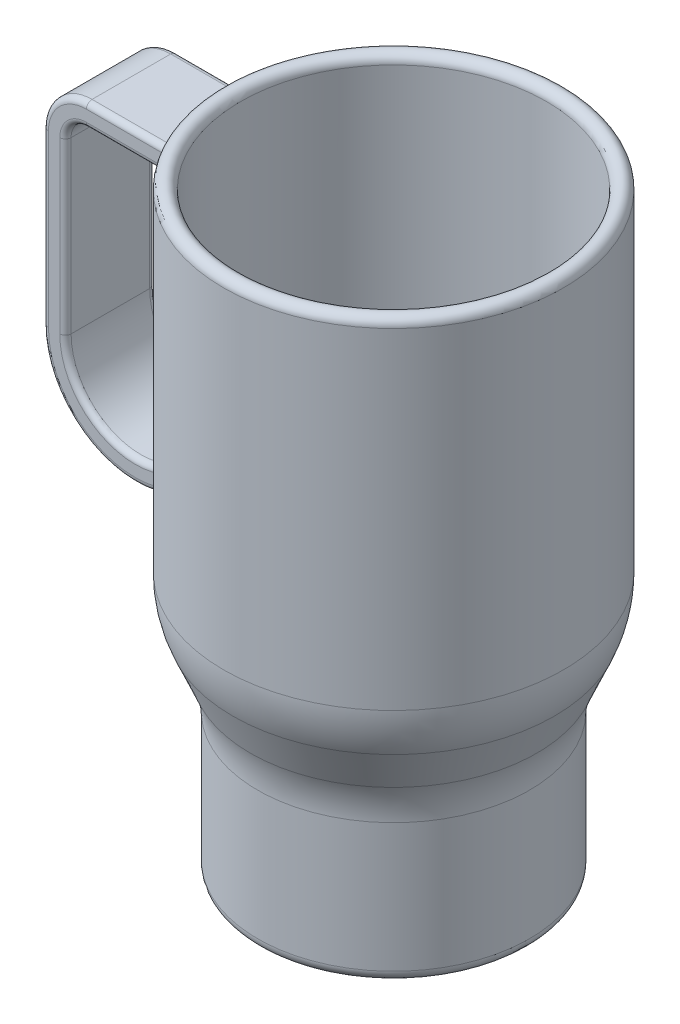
ISO-10303-21;
HEADER;
FILE_DESCRIPTION(('STEP AP214'),'2;1');
FILE_NAME('part.step','',(''),(''),'','','');
FILE_SCHEMA(('AUTOMOTIVE_DESIGN { 1 0 10303 214 1 1 1 1 }'));
ENDSEC;
DATA;
#1=APPLICATION_CONTEXT('core data for automotive mechanical design processes');
#2=APPLICATION_PROTOCOL_DEFINITION('international standard','automotive_design',2000,#1);
#3=PRODUCT_CONTEXT('',#1,'mechanical');
#4=PRODUCT('Part','Part','',(#3));
#5=PRODUCT_RELATED_PRODUCT_CATEGORY('part','',(#4));
#6=PRODUCT_DEFINITION_FORMATION('','',#4);
#7=PRODUCT_DEFINITION_CONTEXT('part definition',#1,'design');
#8=PRODUCT_DEFINITION('design','',#6,#7);
#9=PRODUCT_DEFINITION_SHAPE('','',#8);
#10=(LENGTH_UNIT() NAMED_UNIT(*) SI_UNIT(.MILLI.,.METRE.));
#11=(NAMED_UNIT(*) PLANE_ANGLE_UNIT() SI_UNIT($,.RADIAN.));
#12=(NAMED_UNIT(*) SI_UNIT($,.STERADIAN.) SOLID_ANGLE_UNIT());
#13=UNCERTAINTY_MEASURE_WITH_UNIT(LENGTH_MEASURE(1.E-05),#10,'distance_accuracy_value','');
#14=(GEOMETRIC_REPRESENTATION_CONTEXT(3) GLOBAL_UNCERTAINTY_ASSIGNED_CONTEXT((#13)) GLOBAL_UNIT_ASSIGNED_CONTEXT((#10,
#11,#12)) REPRESENTATION_CONTEXT('',''));
#15=CARTESIAN_POINT('',(0.,0.,0.));
#16=DIRECTION('',(0.,0.,1.));
#17=DIRECTION('',(1.,0.,0.));
#18=AXIS2_PLACEMENT_3D('',#15,#16,#17);
#19=CARTESIAN_POINT('',(0.,0.,0.));
#20=DIRECTION('',(0.,-1.,0.));
#21=DIRECTION('',(0.,0.,-1.));
#22=AXIS2_PLACEMENT_3D('',#19,#20,#21);
#23=CYLINDRICAL_SURFACE('',#22,38.1);
#24=CARTESIAN_POINT('',(0.,58.5535456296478,0.));
#25=DIRECTION('',(0.,1.,0.));
#26=DIRECTION('',(0.,0.,1.));
#27=AXIS2_PLACEMENT_3D('',#24,#25,#26);
#28=CIRCLE('',#27,38.1);
#29=CARTESIAN_POINT('',(0.,58.5535456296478,38.1));
#30=VERTEX_POINT('',#29);
#31=EDGE_CURVE('E458',#30,#30,#28,.T.);
#32=ORIENTED_EDGE('',*,*,#31,.T.);
#33=EDGE_LOOP('',(#32));
#34=FACE_BOUND('',#33,.T.);
#35=DIRECTION('',(0.,-1.,0.));
#36=VECTOR('',#35,1.);
#37=CARTESIAN_POINT('',(-36.7423951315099,0.,10.08));
#38=LINE('',#37,#36);
#39=CARTESIAN_POINT('',(-36.7423951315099,61.4668481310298,10.08));
#40=VERTEX_POINT('',#39);
#41=CARTESIAN_POINT('',(-36.7423951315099,64.6860346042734,10.08));
#42=VERTEX_POINT('',#41);
#43=EDGE_CURVE('E203',#40,#42,#38,.F.);
#44=ORIENTED_EDGE('',*,*,#43,.F.);
#45=CARTESIAN_POINT('',(-36.7423951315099,61.4668481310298,10.08));
#46=CARTESIAN_POINT('',(-36.7423966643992,61.4129107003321,10.0799918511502));
#47=CARTESIAN_POINT('',(-36.7430295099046,61.3590107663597,10.0776879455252));
#48=CARTESIAN_POINT('',(-36.7455135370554,61.2516273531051,10.0686278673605));
#49=CARTESIAN_POINT('',(-36.7473643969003,61.1981437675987,10.0618728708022));
#50=CARTESIAN_POINT('',(-36.754684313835,61.0386516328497,10.0351154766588));
#51=CARTESIAN_POINT('',(-36.7619204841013,60.9337404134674,10.0086213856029));
#52=CARTESIAN_POINT('',(-36.7806824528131,60.7305322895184,9.93945003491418));
#53=CARTESIAN_POINT('',(-36.7921837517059,60.6322013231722,9.89686517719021));
#54=CARTESIAN_POINT('',(-36.8191349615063,60.4444774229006,9.79612234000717));
#55=CARTESIAN_POINT('',(-36.834580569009,60.3550748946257,9.73798132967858));
#56=CARTESIAN_POINT('',(-36.8658657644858,60.203928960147,9.61878406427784));
#57=CARTESIAN_POINT('',(-36.8811194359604,60.1401150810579,9.56019461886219));
#58=CARTESIAN_POINT('',(-36.9137066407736,60.0231835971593,9.43358447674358));
#59=CARTESIAN_POINT('',(-36.9310388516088,59.9700592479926,9.36556977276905));
#60=CARTESIAN_POINT('',(-36.9641508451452,59.8855217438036,9.23392235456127));
#61=CARTESIAN_POINT('',(-36.9796682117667,59.8519338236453,9.17161990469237));
#62=CARTESIAN_POINT('',(-37.0114512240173,59.7958207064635,9.04250222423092));
#63=CARTESIAN_POINT('',(-37.0277144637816,59.7732623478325,8.97570121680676));
#64=CARTESIAN_POINT('',(-37.0518639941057,59.7493810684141,8.87527497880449));
#65=CARTESIAN_POINT('',(-37.059641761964,59.7431340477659,8.84274588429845));
#66=CARTESIAN_POINT('',(-37.0674237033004,59.738393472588,8.81));
#67=B_SPLINE_CURVE_WITH_KNOTS('',3,(#45,#46,#47,#48,#49,#50,#51,#52,#53,#54,#55,#56,#57,#58,#59,
#60,#61,#62,#63,#64,#65,#66),.UNSPECIFIED.,.F.,.F.,(4,2,2,2,2,2,2,2,2,2,4),(0.,
0.161691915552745,0.323341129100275,0.647050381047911,0.968928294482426,1.29045651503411,
1.55332823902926,1.81603358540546,2.03257443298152,2.24846016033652,2.35041663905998),.UNSPECIFIED.);
#68=CARTESIAN_POINT('',(-37.0674237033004,59.738393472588,8.81));
#69=VERTEX_POINT('',#68);
#70=EDGE_CURVE('E12',#40,#69,#67,.T.);
#71=ORIENTED_EDGE('',*,*,#70,.T.);
#72=CARTESIAN_POINT('',(-36.7423951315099,59.9410308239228,10.08));
#73=CARTESIAN_POINT('',(-36.8584088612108,59.8672368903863,9.65717056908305));
#74=CARTESIAN_POINT('',(-36.9673623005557,59.7994939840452,9.23137117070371));
#75=CARTESIAN_POINT('',(-37.1707857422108,59.6752775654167,8.37473586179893));
#76=CARTESIAN_POINT('',(-37.2652570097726,59.6188030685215,7.94390039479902));
#77=CARTESIAN_POINT('',(-37.4393379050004,59.5162992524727,7.07819994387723));
#78=CARTESIAN_POINT('',(-37.5189536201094,59.4702656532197,6.64333668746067));
#79=CARTESIAN_POINT('',(-37.6631197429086,59.3879392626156,5.77019805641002));
#80=CARTESIAN_POINT('',(-37.7276698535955,59.3516466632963,5.33192261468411));
#81=CARTESIAN_POINT('',(-37.8401384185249,59.2890136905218,4.46330407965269));
#82=CARTESIAN_POINT('',(-37.8884193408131,59.2624550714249,4.03302353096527));
#83=CARTESIAN_POINT('',(-37.9703164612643,59.2177000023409,3.17060073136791));
#84=CARTESIAN_POINT('',(-38.0039313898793,59.1995042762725,2.73845832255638));
#85=CARTESIAN_POINT('',(-38.0564027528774,59.1712053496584,1.87300241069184));
#86=CARTESIAN_POINT('',(-38.0752589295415,59.1611022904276,1.43968888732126));
#87=CARTESIAN_POINT('',(-38.0981675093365,59.1488419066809,0.572549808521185));
#88=CARTESIAN_POINT('',(-38.1022189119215,59.146685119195,0.138724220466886));
#89=CARTESIAN_POINT('',(-38.09250753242,59.1518600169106,-1.11449631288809));
#90=CARTESIAN_POINT('',(-38.0597059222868,59.1693315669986,-1.93379925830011));
#91=CARTESIAN_POINT('',(-37.9414617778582,59.2333490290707,-3.5673377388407));
#92=CARTESIAN_POINT('',(-37.8560285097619,59.2798898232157,-4.38157414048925));
#93=CARTESIAN_POINT('',(-37.6877770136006,59.3740906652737,-5.60503077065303));
#94=CARTESIAN_POINT('',(-37.6240526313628,59.4101069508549,-6.01787482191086));
#95=CARTESIAN_POINT('',(-37.4832311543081,59.4909093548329,-6.84042686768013));
#96=CARTESIAN_POINT('',(-37.4061343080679,59.5356953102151,-7.2501349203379));
#97=CARTESIAN_POINT('',(-37.2387503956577,59.6346351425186,-8.06590854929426));
#98=CARTESIAN_POINT('',(-37.1484572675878,59.6887933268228,-8.47197236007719));
#99=CARTESIAN_POINT('',(-36.9550020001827,59.8071806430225,-9.27957192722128));
#100=CARTESIAN_POINT('',(-36.8518388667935,59.8714105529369,-9.68110733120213));
#101=CARTESIAN_POINT('',(-36.7423951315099,59.9410308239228,-10.08));
#102=B_SPLINE_CURVE_WITH_KNOTS('',3,(#72,#73,#74,#75,#76,#77,#78,#79,#80,#81,#82,#83,#84,#85,
#86,#87,#88,#89,#90,#91,#92,#93,#94,#95,#96,#97,#98,#99,#100,#101),.UNSPECIFIED.,.F.,.F.,(4,2,2,
2,2,2,2,2,2,2,2,2,2,2,4),(0.,1.33372956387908,2.66734253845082,4.00040782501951,5.3334993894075,
6.63454856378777,7.93571033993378,9.23689483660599,10.5381672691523,12.996276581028,
15.4539532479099,16.7115364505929,17.9690962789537,19.2272356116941,20.4854721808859),.UNSPECIFIED.);
#103=CARTESIAN_POINT('',(-37.0674237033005,59.738393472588,-8.81));
#104=VERTEX_POINT('',#103);
#105=EDGE_CURVE('E219',#69,#104,#102,.T.);
#106=ORIENTED_EDGE('',*,*,#105,.T.);
#107=CARTESIAN_POINT('',(-37.0674237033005,59.738393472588,-8.81));
#108=CARTESIAN_POINT('',(-37.0503748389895,59.7487583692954,-8.88175676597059));
#109=CARTESIAN_POINT('',(-37.0334034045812,59.7663145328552,-8.95221227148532));
#110=CARTESIAN_POINT('',(-37.0001852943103,59.813698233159,-9.08851238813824));
#111=CARTESIAN_POINT('',(-36.983934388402,59.8434393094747,-9.1543857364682));
#112=CARTESIAN_POINT('',(-36.9525409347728,59.9131385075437,-9.28029941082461));
#113=CARTESIAN_POINT('',(-36.9373941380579,59.9530544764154,-9.34036242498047));
#114=CARTESIAN_POINT('',(-36.9083952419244,60.041440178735,-9.45430146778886));
#115=CARTESIAN_POINT('',(-36.8945456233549,60.0899258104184,-9.50816568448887));
#116=CARTESIAN_POINT('',(-36.866387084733,60.2017771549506,-9.61681461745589));
#117=CARTESIAN_POINT('',(-36.8523301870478,60.2662844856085,-9.67048713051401));
#118=CARTESIAN_POINT('',(-36.826498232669,60.4024973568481,-9.76839768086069));
#119=CARTESIAN_POINT('',(-36.8147243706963,60.4742066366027,-9.81263077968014));
#120=CARTESIAN_POINT('',(-36.7918194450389,60.6360661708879,-9.89819771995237));
#121=CARTESIAN_POINT('',(-36.7811551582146,60.727256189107,-9.93769381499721));
#122=CARTESIAN_POINT('',(-36.7635195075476,60.9147811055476,-10.002738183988));
#123=CARTESIAN_POINT('',(-36.756546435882,61.0111136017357,-10.0282929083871));
#124=CARTESIAN_POINT('',(-36.7485427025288,61.1678564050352,-10.0575710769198));
#125=CARTESIAN_POINT('',(-36.7462521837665,61.2273707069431,-10.0659328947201));
#126=CARTESIAN_POINT('',(-36.7431803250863,61.3468601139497,-10.0771381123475));
#127=CARTESIAN_POINT('',(-36.7423966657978,61.4068343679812,-10.0799899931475));
#128=CARTESIAN_POINT('',(-36.7423951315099,61.4668481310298,-10.08));
#129=B_SPLINE_CURVE_WITH_KNOTS('',3,(#107,#108,#109,#110,#111,#112,#113,#114,#115,#116,#117,
#118,#119,#120,#121,#122,#123,#124,#125,#126,#127,#128),.UNSPECIFIED.,.F.,.F.,(4,2,2,2,2,2,2,2,
2,2,4),(0.,0.22269802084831,0.443842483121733,0.664085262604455,0.884741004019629,
1.13904531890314,1.39348235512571,1.69210894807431,1.99059725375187,2.17077549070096,
2.35067617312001),.UNSPECIFIED.);
#130=CARTESIAN_POINT('',(-36.7423951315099,61.4668481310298,-10.08));
#131=VERTEX_POINT('',#130);
#132=EDGE_CURVE('E269',#104,#131,#129,.T.);
#133=ORIENTED_EDGE('',*,*,#132,.T.);
#134=DIRECTION('',(0.,-1.,0.));
#135=VECTOR('',#134,1.);
#136=CARTESIAN_POINT('',(-36.7423951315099,0.,-10.08));
#137=LINE('',#136,#135);
#138=CARTESIAN_POINT('',(-36.7423951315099,64.6860346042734,-10.08));
#139=VERTEX_POINT('',#138);
#140=EDGE_CURVE('E465',#131,#139,#137,.F.);
#141=ORIENTED_EDGE('',*,*,#140,.T.);
#142=CARTESIAN_POINT('',(-36.7423951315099,64.6860346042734,-10.08));
#143=CARTESIAN_POINT('',(-36.7423962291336,64.7395316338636,-10.0799931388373));
#144=CARTESIAN_POINT('',(-36.7429212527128,64.7930444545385,-10.0780820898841));
#145=CARTESIAN_POINT('',(-36.7450655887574,64.8998456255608,-10.0702625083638));
#146=CARTESIAN_POINT('',(-36.7466867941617,64.9531334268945,-10.0643470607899));
#147=CARTESIAN_POINT('',(-36.7510932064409,65.0595957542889,-10.0482443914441));
#148=CARTESIAN_POINT('',(-36.7538904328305,65.1127632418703,-10.0380130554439));
#149=CARTESIAN_POINT('',(-36.7606993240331,65.2179087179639,-10.013049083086));
#150=CARTESIAN_POINT('',(-36.7647100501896,65.2698875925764,-9.99831992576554));
#151=CARTESIAN_POINT('',(-36.775864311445,65.3926370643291,-9.95723016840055));
#152=CARTESIAN_POINT('',(-36.7836192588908,65.4626092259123,-9.92857364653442));
#153=CARTESIAN_POINT('',(-36.8017342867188,65.5969566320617,-9.86121522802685));
#154=CARTESIAN_POINT('',(-36.8120843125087,65.661352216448,-9.82255208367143));
#155=CARTESIAN_POINT('',(-36.8330762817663,65.7697232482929,-9.74350040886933));
#156=CARTESIAN_POINT('',(-36.843234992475,65.815193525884,-9.70504555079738));
#157=CARTESIAN_POINT('',(-36.8651684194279,65.899078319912,-9.62139401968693));
#158=CARTESIAN_POINT('',(-36.8769428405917,65.9374941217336,-9.57619857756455));
#159=CARTESIAN_POINT('',(-36.9019714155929,66.0055004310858,-9.47929436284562));
#160=CARTESIAN_POINT('',(-36.9152370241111,66.0350151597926,-9.42753471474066));
#161=CARTESIAN_POINT('',(-36.9427031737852,66.0829184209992,-9.31932288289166));
#162=CARTESIAN_POINT('',(-36.9569029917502,66.1013154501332,-9.26287432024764));
#163=CARTESIAN_POINT('',(-36.9836533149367,66.124406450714,-9.15543710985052));
#164=CARTESIAN_POINT('',(-36.996163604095,66.1306311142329,-9.10475839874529));
#165=CARTESIAN_POINT('',(-37.0210402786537,66.1343055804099,-9.00307221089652));
#166=CARTESIAN_POINT('',(-37.0334067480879,66.1317607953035,-8.95206495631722));
#167=CARTESIAN_POINT('',(-37.0492322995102,66.1231967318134,-8.8862050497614));
#168=CARTESIAN_POINT('',(-37.0529095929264,66.120820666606,-8.87085898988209));
#169=CARTESIAN_POINT('',(-37.0602075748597,66.1153550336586,-8.84032006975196));
#170=CARTESIAN_POINT('',(-37.0638283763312,66.1122671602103,-8.82512693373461));
#171=CARTESIAN_POINT('',(-37.0674237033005,66.1088348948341,-8.81));
#172=B_SPLINE_CURVE_WITH_KNOTS('',3,(#142,#143,#144,#145,#146,#147,#148,#149,#150,#151,#152,
#153,#154,#155,#156,#157,#158,#159,#160,#161,#162,#163,#164,#165,#166,#167,#168,#169,#170,#171),
.UNSPECIFIED.,.F.,.F.,(4,2,2,2,2,2,2,2,2,2,2,2,2,2,4),(0.,0.160477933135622,0.321233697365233,
0.483674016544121,0.645989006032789,0.873219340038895,1.09958252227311,1.28012212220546,
1.46062879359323,1.64263142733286,1.82449479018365,1.98147084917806,2.13835004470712,
2.18621508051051,2.23396734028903),.UNSPECIFIED.);
#173=CARTESIAN_POINT('',(-37.0674237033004,66.1088348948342,-8.81000000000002));
#174=VERTEX_POINT('',#173);
#175=EDGE_CURVE('E275',#139,#174,#172,.T.);
#176=ORIENTED_EDGE('',*,*,#175,.T.);
#177=CARTESIAN_POINT('',(-38.1,89.6103420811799,0.));
#178=CARTESIAN_POINT('',(-38.0999992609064,89.610343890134,0.658481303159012));
#179=CARTESIAN_POINT('',(-38.0829152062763,89.5967388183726,1.31697976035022));
#180=CARTESIAN_POINT('',(-38.0147293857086,89.5417402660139,2.63124611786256));
#181=CARTESIAN_POINT('',(-37.9636178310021,89.500338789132,3.28701317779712));
#182=CARTESIAN_POINT('',(-37.8277825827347,89.3879100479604,4.59357209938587));
#183=CARTESIAN_POINT('',(-37.7430064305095,89.3168365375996,5.2443545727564));
#184=CARTESIAN_POINT('',(-37.5408228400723,89.1421154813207,6.53635213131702));
#185=CARTESIAN_POINT('',(-37.4234221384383,89.0384746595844,7.1775691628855));
#186=CARTESIAN_POINT('',(-37.1779073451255,88.8130234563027,8.34954884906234));
#187=CARTESIAN_POINT('',(-37.054166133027,88.696403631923,8.88222739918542));
#188=CARTESIAN_POINT('',(-36.7858811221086,88.4333869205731,9.9349833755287));
#189=CARTESIAN_POINT('',(-36.6413356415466,88.286987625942,10.455059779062));
#190=CARTESIAN_POINT('',(-36.3338317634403,87.9606920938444,11.4781329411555));
#191=CARTESIAN_POINT('',(-36.1709021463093,87.7808479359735,11.9811548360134));
#192=CARTESIAN_POINT('',(-35.8295196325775,87.3829634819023,12.9663753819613));
#193=CARTESIAN_POINT('',(-35.6510730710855,87.1649387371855,13.4485824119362));
#194=CARTESIAN_POINT('',(-35.3404282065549,86.7604795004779,14.2402452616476));
#195=CARTESIAN_POINT('',(-35.211163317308,86.5853996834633,14.5566749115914));
#196=CARTESIAN_POINT('',(-34.94923342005,86.2131602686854,15.1747685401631));
#197=CARTESIAN_POINT('',(-34.816569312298,86.0160064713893,15.4764363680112));
#198=CARTESIAN_POINT('',(-34.5502406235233,85.5982392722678,16.0622015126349));
#199=CARTESIAN_POINT('',(-34.4165770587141,85.3776473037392,16.3463145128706));
#200=CARTESIAN_POINT('',(-34.1509532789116,84.9115854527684,16.8942297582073));
#201=CARTESIAN_POINT('',(-34.0189926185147,84.6661222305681,17.1580374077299));
#202=CARTESIAN_POINT('',(-33.7901211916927,84.2093907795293,17.603555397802));
#203=CARTESIAN_POINT('',(-33.6921729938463,84.0033752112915,17.7901262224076));
#204=CARTESIAN_POINT('',(-33.5009924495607,83.5761279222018,18.1475770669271));
#205=CARTESIAN_POINT('',(-33.407758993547,83.3548998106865,18.3184607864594));
#206=CARTESIAN_POINT('',(-33.2279304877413,82.8976198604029,18.642665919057));
#207=CARTESIAN_POINT('',(-33.1413305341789,82.6615792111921,18.7960003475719));
#208=CARTESIAN_POINT('',(-32.9766701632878,82.1752059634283,19.0834133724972));
#209=CARTESIAN_POINT('',(-32.8986084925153,81.9248754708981,19.2174947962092));
#210=CARTESIAN_POINT('',(-32.7641606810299,81.4504395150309,19.4456817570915));
#211=CARTESIAN_POINT('',(-32.7062856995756,81.2281854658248,19.5427648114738));
#212=CARTESIAN_POINT('',(-32.5992505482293,80.7752892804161,19.7207925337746));
#213=CARTESIAN_POINT('',(-32.5500888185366,80.5446486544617,19.8017400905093));
#214=CARTESIAN_POINT('',(-32.4615448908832,80.0762766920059,19.9465615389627));
#215=CARTESIAN_POINT('',(-32.4221606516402,79.8385468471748,20.0104389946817));
#216=CARTESIAN_POINT('',(-32.3540633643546,79.3574804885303,20.1203571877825));
#217=CARTESIAN_POINT('',(-32.3253504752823,79.1141438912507,20.1663976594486));
#218=CARTESIAN_POINT('',(-32.2792080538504,78.6227535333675,20.2401738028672));
#219=CARTESIAN_POINT('',(-32.2618189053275,78.3746861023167,20.2678439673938));
#220=CARTESIAN_POINT('',(-32.2389228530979,77.8766138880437,20.3042438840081));
#221=CARTESIAN_POINT('',(-32.2334159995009,77.6266090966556,20.3129735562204));
#222=CARTESIAN_POINT('',(-32.2344246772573,77.1267022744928,20.3113728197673));
#223=CARTESIAN_POINT('',(-32.2409394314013,76.8768002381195,20.3010436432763));
#224=CARTESIAN_POINT('',(-32.2658245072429,76.379104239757,20.2614686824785));
#225=CARTESIAN_POINT('',(-32.2841944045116,76.1313102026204,20.2322235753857));
#226=CARTESIAN_POINT('',(-32.3309024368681,75.6543012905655,20.1574937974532));
#227=CARTESIAN_POINT('',(-32.3585868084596,75.4248543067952,20.113071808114));
#228=CARTESIAN_POINT('',(-32.4234435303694,74.9710012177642,20.008350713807));
#229=CARTESIAN_POINT('',(-32.4606154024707,74.7465948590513,19.9480524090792));
#230=CARTESIAN_POINT('',(-32.5436792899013,74.3041425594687,19.8122503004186));
#231=CARTESIAN_POINT('',(-32.5895698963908,74.0860955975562,19.7367489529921));
#232=CARTESIAN_POINT('',(-32.6892031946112,73.657333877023,19.5712881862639));
#233=CARTESIAN_POINT('',(-32.7429488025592,73.4466218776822,19.481323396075));
#234=CARTESIAN_POINT('',(-32.8608767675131,73.0205997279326,19.2817791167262));
#235=CARTESIAN_POINT('',(-32.9255006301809,72.8058203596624,19.1713270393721));
#236=CARTESIAN_POINT('',(-33.0612985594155,72.386328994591,18.9361831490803));
#237=CARTESIAN_POINT('',(-33.132475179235,72.1816209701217,18.8114857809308));
#238=CARTESIAN_POINT('',(-33.3540170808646,71.5834296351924,18.4176505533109));
#239=CARTESIAN_POINT('',(-33.5124389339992,71.2057234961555,18.1286955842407));
#240=CARTESIAN_POINT('',(-33.8029843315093,70.5773886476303,17.57957088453));
#241=CARTESIAN_POINT('',(-33.9326679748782,70.3176221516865,17.3283073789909));
#242=CARTESIAN_POINT('',(-34.1955871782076,69.8233791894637,16.8035084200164));
#243=CARTESIAN_POINT('',(-34.3288242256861,69.5889135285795,16.5299635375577));
#244=CARTESIAN_POINT('',(-34.5959145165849,69.1439840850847,15.9634264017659));
#245=CARTESIAN_POINT('',(-34.7297684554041,68.9335681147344,15.6703971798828));
#246=CARTESIAN_POINT('',(-34.9952465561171,68.5358105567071,15.068215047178));
#247=CARTESIAN_POINT('',(-35.1268707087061,68.3484690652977,14.7590620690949));
#248=CARTESIAN_POINT('',(-35.4469097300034,67.9118061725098,13.9777993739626));
#249=CARTESIAN_POINT('',(-35.6328033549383,67.6749715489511,13.4976535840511));
#250=CARTESIAN_POINT('',(-35.9900606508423,67.2424198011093,12.5139851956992));
#251=CARTESIAN_POINT('',(-36.1614174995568,67.046721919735,12.010451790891));
#252=CARTESIAN_POINT('',(-36.486174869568,66.6913024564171,10.984489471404));
#253=CARTESIAN_POINT('',(-36.6395503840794,66.5316306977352,10.4620355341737));
#254=CARTESIAN_POINT('',(-36.9255422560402,66.2442092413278,9.40293727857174));
#255=CARTESIAN_POINT('',(-37.0581591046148,66.1164587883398,8.86629329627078));
#256=CARTESIAN_POINT('',(-37.2639894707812,65.9237596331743,7.94699338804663));
#257=CARTESIAN_POINT('',(-37.3430053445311,65.8515256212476,7.56712232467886));
#258=CARTESIAN_POINT('',(-37.4897401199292,65.7196996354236,6.80299271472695));
#259=CARTESIAN_POINT('',(-37.5574581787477,65.6601086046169,6.41873384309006));
#260=CARTESIAN_POINT('',(-37.6812758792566,65.5526925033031,5.64662555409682));
#261=CARTESIAN_POINT('',(-37.7373725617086,65.5048704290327,5.258775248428));
#262=CARTESIAN_POINT('',(-37.8376916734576,65.4202996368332,4.48030406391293));
#263=CARTESIAN_POINT('',(-37.8819128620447,65.3835520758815,4.08968289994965));
#264=CARTESIAN_POINT('',(-37.9583420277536,65.3205521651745,3.30597382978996));
#265=CARTESIAN_POINT('',(-37.9905361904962,65.2943118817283,2.91288361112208));
#266=CARTESIAN_POINT('',(-38.0427239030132,65.2519888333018,2.12530649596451));
#267=CARTESIAN_POINT('',(-38.062716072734,65.2359072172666,1.73081944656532));
#268=CARTESIAN_POINT('',(-38.090421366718,65.2136643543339,0.941194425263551));
#269=CARTESIAN_POINT('',(-38.0981362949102,65.2075016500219,0.546056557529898));
#270=CARTESIAN_POINT('',(-38.1012660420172,65.2049987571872,-0.244256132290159));
#271=CARTESIAN_POINT('',(-38.0966821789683,65.2086575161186,-0.639430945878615));
#272=CARTESIAN_POINT('',(-38.0750735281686,65.2259782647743,-1.43509714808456));
#273=CARTESIAN_POINT('',(-38.0578650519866,65.239787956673,-1.83558036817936));
#274=CARTESIAN_POINT('',(-38.0108632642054,65.2777917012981,-2.63527775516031));
#275=CARTESIAN_POINT('',(-37.981071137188,65.3019847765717,-3.03449203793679));
#276=CARTESIAN_POINT('',(-37.9090035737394,65.3611397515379,-3.83111502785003));
#277=CARTESIAN_POINT('',(-37.8667244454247,65.3961048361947,-4.22852316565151));
#278=CARTESIAN_POINT('',(-37.769856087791,65.4773410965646,-5.02067600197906));
#279=CARTESIAN_POINT('',(-37.7152669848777,65.5236121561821,-5.41542072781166));
#280=CARTESIAN_POINT('',(-37.5941394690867,65.6280627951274,-6.20065865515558));
#281=CARTESIAN_POINT('',(-37.5276255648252,65.6862179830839,-6.59115886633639));
#282=CARTESIAN_POINT('',(-37.3828915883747,65.8153729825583,-7.36786759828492));
#283=CARTESIAN_POINT('',(-37.3046710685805,65.886373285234,-7.75407595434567));
#284=CARTESIAN_POINT('',(-37.1369959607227,66.0422267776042,-8.52100346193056));
#285=CARTESIAN_POINT('',(-37.0475476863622,66.1270721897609,-8.90172556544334));
#286=CARTESIAN_POINT('',(-36.8579552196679,66.3118600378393,-9.65673989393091));
#287=CARTESIAN_POINT('',(-36.7578125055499,66.4118003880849,-10.0310329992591));
#288=CARTESIAN_POINT('',(-36.5296007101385,66.6466523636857,-10.8351920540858));
#289=CARTESIAN_POINT('',(-36.3996815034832,66.7846213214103,-11.2636506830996));
#290=CARTESIAN_POINT('',(-36.1276937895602,67.0857269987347,-12.1076957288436));
#291=CARTESIAN_POINT('',(-35.98562612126,67.248861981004,-12.5232830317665));
#292=CARTESIAN_POINT('',(-35.6915654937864,67.6029338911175,-13.3382753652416));
#293=CARTESIAN_POINT('',(-35.5395837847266,67.7938395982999,-13.737697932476));
#294=CARTESIAN_POINT('',(-35.2283140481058,68.2065494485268,-14.5172951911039));
#295=CARTESIAN_POINT('',(-35.0690279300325,68.4283455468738,-14.8974748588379));
#296=CARTESIAN_POINT('',(-34.786345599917,68.8471468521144,-15.5438855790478));
#297=CARTESIAN_POINT('',(-34.6637363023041,69.0368751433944,-15.8151814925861));
#298=CARTESIAN_POINT('',(-34.4183934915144,69.4367089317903,-16.3422335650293));
#299=CARTESIAN_POINT('',(-34.295660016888,69.6468093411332,-16.5979935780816));
#300=CARTESIAN_POINT('',(-34.0524794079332,70.0881077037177,-17.0913495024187));
#301=CARTESIAN_POINT('',(-33.9320301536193,70.3192848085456,-17.3289629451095));
#302=CARTESIAN_POINT('',(-33.6960049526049,70.8034167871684,-17.7835543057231));
#303=CARTESIAN_POINT('',(-33.5804277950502,71.0563662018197,-18.000537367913));
#304=CARTESIAN_POINT('',(-33.3819092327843,71.5255650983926,-18.3654915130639));
#305=CARTESIAN_POINT('',(-33.2974058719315,71.737548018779,-18.5181083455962));
#306=CARTESIAN_POINT('',(-33.1347677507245,72.1743119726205,-18.8075705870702));
#307=CARTESIAN_POINT('',(-33.0566314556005,72.3990898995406,-18.9444198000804));
#308=CARTESIAN_POINT('',(-32.9083326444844,72.8607705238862,-19.2008749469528));
#309=CARTESIAN_POINT('',(-32.8381688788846,73.0976713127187,-19.3204835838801));
#310=CARTESIAN_POINT('',(-32.7074024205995,73.5825813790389,-19.5410408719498));
#311=CARTESIAN_POINT('',(-32.6467998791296,73.8305908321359,-19.6419892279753));
#312=CARTESIAN_POINT('',(-32.5362474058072,74.3382153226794,-19.8245833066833));
#313=CARTESIAN_POINT('',(-32.4863836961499,74.59790542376,-19.9060733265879));
#314=CARTESIAN_POINT('',(-32.3992771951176,75.1251759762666,-20.0475374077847));
#315=CARTESIAN_POINT('',(-32.362034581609,75.3927565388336,-20.1075111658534));
#316=CARTESIAN_POINT('',(-32.301271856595,75.9333874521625,-20.2049782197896));
#317=CARTESIAN_POINT('',(-32.2777448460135,76.2064349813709,-20.2424828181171));
#318=CARTESIAN_POINT('',(-32.2451028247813,76.7555570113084,-20.2944402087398));
#319=CARTESIAN_POINT('',(-32.2359860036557,77.0316311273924,-20.3088958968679));
#320=CARTESIAN_POINT('',(-32.2326561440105,77.5497111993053,-20.3141786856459));
#321=CARTESIAN_POINT('',(-32.2367305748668,77.7916840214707,-20.3077208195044));
#322=CARTESIAN_POINT('',(-32.2560327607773,78.2740352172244,-20.277048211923));
#323=CARTESIAN_POINT('',(-32.271259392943,78.5144137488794,-20.2528352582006));
#324=CARTESIAN_POINT('',(-32.3125040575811,78.99177697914,-20.1869656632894));
#325=CARTESIAN_POINT('',(-32.3385202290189,79.2287622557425,-20.145312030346));
#326=CARTESIAN_POINT('',(-32.4007490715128,79.6977560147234,-20.0450725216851));
#327=CARTESIAN_POINT('',(-32.43696204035,79.9297643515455,-19.9864861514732));
#328=CARTESIAN_POINT('',(-32.5181228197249,80.3836161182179,-19.8541583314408));
#329=CARTESIAN_POINT('',(-32.5629187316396,80.6055635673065,-19.7806793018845));
#330=CARTESIAN_POINT('',(-32.6607282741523,81.0421490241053,-19.6187606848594));
#331=CARTESIAN_POINT('',(-32.7137450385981,81.25678420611,-19.530315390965));
#332=CARTESIAN_POINT('',(-32.8269901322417,81.6777152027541,-19.3393647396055));
#333=CARTESIAN_POINT('',(-32.8872183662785,81.8840111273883,-19.2368595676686));
#334=CARTESIAN_POINT('',(-33.0138496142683,82.2875842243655,-19.0187183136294));
#335=CARTESIAN_POINT('',(-33.0802538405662,82.484859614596,-18.9030796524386));
#336=CARTESIAN_POINT('',(-33.2450158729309,82.9447776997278,-18.6122709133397));
#337=CARTESIAN_POINT('',(-33.3457573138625,83.2030055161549,-18.4314385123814));
#338=CARTESIAN_POINT('',(-33.554378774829,83.7003745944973,-18.0488546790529));
#339=CARTESIAN_POINT('',(-33.6622609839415,83.9395099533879,-17.8470968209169));
#340=CARTESIAN_POINT('',(-33.8827487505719,84.3988704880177,-17.4248702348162));
#341=CARTESIAN_POINT('',(-33.9953602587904,84.6190707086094,-17.2043775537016));
#342=CARTESIAN_POINT('',(-34.2229201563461,85.0406310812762,-16.7471499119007));
#343=CARTESIAN_POINT('',(-34.3378692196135,85.241985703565,-16.5104102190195));
#344=CARTESIAN_POINT('',(-34.6158135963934,85.7062076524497,-15.9217026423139));
#345=CARTESIAN_POINT('',(-34.7789816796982,85.9599928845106,-15.5626349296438));
#346=CARTESIAN_POINT('',(-35.1013561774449,86.4338265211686,-14.8212157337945));
#347=CARTESIAN_POINT('',(-35.2605609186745,86.653860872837,-14.4388546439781));
#348=CARTESIAN_POINT('',(-35.5716987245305,87.0634910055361,-13.6544006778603));
#349=CARTESIAN_POINT('',(-35.7236174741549,87.2530284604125,-13.2522718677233));
#350=CARTESIAN_POINT('',(-36.017136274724,87.604168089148,-12.4324366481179));
#351=CARTESIAN_POINT('',(-36.1587365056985,87.7657707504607,-12.0147305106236));
#352=CARTESIAN_POINT('',(-36.3945240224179,88.0252741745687,-11.2764174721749));
#353=CARTESIAN_POINT('',(-36.4914972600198,88.1288368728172,-10.9586604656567));
#354=CARTESIAN_POINT('',(-36.6780445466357,88.323235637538,-10.3171039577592));
#355=CARTESIAN_POINT('',(-36.7676178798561,88.4140704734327,-9.99330387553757));
#356=CARTESIAN_POINT('',(-36.9388702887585,88.5839925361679,-9.34043869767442));
#357=CARTESIAN_POINT('',(-37.020546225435,88.6630750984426,-9.01137156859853));
#358=CARTESIAN_POINT('',(-37.1755647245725,88.8103077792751,-8.34884501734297));
#359=CARTESIAN_POINT('',(-37.2489063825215,88.8784567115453,-8.01538512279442));
#360=CARTESIAN_POINT('',(-37.4558163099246,89.0675664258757,-7.00995323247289));
#361=CARTESIAN_POINT('',(-37.5764185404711,89.173334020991,-6.33236318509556));
#362=CARTESIAN_POINT('',(-37.7810772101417,89.3490805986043,-4.9675409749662));
#363=CARTESIAN_POINT('',(-37.8651492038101,89.4190748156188,-4.28031304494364));
#364=CARTESIAN_POINT('',(-37.9868488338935,89.5192060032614,-2.99453515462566));
#365=CARTESIAN_POINT('',(-38.0292654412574,89.5534932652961,-2.39675212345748));
#366=CARTESIAN_POINT('',(-38.0858335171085,89.5990540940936,-1.19931665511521));
#367=CARTESIAN_POINT('',(-38.1000006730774,89.6103404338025,-0.599665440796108));
#368=CARTESIAN_POINT('',(-38.1,89.6103420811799,0.));
#369=B_SPLINE_CURVE_WITH_KNOTS('',3,(#177,#178,#179,#180,#181,#182,#183,#184,#185,#186,#187,
#188,#189,#190,#191,#192,#193,#194,#195,#196,#197,#198,#199,#200,#201,#202,#203,#204,#205,#206,
#207,#208,#209,#210,#211,#212,#213,#214,#215,#216,#217,#218,#219,#220,#221,#222,#223,#224,#225,
#226,#227,#228,#229,#230,#231,#232,#233,#234,#235,#236,#237,#238,#239,#240,#241,#242,#243,#244,
#245,#246,#247,#248,#249,#250,#251,#252,#253,#254,#255,#256,#257,#258,#259,#260,#261,#262,#263,
#264,#265,#266,#267,#268,#269,#270,#271,#272,#273,#274,#275,#276,#277,#278,#279,#280,#281,#282,
#283,#284,#285,#286,#287,#288,#289,#290,#291,#292,#293,#294,#295,#296,#297,#298,#299,#300,#301,
#302,#303,#304,#305,#306,#307,#308,#309,#310,#311,#312,#313,#314,#315,#316,#317,#318,#319,#320,
#321,#322,#323,#324,#325,#326,#327,#328,#329,#330,#331,#332,#333,#334,#335,#336,#337,#338,#339,
#340,#341,#342,#343,#344,#345,#346,#347,#348,#349,#350,#351,#352,#353,#354,#355,#356,#357,#358,
#359,#360,#361,#362,#363,#364,#365,#366,#367,#368),.UNSPECIFIED.,.T.,.F.,(4,2,2,2,2,2,2,2,2,2,2,
2,2,2,2,2,2,2,2,2,2,2,2,2,2,2,2,2,2,2,2,2,2,2,2,2,2,2,2,2,2,2,2,2,2,2,2,2,2,2,2,2,2,2,2,2,2,2,2,
2,2,2,2,2,2,2,2,2,2,2,2,2,2,2,2,2,2,2,2,2,2,2,2,2,2,2,2,2,2,2,2,2,2,2,2,4),(0.,1.97510920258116,
3.95078683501,5.92955527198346,7.90791542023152,9.58420212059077,11.2606244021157,
12.934457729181,14.6076108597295,15.7589415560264,16.9099704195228,18.0599556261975,
19.209633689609,20.092960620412,20.976078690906,21.8585374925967,22.7408665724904,
23.4881317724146,24.2352630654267,24.9822382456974,25.7292245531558,26.478860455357,
27.228499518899,27.9780901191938,28.7276538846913,29.432888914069,30.1380884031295,
30.8431740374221,31.5485221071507,32.2977942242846,33.0473595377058,34.5459613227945,
35.6964368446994,36.8474017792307,38.0006165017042,39.1538360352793,40.851421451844,
42.5497992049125,44.2505115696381,45.9511836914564,47.1348244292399,48.3185534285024,
49.5025834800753,50.6867371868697,51.8722468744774,53.057890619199,54.2433601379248,
55.4287026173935,56.6316427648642,57.8344696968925,59.0376526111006,60.2408231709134,
61.4415486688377,62.6423200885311,63.8424192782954,65.0423528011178,66.4469032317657,
67.851356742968,69.2542433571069,70.6567653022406,71.7150452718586,72.7730616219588,
73.8300425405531,74.8867592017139,75.7096189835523,76.5322798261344,77.3548115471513,
78.1773562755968,79.0062774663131,79.8352103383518,80.6637258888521,81.492137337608,
82.2175215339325,82.942832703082,83.6680188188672,84.3932261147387,85.1066198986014,
85.8202863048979,86.533943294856,87.2477406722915,88.2391310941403,89.2308268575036,
90.2238101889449,91.2170839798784,92.6219219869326,94.0273433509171,95.4354214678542,
96.8434750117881,97.887097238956,98.9308202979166,99.9749565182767,101.019205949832,
103.105902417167,105.191709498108,106.991400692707,108.790092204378),.UNSPECIFIED.);
#370=CARTESIAN_POINT('',(-37.0674237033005,66.1088348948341,8.81));
#371=VERTEX_POINT('',#370);
#372=EDGE_CURVE('E297',#371,#174,#369,.T.);
#373=ORIENTED_EDGE('',*,*,#372,.F.);
#374=CARTESIAN_POINT('',(-37.0674237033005,66.1088348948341,8.81));
#375=CARTESIAN_POINT('',(-37.0614058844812,66.1145818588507,8.83531989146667));
#376=CARTESIAN_POINT('',(-37.0553137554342,66.1193603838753,8.86083620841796));
#377=CARTESIAN_POINT('',(-37.04300449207,66.126863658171,8.91215546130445));
#378=CARTESIAN_POINT('',(-37.0367872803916,66.1295870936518,8.93795856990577));
#379=CARTESIAN_POINT('',(-37.0179978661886,66.1344892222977,9.01557846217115));
#380=CARTESIAN_POINT('',(-37.005285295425,66.1334022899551,9.06761671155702));
#381=CARTESIAN_POINT('',(-36.9798322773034,66.121940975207,9.17086945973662));
#382=CARTESIAN_POINT('',(-36.967091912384,66.1115306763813,9.22207999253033));
#383=CARTESIAN_POINT('',(-36.9420750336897,66.0815630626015,9.32178803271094));
#384=CARTESIAN_POINT('',(-36.9297978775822,66.0620189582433,9.37028934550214));
#385=CARTESIAN_POINT('',(-36.9065754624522,66.0156545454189,9.46133233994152));
#386=CARTESIAN_POINT('',(-36.8955960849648,65.9891695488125,9.50403774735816));
#387=CARTESIAN_POINT('',(-36.8746467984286,65.9297534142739,9.58499745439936));
#388=CARTESIAN_POINT('',(-36.8646779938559,65.8968153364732,9.62324689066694));
#389=CARTESIAN_POINT('',(-36.8426405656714,65.8133923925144,9.70733409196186));
#390=CARTESIAN_POINT('',(-36.8310453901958,65.7607867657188,9.75119253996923));
#391=CARTESIAN_POINT('',(-36.8100829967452,65.6489150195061,9.83002830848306));
#392=CARTESIAN_POINT('',(-36.8007196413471,65.5896376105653,9.86499023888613));
#393=CARTESIAN_POINT('',(-36.7813480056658,65.4454808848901,9.93701597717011));
#394=CARTESIAN_POINT('',(-36.7722206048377,65.3587953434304,9.97068560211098));
#395=CARTESIAN_POINT('',(-36.7576653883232,65.1809727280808,10.0242103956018));
#396=CARTESIAN_POINT('',(-36.752242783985,65.0898295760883,10.0440461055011));
#397=CARTESIAN_POINT('',(-36.746458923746,64.9460647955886,10.0651781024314));
#398=CARTESIAN_POINT('',(-36.744920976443,64.8940713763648,10.0707897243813));
#399=CARTESIAN_POINT('',(-36.7428924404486,64.7900640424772,10.0781874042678));
#400=CARTESIAN_POINT('',(-36.7423964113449,64.7380516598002,10.0799933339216));
#401=CARTESIAN_POINT('',(-36.7423951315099,64.6860346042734,10.08));
#402=B_SPLINE_CURVE_WITH_KNOTS('',3,(#374,#375,#376,#377,#378,#379,#380,#381,#382,#383,#384,
#385,#386,#387,#388,#389,#390,#391,#392,#393,#394,#395,#396,#397,#398,#399,#400,#401),
.UNSPECIFIED.,.F.,.F.,(4,2,2,2,2,2,2,2,2,2,2,2,2,4),(0.,0.0799229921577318,0.159897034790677,
0.319811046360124,0.480343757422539,0.64064499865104,0.794299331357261,0.948119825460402,
1.15537190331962,1.3629801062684,1.64181585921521,1.92104303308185,2.07786492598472,
2.23386591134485),.UNSPECIFIED.);
#403=EDGE_CURVE('E50',#371,#42,#402,.T.);
#404=ORIENTED_EDGE('',*,*,#403,.T.);
#405=EDGE_LOOP('',(#44,#71,#106,#133,#141,#176,#373,#404));
#406=FACE_BOUND('',#405,.T.);
#407=CARTESIAN_POINT('',(0.,132.715,0.));
#408=DIRECTION('',(0.,-1.,0.));
#409=DIRECTION('',(0.,0.,-1.));
#410=AXIS2_PLACEMENT_3D('',#407,#408,#409);
#411=CIRCLE('',#410,38.1);
#412=CARTESIAN_POINT('',(0.,132.715,-38.1));
#413=VERTEX_POINT('',#412);
#414=EDGE_CURVE('E1121',#413,#413,#411,.T.);
#415=ORIENTED_EDGE('',*,*,#414,.T.);
#416=EDGE_LOOP('',(#415));
#417=FACE_BOUND('',#416,.T.);
#418=CARTESIAN_POINT('',(-37.3151177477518,119.084178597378,-7.69363291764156));
#419=CARTESIAN_POINT('',(-37.2238443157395,120.366873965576,-8.1363209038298));
#420=CARTESIAN_POINT('',(-38.5589550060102,120.279183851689,-8.38004367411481));
#421=CARTESIAN_POINT('',(-37.3013263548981,119.059308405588,-7.76052781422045));
#422=CARTESIAN_POINT('',(-37.2171267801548,120.34865828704,-8.16489570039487));
#423=CARTESIAN_POINT('',(-38.5447038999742,120.266748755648,-8.41460603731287));
#424=CARTESIAN_POINT('',(-37.2871516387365,119.037477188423,-7.8283613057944));
#425=CARTESIAN_POINT('',(-37.2101993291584,120.33139014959,-8.19455402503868));
#426=CARTESIAN_POINT('',(-38.5300566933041,120.255833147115,-8.44965334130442));
#427=CARTESIAN_POINT('',(-37.2581066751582,118.999984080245,-7.96544959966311));
#428=CARTESIAN_POINT('',(-37.1959489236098,120.299124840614,-8.25585962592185));
#429=CARTESIAN_POINT('',(-38.5000435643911,120.237086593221,-8.52048229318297));
#430=CARTESIAN_POINT('',(-37.2432365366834,118.984321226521,-8.03470417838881));
#431=CARTESIAN_POINT('',(-37.1886309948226,120.28412087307,-8.28748363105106));
#432=CARTESIAN_POINT('',(-38.4846777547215,120.229255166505,-8.55626382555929));
#433=CARTESIAN_POINT('',(-37.1977437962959,118.946762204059,-8.24366842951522));
#434=CARTESIAN_POINT('',(-37.1661755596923,120.243065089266,-8.38482592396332));
#435=CARTESIAN_POINT('',(-38.4376685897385,120.210475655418,-8.66422868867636));
#436=CARTESIAN_POINT('',(-37.1661830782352,118.934195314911,-8.38485010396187));
#437=CARTESIAN_POINT('',(-37.1504066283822,120.220590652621,-8.45356847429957));
#438=CARTESIAN_POINT('',(-38.4050558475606,120.204192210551,-8.73717255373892));
#439=CARTESIAN_POINT('',(-37.101188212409,118.934182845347,-8.66793745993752));
#440=CARTESIAN_POINT('',(-37.1173102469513,120.187862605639,-8.59771389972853));
#441=CARTESIAN_POINT('',(-38.3378944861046,120.204185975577,-8.88343435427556));
#442=CARTESIAN_POINT('',(-37.0677406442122,118.946947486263,-8.80983937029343));
#443=CARTESIAN_POINT('',(-37.1000040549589,120.177567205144,-8.67302477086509));
#444=CARTESIAN_POINT('',(-38.3033319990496,120.21056829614,-8.95675034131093));
#445=CARTESIAN_POINT('',(-37.0002125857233,118.997486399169,-9.08927525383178));
#446=CARTESIAN_POINT('',(-37.0642759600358,120.171506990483,-8.82743785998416));
#447=CARTESIAN_POINT('',(-38.233553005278,120.23583775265,-9.10112554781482));
#448=CARTESIAN_POINT('',(-36.9661320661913,119.035261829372,-9.22680902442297));
#449=CARTESIAN_POINT('',(-37.0458778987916,120.175551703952,-8.90645065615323));
#450=CARTESIAN_POINT('',(-38.1983364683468,120.254725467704,-9.17218466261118));
#451=CARTESIAN_POINT('',(-36.8984998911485,119.134776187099,-9.49366494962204));
#452=CARTESIAN_POINT('',(-37.0085377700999,120.199580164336,-9.06512521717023));
#453=CARTESIAN_POINT('',(-38.128449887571,120.304482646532,-9.31006022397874));
#454=CARTESIAN_POINT('',(-36.8649483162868,119.196518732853,-9.62298586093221));
#455=CARTESIAN_POINT('',(-36.9896020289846,120.219355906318,-9.14478185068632));
#456=CARTESIAN_POINT('',(-38.0937799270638,120.335353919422,-9.37687602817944));
#457=CARTESIAN_POINT('',(-36.7996589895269,119.342372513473,-9.86972124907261));
#458=CARTESIAN_POINT('',(-36.9519938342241,120.275432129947,-9.30107103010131));
#459=CARTESIAN_POINT('',(-38.0263142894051,120.408280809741,-9.50435597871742));
#460=CARTESIAN_POINT('',(-36.7679210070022,119.426480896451,-9.98713724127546));
#461=CARTESIAN_POINT('',(-36.9333066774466,120.311538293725,-9.37778934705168));
#462=CARTESIAN_POINT('',(-37.9935183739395,120.450335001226,-9.5650209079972));
#463=CARTESIAN_POINT('',(-36.7077584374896,119.614465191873,-10.2060430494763));
#464=CARTESIAN_POINT('',(-36.8972757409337,120.399671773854,-9.52393965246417));
#465=CARTESIAN_POINT('',(-37.931350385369,120.544327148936,-9.67812224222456));
#466=CARTESIAN_POINT('',(-36.6793181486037,119.71824065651,-10.3076092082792));
#467=CARTESIAN_POINT('',(-36.8798915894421,120.451483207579,-9.5935654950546));
#468=CARTESIAN_POINT('',(-37.901962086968,120.596214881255,-9.73059809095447));
#469=CARTESIAN_POINT('',(-36.6269179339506,119.943116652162,-10.4922886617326));
#470=CARTESIAN_POINT('',(-36.8474514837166,120.569667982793,-9.72213031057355));
#471=CARTESIAN_POINT('',(-37.8478151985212,120.708652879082,-9.82601580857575));
#472=CARTESIAN_POINT('',(-36.6029575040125,120.064215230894,-10.5754040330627));
#473=CARTESIAN_POINT('',(-36.8323449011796,120.635994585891,-9.78128457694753));
#474=CARTESIAN_POINT('',(-37.823056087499,120.769202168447,-9.86895875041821));
#475=CARTESIAN_POINT('',(-36.561415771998,120.316486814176,-10.7181275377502));
#476=CARTESIAN_POINT('',(-36.8059337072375,120.778567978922,-9.88386629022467));
#477=CARTESIAN_POINT('',(-37.7801296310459,120.895337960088,-9.94269922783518));
#478=CARTESIAN_POINT('',(-36.5436647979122,120.447249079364,-10.7783655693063));
#479=CARTESIAN_POINT('',(-36.7944800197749,120.854497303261,-9.92790813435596));
#480=CARTESIAN_POINT('',(-37.761786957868,120.960719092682,-9.97382221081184));
#481=CARTESIAN_POINT('',(-36.5145475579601,120.718081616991,-10.8766016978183));
#482=CARTESIAN_POINT('',(-36.7756205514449,121.014544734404,-10.0000586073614));
#483=CARTESIAN_POINT('',(-37.7316991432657,121.096135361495,-10.0245775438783));
#484=CARTESIAN_POINT('',(-36.5031780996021,120.858147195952,-10.9146109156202));
#485=CARTESIAN_POINT('',(-36.7681685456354,121.098803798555,-10.0283467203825));
#486=CARTESIAN_POINT('',(-37.7199507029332,121.166168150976,-10.0442156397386));
#487=CARTESIAN_POINT('',(-36.4877861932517,121.137783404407,-10.9659542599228));
#488=CARTESIAN_POINT('',(-36.7580821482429,121.268338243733,-10.0665601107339));
#489=CARTESIAN_POINT('',(-37.7040457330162,121.305986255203,-10.070743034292));
#490=CARTESIAN_POINT('',(-36.4834954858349,121.27716187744,-10.9801896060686));
#491=CARTESIAN_POINT('',(-36.7552479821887,121.353630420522,-10.0772467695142));
#492=CARTESIAN_POINT('',(-37.6996120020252,121.37567549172,-10.0780979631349));
#493=CARTESIAN_POINT('',(-36.4816562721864,121.556521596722,-10.9862991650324));
#494=CARTESIAN_POINT('',(-36.7540377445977,121.524541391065,-10.0818152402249));
#495=CARTESIAN_POINT('',(-37.6977114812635,121.515355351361,-10.0812545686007));
#496=CARTESIAN_POINT('',(-36.4841096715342,121.696503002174,-10.9781670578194));
#497=CARTESIAN_POINT('',(-36.7556599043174,121.610373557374,-10.0757037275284));
#498=CARTESIAN_POINT('',(-37.7002466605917,121.585346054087,-10.0770529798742));
#499=CARTESIAN_POINT('',(-36.4955153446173,121.970130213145,-10.9401890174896));
#500=CARTESIAN_POINT('',(-36.7631470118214,121.776905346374,-10.0473821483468));
#501=CARTESIAN_POINT('',(-37.712032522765,121.722159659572,-10.0574309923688));
#502=CARTESIAN_POINT('',(-36.5043344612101,122.103846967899,-10.9107879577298));
#503=CARTESIAN_POINT('',(-36.7689427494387,121.857866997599,-10.0254347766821));
#504=CARTESIAN_POINT('',(-37.7211456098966,121.789018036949,-10.0422404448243));
#505=CARTESIAN_POINT('',(-36.5219532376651,122.298991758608,-10.8516053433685));
#506=CARTESIAN_POINT('',(-36.780393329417,121.974236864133,-9.98179250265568));
#507=CARTESIAN_POINT('',(-37.7393516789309,121.886590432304,-10.0116627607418));
#508=CARTESIAN_POINT('',(-36.5285633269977,122.363173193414,-10.829345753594));
#509=CARTESIAN_POINT('',(-36.7846854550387,122.012293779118,-9.96539779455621));
#510=CARTESIAN_POINT('',(-37.7461821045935,121.918681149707,-10.0001619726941));
#511=CARTESIAN_POINT('',(-36.5431618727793,122.489337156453,-10.7799803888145));
#512=CARTESIAN_POINT('',(-36.7941193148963,122.086451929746,-9.9292379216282));
#513=CARTESIAN_POINT('',(-37.7612672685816,121.981763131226,-9.97465653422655));
#514=CARTESIAN_POINT('',(-36.5511502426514,122.551319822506,-10.7528749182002));
#515=CARTESIAN_POINT('',(-36.7992657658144,122.122567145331,-9.90945437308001));
#516=CARTESIAN_POINT('',(-37.7695219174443,122.012754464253,-9.96065204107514));
#517=CARTESIAN_POINT('',(-36.5597850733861,122.612028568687,-10.7234376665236));
#518=CARTESIAN_POINT('',(-36.8047903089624,122.157487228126,-9.88813288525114));
#519=CARTESIAN_POINT('',(-37.7784445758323,122.043108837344,-9.94544279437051));
#520=(BOUNDED_SURFACE() B_SPLINE_SURFACE(3,2,((#418,#419,#420),(#421,#422,#423),(#424,#425,
#426),(#427,#428,#429),(#430,#431,#432),(#433,#434,#435),(#436,#437,#438),(#439,#440,#441),
(#442,#443,#444),(#445,#446,#447),(#448,#449,#450),(#451,#452,#453),(#454,#455,#456),(#457,#458,
#459),(#460,#461,#462),(#463,#464,#465),(#466,#467,#468),(#469,#470,#471),(#472,#473,#474),
(#475,#476,#477),(#478,#479,#480),(#481,#482,#483),(#484,#485,#486),(#487,#488,#489),(#490,#491,
#492),(#493,#494,#495),(#496,#497,#498),(#499,#500,#501),(#502,#503,#504),(#505,#506,#507),
(#508,#509,#510),(#511,#512,#513),(#514,#515,#516),(#517,#518,#519)),.UNSPECIFIED.,.F.,.F.,
.F.) B_SPLINE_SURFACE_WITH_KNOTS((4,2,2,2,2,2,2,2,2,2,2,2,2,2,2,2,4),(3,3),(0.,
0.224352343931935,0.448669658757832,0.896405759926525,1.3478730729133,1.79936129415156,
2.25091770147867,2.70241655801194,3.15166871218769,3.60087027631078,4.03660828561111,
4.47212811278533,4.89072878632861,5.30944774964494,5.71965282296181,5.92501098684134,
6.13035625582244),(0.,1.),
.UNSPECIFIED.) GEOMETRIC_REPRESENTATION_ITEM() RATIONAL_B_SPLINE_SURFACE(((1.,0.682508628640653,
1.),(1.,0.684303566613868,1.),(1.,0.686169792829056,1.),(1.,0.690035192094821,1.),(1.,
0.692034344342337,1.),(1.,0.698209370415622,1.),(1.,0.702570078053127,1.),(1.,0.711681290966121,
1.),(1.,0.716434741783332,1.),(1.,0.72612846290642,1.),(1.,0.731068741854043,1.),(1.,
0.740935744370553,1.),(1.,0.745862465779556,1.),(1.,0.755484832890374,1.),(1.,0.760180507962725,
1.),(1.,0.769097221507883,1.),(1.,0.773320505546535,1.),(1.,0.78110597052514,1.),(1.,
0.784668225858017,1.),(1.,0.79084387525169,1.),(1.,0.79348250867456,1.),(1.,0.797809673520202,
1.),(1.,0.79949868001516,1.),(1.,0.801784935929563,1.),(1.,0.802422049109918,1.),(1.,
0.802695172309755,1.),(1.,0.802330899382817,1.),(1.,0.8006369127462,1.),(1.,0.799326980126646,
1.),(1.,0.796709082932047,1.),(1.,0.795726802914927,1.),(1.,0.793557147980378,1.),(1.,
0.79236978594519,1.),(1.,0.791086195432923,1.))) REPRESENTATION_ITEM('') SURFACE());
#521=CARTESIAN_POINT('',(-36.5597850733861,122.612028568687,-10.7234376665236));
#522=CARTESIAN_POINT('',(-36.5511502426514,122.551319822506,-10.7528749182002));
#523=CARTESIAN_POINT('',(-36.5431618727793,122.489337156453,-10.7799803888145));
#524=CARTESIAN_POINT('',(-36.5285633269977,122.363173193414,-10.829345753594));
#525=CARTESIAN_POINT('',(-36.5219532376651,122.298991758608,-10.8516053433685));
#526=CARTESIAN_POINT('',(-36.5043344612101,122.103846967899,-10.9107879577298));
#527=CARTESIAN_POINT('',(-36.4955153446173,121.970130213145,-10.9401890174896));
#528=CARTESIAN_POINT('',(-36.4841096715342,121.696503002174,-10.9781670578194));
#529=CARTESIAN_POINT('',(-36.4816562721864,121.556521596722,-10.9862991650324));
#530=CARTESIAN_POINT('',(-36.4834954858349,121.27716187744,-10.9801896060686));
#531=CARTESIAN_POINT('',(-36.4877861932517,121.137783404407,-10.9659542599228));
#532=CARTESIAN_POINT('',(-36.5031780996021,120.858147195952,-10.9146109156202));
#533=CARTESIAN_POINT('',(-36.5145475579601,120.718081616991,-10.8766016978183));
#534=CARTESIAN_POINT('',(-36.5436647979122,120.447249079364,-10.7783655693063));
#535=CARTESIAN_POINT('',(-36.561415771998,120.316486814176,-10.7181275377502));
#536=CARTESIAN_POINT('',(-36.6029575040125,120.064215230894,-10.5754040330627));
#537=CARTESIAN_POINT('',(-36.6269179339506,119.943116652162,-10.4922886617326));
#538=CARTESIAN_POINT('',(-36.6793181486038,119.71824065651,-10.3076092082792));
#539=CARTESIAN_POINT('',(-36.7077584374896,119.614465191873,-10.2060430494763));
#540=CARTESIAN_POINT('',(-36.7679210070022,119.426480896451,-9.98713724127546));
#541=CARTESIAN_POINT('',(-36.7996589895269,119.342372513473,-9.86972124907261));
#542=CARTESIAN_POINT('',(-36.8649483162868,119.196518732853,-9.62298586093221));
#543=CARTESIAN_POINT('',(-36.8984998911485,119.134776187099,-9.49366494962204));
#544=CARTESIAN_POINT('',(-36.9661320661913,119.035261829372,-9.22680902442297));
#545=CARTESIAN_POINT('',(-37.0002125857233,118.997486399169,-9.08927525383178));
#546=CARTESIAN_POINT('',(-37.0677406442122,118.946947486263,-8.80983937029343));
#547=CARTESIAN_POINT('',(-37.101188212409,118.934182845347,-8.66793745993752));
#548=CARTESIAN_POINT('',(-37.1661830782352,118.934195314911,-8.38485010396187));
#549=CARTESIAN_POINT('',(-37.1977437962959,118.946762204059,-8.24366842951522));
#550=CARTESIAN_POINT('',(-37.2432365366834,118.984321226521,-8.03470417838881));
#551=CARTESIAN_POINT('',(-37.2581066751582,118.999984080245,-7.96544959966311));
#552=CARTESIAN_POINT('',(-37.2871516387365,119.037477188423,-7.8283613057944));
#553=CARTESIAN_POINT('',(-37.3013263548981,119.059308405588,-7.76052781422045));
#554=CARTESIAN_POINT('',(-37.3151177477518,119.084178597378,-7.69363291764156));
#555=B_SPLINE_CURVE_WITH_KNOTS('',3,(#521,#522,#523,#524,#525,#526,#527,#528,#529,#530,#531,
#532,#533,#534,#535,#536,#537,#538,#539,#540,#541,#542,#543,#544,#545,#546,#547,#548,#549,#550,
#551,#552,#553,#554),.UNSPECIFIED.,.F.,.F.,(4,2,2,2,2,2,2,2,2,2,2,2,2,2,2,2,4),(0.,
0.205345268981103,0.410703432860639,0.820908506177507,1.23962746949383,1.65822814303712,
2.09374797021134,2.52948597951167,2.97868754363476,3.4279396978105,3.87943855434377,
4.33099496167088,4.78248318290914,5.23395049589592,5.68168659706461,5.90600391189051,
6.13035625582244),.UNSPECIFIED.);
#556=CARTESIAN_POINT('',(-36.4823872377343,121.474189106,-10.9838709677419));
#557=VERTEX_POINT('',#556);
#558=CARTESIAN_POINT('',(-37.1338204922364,118.934189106,-8.5258064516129));
#559=VERTEX_POINT('',#558);
#560=EDGE_CURVE('E367',#557,#559,#555,.T.);
#561=ORIENTED_EDGE('',*,*,#560,.F.);
#562=DIRECTION('',(0.,-1.,0.));
#563=VECTOR('',#562,1.);
#564=CARTESIAN_POINT('',(-36.4823872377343,0.,-10.9838709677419));
#565=LINE('',#564,#563);
#566=CARTESIAN_POINT('',(-36.4823872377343,124.014189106,-10.9838709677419));
#567=VERTEX_POINT('',#566);
#568=EDGE_CURVE('E558',#557,#567,#565,.F.);
#569=ORIENTED_EDGE('',*,*,#568,.T.);
#570=CARTESIAN_POINT('',(-36.5203912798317,123.208219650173,-10.8568421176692));
#571=CARTESIAN_POINT('',(-36.7793710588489,123.525472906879,-9.98568245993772));
#572=CARTESIAN_POINT('',(-37.737737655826,123.611204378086,-10.0143684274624));
#573=CARTESIAN_POINT('',(-36.5141646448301,123.272894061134,-10.8777847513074));
#574=CARTESIAN_POINT('',(-36.7753293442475,123.563904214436,-10.0011043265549));
#575=CARTESIAN_POINT('',(-37.731303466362,123.643541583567,-10.0251887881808));
#576=CARTESIAN_POINT('',(-36.5086664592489,123.338480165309,-10.8962166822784));
#577=CARTESIAN_POINT('',(-36.7717430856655,123.603217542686,-10.014749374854));
#578=CARTESIAN_POINT('',(-37.7256220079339,123.676334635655,-10.0347119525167));
#579=CARTESIAN_POINT('',(-36.4991860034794,123.471079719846,-10.9279322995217));
#580=CARTESIAN_POINT('',(-36.765548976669,123.683102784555,-10.0382743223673));
#581=CARTESIAN_POINT('',(-37.7158255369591,123.742634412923,-10.0510983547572));
#582=CARTESIAN_POINT('',(-36.4952036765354,123.538093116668,-10.9412161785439));
#583=CARTESIAN_POINT('',(-36.7629376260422,123.723694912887,-10.0481676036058));
#584=CARTESIAN_POINT('',(-37.7117104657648,123.776141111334,-10.0579616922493));
#585=CARTESIAN_POINT('',(-36.4856298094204,123.740446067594,-10.9731194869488));
#586=CARTESIAN_POINT('',(-36.7566618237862,123.846595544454,-10.0719227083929));
#587=CARTESIAN_POINT('',(-37.7018174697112,123.877317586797,-10.0744450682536));
#588=CARTESIAN_POINT('',(-36.4823887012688,123.877332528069,-10.9838663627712));
#589=CARTESIAN_POINT('',(-36.7545196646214,123.930451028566,-10.0799961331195));
#590=CARTESIAN_POINT('',(-37.6984683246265,123.945760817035,-10.0799976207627));
#591=CARTESIAN_POINT('',(-36.4823857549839,124.152842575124,-10.9838756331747));
#592=CARTESIAN_POINT('',(-36.7545175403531,124.099026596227,-10.0800039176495));
#593=CARTESIAN_POINT('',(-37.6984652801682,124.083515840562,-10.0800024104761));
#594=CARTESIAN_POINT('',(-36.4857095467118,124.291465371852,-10.972854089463));
#595=CARTESIAN_POINT('',(-36.756714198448,124.183951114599,-10.0717248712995));
#596=CARTESIAN_POINT('',(-37.7018998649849,124.152827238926,-10.0743079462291));
#597=CARTESIAN_POINT('',(-36.4988137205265,124.564663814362,-10.9291860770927));
#598=CARTESIAN_POINT('',(-36.7653096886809,124.349943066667,-10.0391885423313));
#599=CARTESIAN_POINT('',(-37.7154408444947,124.289426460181,-10.0517461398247));
#600=CARTESIAN_POINT('',(-36.5085927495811,124.69924030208,-10.896544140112));
#601=CARTESIAN_POINT('',(-36.7717282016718,124.431201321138,-10.0148566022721));
#602=CARTESIAN_POINT('',(-37.7255458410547,124.356714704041,-10.034881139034));
#603=CARTESIAN_POINT('',(-36.534066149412,124.960442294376,-10.8108274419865));
#604=CARTESIAN_POINT('',(-36.7882720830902,124.586496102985,-9.95170651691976));
#605=CARTESIAN_POINT('',(-37.7518683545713,124.487315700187,-9.99059417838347));
#606=CARTESIAN_POINT('',(-36.5497544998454,125.087075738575,-10.7577734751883));
#607=CARTESIAN_POINT('',(-36.7984297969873,124.660678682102,-9.91276364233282));
#608=CARTESIAN_POINT('',(-37.7680796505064,124.550632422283,-9.96318296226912));
#609=CARTESIAN_POINT('',(-36.5862579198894,125.329245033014,-10.6329648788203));
#610=CARTESIAN_POINT('',(-36.8217515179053,124.799234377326,-9.82254084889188));
#611=CARTESIAN_POINT('',(-37.8057998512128,124.671717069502,-9.89869852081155));
#612=CARTESIAN_POINT('',(-36.6070745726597,125.444777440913,-10.5612044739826));
#613=CARTESIAN_POINT('',(-36.8349599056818,124.863670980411,-9.77108412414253));
#614=CARTESIAN_POINT('',(-37.8273103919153,124.729483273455,-9.86162231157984));
#615=CARTESIAN_POINT('',(-36.6533384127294,125.664111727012,-10.3995181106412));
#616=CARTESIAN_POINT('',(-36.8638555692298,124.981917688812,-9.65730921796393));
#617=CARTESIAN_POINT('',(-37.87511635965,124.839150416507,-9.77808435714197));
#618=CARTESIAN_POINT('',(-36.6788718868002,125.767624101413,-10.3092494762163));
#619=CARTESIAN_POINT('',(-36.8796297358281,125.03546009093,-9.59461587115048));
#620=CARTESIAN_POINT('',(-37.9015009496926,124.890906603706,-9.7314455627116));
#621=CARTESIAN_POINT('',(-36.7331560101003,125.957656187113,-10.1141234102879));
#622=CARTESIAN_POINT('',(-36.9125534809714,125.128887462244,-9.4622111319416));
#623=CARTESIAN_POINT('',(-37.9575945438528,124.985922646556,-9.63063042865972));
#624=CARTESIAN_POINT('',(-36.7619070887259,126.044173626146,-10.0092640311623));
#625=CARTESIAN_POINT('',(-36.9297379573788,125.168683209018,-9.39234345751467));
#626=CARTESIAN_POINT('',(-37.9873039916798,125.029181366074,-9.57645308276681));
#627=CARTESIAN_POINT('',(-36.8226437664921,126.201215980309,-9.78350972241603));
#628=CARTESIAN_POINT('',(-36.9653276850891,125.235341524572,-9.24593049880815));
#629=CARTESIAN_POINT('',(-38.050065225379,125.107702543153,-9.459813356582));
#630=CARTESIAN_POINT('',(-36.8547111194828,126.271000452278,-9.66215408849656));
#631=CARTESIAN_POINT('',(-36.9837679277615,125.261477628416,-9.16915511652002));
#632=CARTESIAN_POINT('',(-38.0832014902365,125.142594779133,-9.39711294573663));
#633=CARTESIAN_POINT('',(-36.9198812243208,126.388449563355,-9.41006456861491));
#634=CARTESIAN_POINT('',(-37.0204450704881,125.298664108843,-9.01477120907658));
#635=CARTESIAN_POINT('',(-38.1505439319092,125.201319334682,-9.26686669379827));
#636=CARTESIAN_POINT('',(-36.9529840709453,126.436112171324,-9.27932982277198));
#637=CARTESIAN_POINT('',(-37.0386844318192,125.309521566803,-8.93713014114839));
#638=CARTESIAN_POINT('',(-38.1847502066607,125.22515063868,-9.19932040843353));
#639=CARTESIAN_POINT('',(-37.0199165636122,126.508994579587,-9.00864387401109));
#640=CARTESIAN_POINT('',(-37.0748128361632,125.317207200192,-8.78208569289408));
#641=CARTESIAN_POINT('',(-38.2539137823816,125.261591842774,-9.05946600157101));
#642=CARTESIAN_POINT('',(-37.0537440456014,126.53363314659,-8.8685450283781));
#643=CARTESIAN_POINT('',(-37.0926602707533,125.313481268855,-8.70481141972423));
#644=CARTESIAN_POINT('',(-38.2888688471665,125.273911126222,-8.98708159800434));
#645=CARTESIAN_POINT('',(-37.1202154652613,126.557647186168,-8.58607414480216));
#646=CARTESIAN_POINT('',(-37.1270984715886,125.292870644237,-8.55516062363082));
#647=CARTESIAN_POINT('',(-38.3575559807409,125.285918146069,-8.8411383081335));
#648=CARTESIAN_POINT('',(-37.1528594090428,126.5570227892,-8.44370211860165));
#649=CARTESIAN_POINT('',(-37.1436586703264,125.27581803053,-8.48290939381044));
#650=CARTESIAN_POINT('',(-38.3912880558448,125.285605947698,-8.76757942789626));
#651=CARTESIAN_POINT('',(-37.2160460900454,126.530291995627,-8.16069172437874));
#652=CARTESIAN_POINT('',(-37.1753101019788,125.230591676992,-8.34516955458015));
#653=CARTESIAN_POINT('',(-38.4565809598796,125.272240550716,-8.62135739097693));
#654=CARTESIAN_POINT('',(-37.246589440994,126.504193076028,-8.0200528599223));
#655=CARTESIAN_POINT('',(-37.1903635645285,125.202309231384,-8.27984986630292));
#656=CARTESIAN_POINT('',(-38.4881424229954,125.25919109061,-8.54869397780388));
#657=CARTESIAN_POINT('',(-37.2902502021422,126.446356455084,-7.81359375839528));
#658=CARTESIAN_POINT('',(-37.211716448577,125.153311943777,-8.18805006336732));
#659=CARTESIAN_POINT('',(-38.5332585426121,125.230272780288,-8.44202344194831));
#660=CARTESIAN_POINT('',(-37.3044593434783,126.423927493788,-7.74545065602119));
#661=CARTESIAN_POINT('',(-37.2186587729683,125.135782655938,-8.15835762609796));
#662=CARTESIAN_POINT('',(-38.5479413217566,125.219058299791,-8.40681617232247));
#663=CARTESIAN_POINT('',(-37.3320894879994,126.372956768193,-7.61116285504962));
#664=CARTESIAN_POINT('',(-37.2321479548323,125.098711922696,-8.10102537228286));
#665=CARTESIAN_POINT('',(-38.5764924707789,125.193572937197,-8.33743414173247));
#666=CARTESIAN_POINT('',(-37.3455103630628,126.344414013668,-7.54501848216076));
#667=CARTESIAN_POINT('',(-37.238689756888,125.079167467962,-8.0734090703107));
#668=CARTESIAN_POINT('',(-38.5903607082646,125.179301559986,-8.30325954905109));
#669=CARTESIAN_POINT('',(-37.358506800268,126.312883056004,-7.48010492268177));
#670=CARTESIAN_POINT('',(-37.2450206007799,125.058792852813,-8.04689843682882));
#671=CARTESIAN_POINT('',(-38.603790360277,125.163536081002,-8.26972087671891));
#672=(BOUNDED_SURFACE() B_SPLINE_SURFACE(3,2,((#570,#571,#572),(#573,#574,#575),(#576,#577,
#578),(#579,#580,#581),(#582,#583,#584),(#585,#586,#587),(#588,#589,#590),(#591,#592,#593),
(#594,#595,#596),(#597,#598,#599),(#600,#601,#602),(#603,#604,#605),(#606,#607,#608),(#609,#610,
#611),(#612,#613,#614),(#615,#616,#617),(#618,#619,#620),(#621,#622,#623),(#624,#625,#626),
(#627,#628,#629),(#630,#631,#632),(#633,#634,#635),(#636,#637,#638),(#639,#640,#641),(#642,#643,
#644),(#645,#646,#647),(#648,#649,#650),(#651,#652,#653),(#654,#655,#656),(#657,#658,#659),
(#660,#661,#662),(#663,#664,#665),(#666,#667,#668),(#669,#670,#671)),.UNSPECIFIED.,.F.,.F.,
.F.) B_SPLINE_SURFACE_WITH_KNOTS((4,2,2,2,2,2,2,2,2,2,2,2,2,2,2,2,4),(3,3),(0.,0.20538579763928,
0.410763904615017,0.820785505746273,1.23619058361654,1.65150861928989,2.06640467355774,
2.48142897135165,2.90497324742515,3.32857411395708,3.76841795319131,4.20830216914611,
4.65901280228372,5.10972110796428,5.56029716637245,5.78608795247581,6.01191533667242),(0.,1.),
.UNSPECIFIED.) GEOMETRIC_REPRESENTATION_ITEM() RATIONAL_B_SPLINE_SURFACE(((1.,0.796941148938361,
1.),(1.,0.797866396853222,1.),(1.,0.798683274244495,1.),(1.,0.800091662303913,1.),(1.,
0.800683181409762,1.),(1.,0.802105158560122,1.),(1.,0.802586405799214,1.),(1.,0.802586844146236,
1.),(1.,0.802093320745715,1.),(1.,0.800146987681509,1.),(1.,0.798694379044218,1.),(1.,
0.794909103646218,1.),(1.,0.792577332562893,1.),(1.,0.787150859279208,1.),(1.,0.784055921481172,
1.),(1.,0.777179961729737,1.),(1.,0.7733861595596,1.),(1.,0.765331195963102,1.),(1.,
0.761069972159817,1.),(1.,0.752093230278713,1.),(1.,0.74736655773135,1.),(1.,0.737809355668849,
1.),(1.,0.732978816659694,1.),(1.,0.723288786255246,1.),(1.,0.718431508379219,1.),(1.,
0.708998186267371,1.),(1.,0.704422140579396,1.),(1.,0.695704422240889,1.),(1.,0.691562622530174,
1.),(1.,0.685760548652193,1.),(1.,0.6838931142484,1.),(1.,0.680303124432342,1.),(1.,
0.678580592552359,1.),(1.,0.676933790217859,1.))) REPRESENTATION_ITEM('') SURFACE());
#673=CARTESIAN_POINT('',(-37.358506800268,126.312883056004,-7.48010492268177));
#674=CARTESIAN_POINT('',(-37.3455103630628,126.344414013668,-7.54501848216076));
#675=CARTESIAN_POINT('',(-37.3320894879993,126.372956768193,-7.61116285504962));
#676=CARTESIAN_POINT('',(-37.3044593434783,126.423927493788,-7.74545065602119));
#677=CARTESIAN_POINT('',(-37.2902502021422,126.446356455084,-7.81359375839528));
#678=CARTESIAN_POINT('',(-37.2465894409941,126.504193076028,-8.0200528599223));
#679=CARTESIAN_POINT('',(-37.2160460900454,126.530291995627,-8.16069172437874));
#680=CARTESIAN_POINT('',(-37.1528594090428,126.5570227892,-8.44370211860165));
#681=CARTESIAN_POINT('',(-37.1202154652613,126.557647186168,-8.58607414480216));
#682=CARTESIAN_POINT('',(-37.0537440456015,126.53363314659,-8.8685450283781));
#683=CARTESIAN_POINT('',(-37.0199165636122,126.508994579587,-9.00864387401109));
#684=CARTESIAN_POINT('',(-36.9529840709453,126.436112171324,-9.27932982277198));
#685=CARTESIAN_POINT('',(-36.9198812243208,126.388449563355,-9.41006456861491));
#686=CARTESIAN_POINT('',(-36.8547111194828,126.271000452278,-9.66215408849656));
#687=CARTESIAN_POINT('',(-36.8226437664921,126.201215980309,-9.78350972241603));
#688=CARTESIAN_POINT('',(-36.7619070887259,126.044173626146,-10.0092640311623));
#689=CARTESIAN_POINT('',(-36.7331560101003,125.957656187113,-10.1141234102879));
#690=CARTESIAN_POINT('',(-36.6788718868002,125.767624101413,-10.3092494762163));
#691=CARTESIAN_POINT('',(-36.6533384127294,125.664111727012,-10.3995181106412));
#692=CARTESIAN_POINT('',(-36.6070745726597,125.444777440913,-10.5612044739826));
#693=CARTESIAN_POINT('',(-36.5862579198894,125.329245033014,-10.6329648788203));
#694=CARTESIAN_POINT('',(-36.5497544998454,125.087075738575,-10.7577734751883));
#695=CARTESIAN_POINT('',(-36.534066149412,124.960442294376,-10.8108274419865));
#696=CARTESIAN_POINT('',(-36.5085927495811,124.69924030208,-10.896544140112));
#697=CARTESIAN_POINT('',(-36.4988137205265,124.564663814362,-10.9291860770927));
#698=CARTESIAN_POINT('',(-36.4857095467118,124.291465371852,-10.972854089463));
#699=CARTESIAN_POINT('',(-36.4823857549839,124.152842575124,-10.9838756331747));
#700=CARTESIAN_POINT('',(-36.4823887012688,123.877332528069,-10.9838663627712));
#701=CARTESIAN_POINT('',(-36.4856298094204,123.740446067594,-10.9731194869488));
#702=CARTESIAN_POINT('',(-36.4952036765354,123.538093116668,-10.9412161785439));
#703=CARTESIAN_POINT('',(-36.4991860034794,123.471079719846,-10.9279322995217));
#704=CARTESIAN_POINT('',(-36.5086664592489,123.338480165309,-10.8962166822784));
#705=CARTESIAN_POINT('',(-36.5141646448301,123.272894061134,-10.8777847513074));
#706=CARTESIAN_POINT('',(-36.5203912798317,123.208219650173,-10.8568421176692));
#707=B_SPLINE_CURVE_WITH_KNOTS('',3,(#673,#674,#675,#676,#677,#678,#679,#680,#681,#682,#683,
#684,#685,#686,#687,#688,#689,#690,#691,#692,#693,#694,#695,#696,#697,#698,#699,#700,#701,#702,
#703,#704,#705,#706),.UNSPECIFIED.,.F.,.F.,(4,2,2,2,2,2,2,2,2,2,2,2,2,2,2,2,4),(0.,
0.225827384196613,0.45161817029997,0.902194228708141,1.3529025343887,1.80361316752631,
2.24349738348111,2.68334122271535,3.10694208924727,3.53048636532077,3.94551066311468,
4.36040671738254,4.77572475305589,5.19112983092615,5.6011514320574,5.80652953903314,
6.01191533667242),.UNSPECIFIED.);
#708=CARTESIAN_POINT('',(-37.1338204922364,126.554189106,-8.5258064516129));
#709=VERTEX_POINT('',#708);
#710=EDGE_CURVE('E359',#709,#567,#707,.T.);
#711=ORIENTED_EDGE('',*,*,#710,.F.);
#712=CARTESIAN_POINT('',(0.,126.554189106,0.));
#713=DIRECTION('',(0.,-1.,0.));
#714=DIRECTION('',(0.,0.,-1.));
#715=AXIS2_PLACEMENT_3D('',#712,#713,#714);
#716=CIRCLE('',#715,38.1);
#717=CARTESIAN_POINT('',(-37.1338204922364,126.554189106,8.5258064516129));
#718=VERTEX_POINT('',#717);
#719=EDGE_CURVE('E522',#709,#718,#716,.F.);
#720=ORIENTED_EDGE('',*,*,#719,.T.);
#721=CARTESIAN_POINT('',(-37.3151177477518,126.404199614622,7.69363291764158));
#722=CARTESIAN_POINT('',(-37.2238443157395,125.121504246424,8.13632090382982));
#723=CARTESIAN_POINT('',(-38.5589550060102,125.209194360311,8.38004367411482));
#724=CARTESIAN_POINT('',(-37.3013263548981,126.429069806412,7.76052781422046));
#725=CARTESIAN_POINT('',(-37.2171267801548,125.13971992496,8.16489570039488));
#726=CARTESIAN_POINT('',(-38.5447038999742,125.221629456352,8.41460603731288));
#727=CARTESIAN_POINT('',(-37.2871516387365,126.450901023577,7.82836130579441));
#728=CARTESIAN_POINT('',(-37.2101993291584,125.15698806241,8.19455402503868));
#729=CARTESIAN_POINT('',(-38.5300566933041,125.232545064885,8.44965334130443));
#730=CARTESIAN_POINT('',(-37.2581066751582,126.488394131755,7.96544959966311));
#731=CARTESIAN_POINT('',(-37.1959489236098,125.189253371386,8.25585962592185));
#732=CARTESIAN_POINT('',(-38.5000435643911,125.251291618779,8.52048229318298));
#733=CARTESIAN_POINT('',(-37.2432365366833,126.504056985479,8.03470417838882));
#734=CARTESIAN_POINT('',(-37.1886309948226,125.20425733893,8.28748363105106));
#735=CARTESIAN_POINT('',(-38.4846777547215,125.259123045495,8.5562638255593));
#736=CARTESIAN_POINT('',(-37.1977437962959,126.541616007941,8.24366842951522));
#737=CARTESIAN_POINT('',(-37.1661755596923,125.245313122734,8.38482592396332));
#738=CARTESIAN_POINT('',(-38.4376685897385,125.277902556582,8.66422868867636));
#739=CARTESIAN_POINT('',(-37.1661830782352,126.554182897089,8.38485010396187));
#740=CARTESIAN_POINT('',(-37.1504066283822,125.267787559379,8.45356847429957));
#741=CARTESIAN_POINT('',(-38.4050558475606,125.284186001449,8.73717255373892));
#742=CARTESIAN_POINT('',(-37.101188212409,126.554195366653,8.66793745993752));
#743=CARTESIAN_POINT('',(-37.1173102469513,125.300515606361,8.59771389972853));
#744=CARTESIAN_POINT('',(-38.3378944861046,125.284192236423,8.88343435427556));
#745=CARTESIAN_POINT('',(-37.0677406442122,126.541430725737,8.80983937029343));
#746=CARTESIAN_POINT('',(-37.1000040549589,125.310811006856,8.67302477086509));
#747=CARTESIAN_POINT('',(-38.3033319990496,125.27780991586,8.95675034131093));
#748=CARTESIAN_POINT('',(-37.0002125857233,126.490891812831,9.08927525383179));
#749=CARTESIAN_POINT('',(-37.0642759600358,125.316871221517,8.82743785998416));
#750=CARTESIAN_POINT('',(-38.233553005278,125.25254045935,9.10112554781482));
#751=CARTESIAN_POINT('',(-36.9661320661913,126.453116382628,9.22680902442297));
#752=CARTESIAN_POINT('',(-37.0458778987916,125.312826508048,8.90645065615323));
#753=CARTESIAN_POINT('',(-38.1983364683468,125.233652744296,9.17218466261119));
#754=CARTESIAN_POINT('',(-36.8984998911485,126.353602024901,9.49366494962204));
#755=CARTESIAN_POINT('',(-37.0085377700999,125.288798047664,9.06512521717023));
#756=CARTESIAN_POINT('',(-38.128449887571,125.183895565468,9.31006022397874));
#757=CARTESIAN_POINT('',(-36.8649483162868,126.291859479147,9.62298586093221));
#758=CARTESIAN_POINT('',(-36.9896020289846,125.269022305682,9.14478185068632));
#759=CARTESIAN_POINT('',(-38.0937799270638,125.153024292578,9.37687602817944));
#760=CARTESIAN_POINT('',(-36.7996589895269,126.146005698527,9.86972124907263));
#761=CARTESIAN_POINT('',(-36.9519938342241,125.212946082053,9.30107103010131));
#762=CARTESIAN_POINT('',(-38.0263142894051,125.080097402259,9.50435597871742));
#763=CARTESIAN_POINT('',(-36.7679210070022,126.061897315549,9.98713724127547));
#764=CARTESIAN_POINT('',(-36.9333066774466,125.176839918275,9.37778934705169));
#765=CARTESIAN_POINT('',(-37.9935183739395,125.038043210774,9.56502090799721));
#766=CARTESIAN_POINT('',(-36.7077584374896,125.873913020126,10.2060430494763));
#767=CARTESIAN_POINT('',(-36.8972757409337,125.088706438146,9.52393965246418));
#768=CARTESIAN_POINT('',(-37.931350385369,124.944051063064,9.67812224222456));
#769=CARTESIAN_POINT('',(-36.6793181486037,125.77013755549,10.3076092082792));
#770=CARTESIAN_POINT('',(-36.8798915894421,125.036895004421,9.5935654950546));
#771=CARTESIAN_POINT('',(-37.901962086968,124.892163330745,9.73059809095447));
#772=CARTESIAN_POINT('',(-36.6269179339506,125.545261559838,10.4922886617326));
#773=CARTESIAN_POINT('',(-36.8474514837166,124.918710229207,9.72213031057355));
#774=CARTESIAN_POINT('',(-37.8478151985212,124.779725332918,9.82601580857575));
#775=CARTESIAN_POINT('',(-36.6029575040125,125.424162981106,10.5754040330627));
#776=CARTESIAN_POINT('',(-36.8323449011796,124.852383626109,9.78128457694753));
#777=CARTESIAN_POINT('',(-37.823056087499,124.719176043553,9.86895875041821));
#778=CARTESIAN_POINT('',(-36.561415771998,125.171891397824,10.7181275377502));
#779=CARTESIAN_POINT('',(-36.8059337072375,124.709810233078,9.88386629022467));
#780=CARTESIAN_POINT('',(-37.7801296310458,124.593040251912,9.94269922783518));
#781=CARTESIAN_POINT('',(-36.5436647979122,125.041129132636,10.7783655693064));
#782=CARTESIAN_POINT('',(-36.7944800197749,124.633880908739,9.92790813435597));
#783=CARTESIAN_POINT('',(-37.761786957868,124.527659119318,9.97382221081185));
#784=CARTESIAN_POINT('',(-36.5145475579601,124.770296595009,10.8766016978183));
#785=CARTESIAN_POINT('',(-36.7756205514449,124.473833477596,10.0000586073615));
#786=CARTESIAN_POINT('',(-37.7316991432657,124.392242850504,10.0245775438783));
#787=CARTESIAN_POINT('',(-36.5031780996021,124.630231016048,10.9146109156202));
#788=CARTESIAN_POINT('',(-36.7681685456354,124.389574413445,10.0283467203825));
#789=CARTESIAN_POINT('',(-37.7199507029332,124.322210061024,10.0442156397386));
#790=CARTESIAN_POINT('',(-36.4877861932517,124.350594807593,10.9659542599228));
#791=CARTESIAN_POINT('',(-36.7580821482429,124.220039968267,10.0665601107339));
#792=CARTESIAN_POINT('',(-37.7040457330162,124.182391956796,10.070743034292));
#793=CARTESIAN_POINT('',(-36.4834954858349,124.21121633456,10.9801896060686));
#794=CARTESIAN_POINT('',(-36.7552479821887,124.134747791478,10.0772467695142));
#795=CARTESIAN_POINT('',(-37.6996120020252,124.11270272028,10.0780979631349));
#796=CARTESIAN_POINT('',(-36.4816562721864,123.931856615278,10.9862991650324));
#797=CARTESIAN_POINT('',(-36.7540377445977,123.963836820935,10.0818152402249));
#798=CARTESIAN_POINT('',(-37.6977114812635,123.973022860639,10.0812545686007));
#799=CARTESIAN_POINT('',(-36.4841096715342,123.791875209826,10.9781670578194));
#800=CARTESIAN_POINT('',(-36.7556599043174,123.878004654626,10.0757037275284));
#801=CARTESIAN_POINT('',(-37.7002466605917,123.903032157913,10.0770529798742));
#802=CARTESIAN_POINT('',(-36.4955153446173,123.518247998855,10.9401890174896));
#803=CARTESIAN_POINT('',(-36.7631470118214,123.711472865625,10.0473821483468));
#804=CARTESIAN_POINT('',(-37.712032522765,123.766218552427,10.0574309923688));
#805=CARTESIAN_POINT('',(-36.5043344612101,123.384531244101,10.9107879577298));
#806=CARTESIAN_POINT('',(-36.7689427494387,123.630511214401,10.0254347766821));
#807=CARTESIAN_POINT('',(-37.7211456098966,123.69936017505,10.0422404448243));
#808=CARTESIAN_POINT('',(-36.5219532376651,123.189386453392,10.8516053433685));
#809=CARTESIAN_POINT('',(-36.780393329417,123.514141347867,9.98179250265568));
#810=CARTESIAN_POINT('',(-37.7393516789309,123.601787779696,10.0116627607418));
#811=CARTESIAN_POINT('',(-36.5285633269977,123.125205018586,10.829345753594));
#812=CARTESIAN_POINT('',(-36.7846854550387,123.476084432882,9.96539779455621));
#813=CARTESIAN_POINT('',(-37.7461821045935,123.569697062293,10.0001619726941));
#814=CARTESIAN_POINT('',(-36.5431618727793,122.999041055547,10.7799803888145));
#815=CARTESIAN_POINT('',(-36.7941193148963,123.401926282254,9.9292379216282));
#816=CARTESIAN_POINT('',(-37.7612672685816,123.506615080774,9.97465653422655));
#817=CARTESIAN_POINT('',(-36.5511502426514,122.937058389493,10.7528749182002));
#818=CARTESIAN_POINT('',(-36.7992657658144,123.365811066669,9.90945437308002));
#819=CARTESIAN_POINT('',(-37.7695219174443,123.475623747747,9.96065204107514));
#820=CARTESIAN_POINT('',(-36.5597850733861,122.876349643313,10.7234376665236));
#821=CARTESIAN_POINT('',(-36.8047903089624,123.330890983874,9.88813288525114));
#822=CARTESIAN_POINT('',(-37.7784445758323,123.445269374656,9.94544279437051));
#823=(BOUNDED_SURFACE() B_SPLINE_SURFACE(3,2,((#721,#722,#723),(#724,#725,#726),(#727,#728,
#729),(#730,#731,#732),(#733,#734,#735),(#736,#737,#738),(#739,#740,#741),(#742,#743,#744),
(#745,#746,#747),(#748,#749,#750),(#751,#752,#753),(#754,#755,#756),(#757,#758,#759),(#760,#761,
#762),(#763,#764,#765),(#766,#767,#768),(#769,#770,#771),(#772,#773,#774),(#775,#776,#777),
(#778,#779,#780),(#781,#782,#783),(#784,#785,#786),(#787,#788,#789),(#790,#791,#792),(#793,#794,
#795),(#796,#797,#798),(#799,#800,#801),(#802,#803,#804),(#805,#806,#807),(#808,#809,#810),
(#811,#812,#813),(#814,#815,#816),(#817,#818,#819),(#820,#821,#822)),.UNSPECIFIED.,.F.,.F.,
.F.) B_SPLINE_SURFACE_WITH_KNOTS((4,2,2,2,2,2,2,2,2,2,2,2,2,2,2,2,4),(3,3),(0.,0.22435234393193,
0.448669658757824,0.896405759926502,1.34787307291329,1.79936129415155,2.25091770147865,
2.70241655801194,3.15166871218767,3.60087027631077,4.03660828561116,4.47212811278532,
4.89072878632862,5.30944774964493,5.71965282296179,5.92501098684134,6.13035625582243),(0.,1.),
.UNSPECIFIED.) GEOMETRIC_REPRESENTATION_ITEM() RATIONAL_B_SPLINE_SURFACE(((1.,0.682508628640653,
1.),(1.,0.684303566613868,1.),(1.,0.686169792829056,1.),(1.,0.690035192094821,1.),(1.,
0.692034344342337,1.),(1.,0.698209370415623,1.),(1.,0.702570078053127,1.),(1.,0.711681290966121,
1.),(1.,0.716434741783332,1.),(1.,0.72612846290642,1.),(1.,0.731068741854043,1.),(1.,
0.740935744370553,1.),(1.,0.745862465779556,1.),(1.,0.755484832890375,1.),(1.,0.760180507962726,
1.),(1.,0.769097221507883,1.),(1.,0.773320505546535,1.),(1.,0.78110597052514,1.),(1.,
0.784668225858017,1.),(1.,0.790843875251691,1.),(1.,0.793482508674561,1.),(1.,0.797809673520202,
1.),(1.,0.799498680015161,1.),(1.,0.801784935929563,1.),(1.,0.802422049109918,1.),(1.,
0.802695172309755,1.),(1.,0.802330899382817,1.),(1.,0.8006369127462,1.),(1.,0.799326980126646,
1.),(1.,0.796709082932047,1.),(1.,0.795726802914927,1.),(1.,0.793557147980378,1.),(1.,
0.79236978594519,1.),(1.,0.791086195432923,1.))) REPRESENTATION_ITEM('') SURFACE());
#824=CARTESIAN_POINT('',(-36.5597850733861,122.876349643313,10.7234376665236));
#825=CARTESIAN_POINT('',(-36.5511502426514,122.937058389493,10.7528749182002));
#826=CARTESIAN_POINT('',(-36.5431618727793,122.999041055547,10.7799803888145));
#827=CARTESIAN_POINT('',(-36.5285633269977,123.125205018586,10.829345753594));
#828=CARTESIAN_POINT('',(-36.5219532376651,123.189386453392,10.8516053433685));
#829=CARTESIAN_POINT('',(-36.5043344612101,123.384531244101,10.9107879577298));
#830=CARTESIAN_POINT('',(-36.4955153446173,123.518247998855,10.9401890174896));
#831=CARTESIAN_POINT('',(-36.4841096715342,123.791875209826,10.9781670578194));
#832=CARTESIAN_POINT('',(-36.4816562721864,123.931856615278,10.9862991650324));
#833=CARTESIAN_POINT('',(-36.4834954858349,124.21121633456,10.9801896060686));
#834=CARTESIAN_POINT('',(-36.4877861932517,124.350594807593,10.9659542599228));
#835=CARTESIAN_POINT('',(-36.5031780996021,124.630231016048,10.9146109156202));
#836=CARTESIAN_POINT('',(-36.5145475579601,124.770296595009,10.8766016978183));
#837=CARTESIAN_POINT('',(-36.5436647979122,125.041129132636,10.7783655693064));
#838=CARTESIAN_POINT('',(-36.561415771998,125.171891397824,10.7181275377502));
#839=CARTESIAN_POINT('',(-36.6029575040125,125.424162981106,10.5754040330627));
#840=CARTESIAN_POINT('',(-36.6269179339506,125.545261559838,10.4922886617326));
#841=CARTESIAN_POINT('',(-36.6793181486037,125.77013755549,10.3076092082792));
#842=CARTESIAN_POINT('',(-36.7077584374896,125.873913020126,10.2060430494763));
#843=CARTESIAN_POINT('',(-36.7679210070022,126.061897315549,9.98713724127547));
#844=CARTESIAN_POINT('',(-36.7996589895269,126.146005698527,9.86972124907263));
#845=CARTESIAN_POINT('',(-36.8649483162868,126.291859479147,9.62298586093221));
#846=CARTESIAN_POINT('',(-36.8984998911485,126.353602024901,9.49366494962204));
#847=CARTESIAN_POINT('',(-36.9661320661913,126.453116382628,9.22680902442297));
#848=CARTESIAN_POINT('',(-37.0002125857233,126.490891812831,9.08927525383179));
#849=CARTESIAN_POINT('',(-37.0677406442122,126.541430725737,8.80983937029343));
#850=CARTESIAN_POINT('',(-37.101188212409,126.554195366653,8.66793745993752));
#851=CARTESIAN_POINT('',(-37.1661830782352,126.554182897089,8.38485010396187));
#852=CARTESIAN_POINT('',(-37.1977437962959,126.541616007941,8.24366842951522));
#853=CARTESIAN_POINT('',(-37.2432365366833,126.504056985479,8.03470417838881));
#854=CARTESIAN_POINT('',(-37.2581066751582,126.488394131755,7.96544959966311));
#855=CARTESIAN_POINT('',(-37.2871516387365,126.450901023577,7.8283613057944));
#856=CARTESIAN_POINT('',(-37.3013263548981,126.429069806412,7.76052781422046));
#857=CARTESIAN_POINT('',(-37.3151177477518,126.404199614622,7.69363291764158));
#858=B_SPLINE_CURVE_WITH_KNOTS('',3,(#824,#825,#826,#827,#828,#829,#830,#831,#832,#833,#834,
#835,#836,#837,#838,#839,#840,#841,#842,#843,#844,#845,#846,#847,#848,#849,#850,#851,#852,#853,
#854,#855,#856,#857),.UNSPECIFIED.,.F.,.F.,(4,2,2,2,2,2,2,2,2,2,2,2,2,2,2,2,4),(0.,
0.20534526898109,0.410703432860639,0.820908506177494,1.23962746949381,1.6582281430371,
2.09374797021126,2.52948597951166,2.97868754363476,3.42793969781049,3.87943855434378,
4.33099496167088,4.78248318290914,5.23395049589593,5.6816865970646,5.9060039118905,
6.13035625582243),.UNSPECIFIED.);
#859=CARTESIAN_POINT('',(-36.4823872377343,124.014189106,10.9838709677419));
#860=VERTEX_POINT('',#859);
#861=EDGE_CURVE('E351',#860,#718,#858,.T.);
#862=ORIENTED_EDGE('',*,*,#861,.F.);
#863=DIRECTION('',(0.,-1.,0.));
#864=VECTOR('',#863,1.);
#865=CARTESIAN_POINT('',(-36.4823872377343,0.,10.9838709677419));
#866=LINE('',#865,#864);
#867=CARTESIAN_POINT('',(-36.4823872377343,121.474189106,10.9838709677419));
#868=VERTEX_POINT('',#867);
#869=EDGE_CURVE('E1118',#860,#868,#866,.T.);
#870=ORIENTED_EDGE('',*,*,#869,.T.);
#871=CARTESIAN_POINT('',(-36.5203912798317,122.280158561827,10.8568421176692));
#872=CARTESIAN_POINT('',(-36.7793710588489,121.962905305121,9.98568245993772));
#873=CARTESIAN_POINT('',(-37.737737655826,121.877173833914,10.0143684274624));
#874=CARTESIAN_POINT('',(-36.5141646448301,122.215484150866,10.8777847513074));
#875=CARTESIAN_POINT('',(-36.7753293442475,121.924473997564,10.0011043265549));
#876=CARTESIAN_POINT('',(-37.731303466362,121.844836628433,10.0251887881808));
#877=CARTESIAN_POINT('',(-36.5086664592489,122.149898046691,10.8962166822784));
#878=CARTESIAN_POINT('',(-36.7717430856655,121.885160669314,10.014749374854));
#879=CARTESIAN_POINT('',(-37.7256220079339,121.812043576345,10.0347119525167));
#880=CARTESIAN_POINT('',(-36.4991860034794,122.017298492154,10.9279322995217));
#881=CARTESIAN_POINT('',(-36.765548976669,121.805275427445,10.0382743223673));
#882=CARTESIAN_POINT('',(-37.7158255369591,121.745743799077,10.0510983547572));
#883=CARTESIAN_POINT('',(-36.4952036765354,121.950285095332,10.9412161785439));
#884=CARTESIAN_POINT('',(-36.7629376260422,121.764683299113,10.0481676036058));
#885=CARTESIAN_POINT('',(-37.7117104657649,121.712237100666,10.0579616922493));
#886=CARTESIAN_POINT('',(-36.4856298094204,121.747932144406,10.9731194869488));
#887=CARTESIAN_POINT('',(-36.7566618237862,121.641782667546,10.0719227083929));
#888=CARTESIAN_POINT('',(-37.7018174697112,121.611060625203,10.0744450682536));
#889=CARTESIAN_POINT('',(-36.4823887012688,121.611045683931,10.9838663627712));
#890=CARTESIAN_POINT('',(-36.7545196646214,121.557927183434,10.0799961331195));
#891=CARTESIAN_POINT('',(-37.6984683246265,121.542617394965,10.0799976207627));
#892=CARTESIAN_POINT('',(-36.4823857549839,121.335535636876,10.9838756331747));
#893=CARTESIAN_POINT('',(-36.7545175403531,121.389351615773,10.0800039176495));
#894=CARTESIAN_POINT('',(-37.6984652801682,121.404862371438,10.0800024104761));
#895=CARTESIAN_POINT('',(-36.4857095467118,121.196912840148,10.972854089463));
#896=CARTESIAN_POINT('',(-36.756714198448,121.304427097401,10.0717248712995));
#897=CARTESIAN_POINT('',(-37.7018998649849,121.335550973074,10.0743079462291));
#898=CARTESIAN_POINT('',(-36.4988137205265,120.923714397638,10.9291860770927));
#899=CARTESIAN_POINT('',(-36.7653096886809,121.138435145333,10.0391885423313));
#900=CARTESIAN_POINT('',(-37.7154408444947,121.198951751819,10.0517461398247));
#901=CARTESIAN_POINT('',(-36.5085927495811,120.78913790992,10.8965441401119));
#902=CARTESIAN_POINT('',(-36.7717282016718,121.057176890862,10.0148566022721));
#903=CARTESIAN_POINT('',(-37.7255458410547,121.131663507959,10.034881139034));
#904=CARTESIAN_POINT('',(-36.534066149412,120.527935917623,10.8108274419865));
#905=CARTESIAN_POINT('',(-36.7882720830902,120.901882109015,9.95170651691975));
#906=CARTESIAN_POINT('',(-37.7518683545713,121.001062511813,9.99059417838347));
#907=CARTESIAN_POINT('',(-36.5497544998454,120.401302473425,10.7577734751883));
#908=CARTESIAN_POINT('',(-36.7984297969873,120.827699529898,9.91276364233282));
#909=CARTESIAN_POINT('',(-37.7680796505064,120.937745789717,9.96318296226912));
#910=CARTESIAN_POINT('',(-36.5862579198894,120.159133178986,10.6329648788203));
#911=CARTESIAN_POINT('',(-36.8217515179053,120.689143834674,9.82254084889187));
#912=CARTESIAN_POINT('',(-37.8057998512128,120.816661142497,9.89869852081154));
#913=CARTESIAN_POINT('',(-36.6070745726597,120.043600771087,10.5612044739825));
#914=CARTESIAN_POINT('',(-36.8349599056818,120.624707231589,9.77108412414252));
#915=CARTESIAN_POINT('',(-37.8273103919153,120.758894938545,9.86162231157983));
#916=CARTESIAN_POINT('',(-36.6533384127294,119.824266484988,10.3995181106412));
#917=CARTESIAN_POINT('',(-36.8638555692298,120.506460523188,9.65730921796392));
#918=CARTESIAN_POINT('',(-37.87511635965,120.649227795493,9.77808435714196));
#919=CARTESIAN_POINT('',(-36.6788718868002,119.720754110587,10.3092494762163));
#920=CARTESIAN_POINT('',(-36.8796297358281,120.45291812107,9.59461587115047));
#921=CARTESIAN_POINT('',(-37.9015009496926,120.597471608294,9.7314455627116));
#922=CARTESIAN_POINT('',(-36.7331560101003,119.530722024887,10.1141234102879));
#923=CARTESIAN_POINT('',(-36.9125534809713,120.359490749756,9.4622111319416));
#924=CARTESIAN_POINT('',(-37.9575945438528,120.502455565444,9.63063042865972));
#925=CARTESIAN_POINT('',(-36.761907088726,119.444204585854,10.0092640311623));
#926=CARTESIAN_POINT('',(-36.9297379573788,120.319695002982,9.39234345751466));
#927=CARTESIAN_POINT('',(-37.9873039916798,120.459196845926,9.57645308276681));
#928=CARTESIAN_POINT('',(-36.8226437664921,119.287162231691,9.78350972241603));
#929=CARTESIAN_POINT('',(-36.9653276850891,120.253036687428,9.24593049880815));
#930=CARTESIAN_POINT('',(-38.050065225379,120.380675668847,9.459813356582));
#931=CARTESIAN_POINT('',(-36.8547111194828,119.217377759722,9.66215408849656));
#932=CARTESIAN_POINT('',(-36.9837679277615,120.226900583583,9.16915511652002));
#933=CARTESIAN_POINT('',(-38.0832014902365,120.345783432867,9.39711294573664));
#934=CARTESIAN_POINT('',(-36.9198812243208,119.099928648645,9.41006456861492));
#935=CARTESIAN_POINT('',(-37.0204450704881,120.189714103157,9.01477120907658));
#936=CARTESIAN_POINT('',(-38.1505439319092,120.287058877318,9.26686669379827));
#937=CARTESIAN_POINT('',(-36.9529840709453,119.052266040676,9.27932982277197));
#938=CARTESIAN_POINT('',(-37.0386844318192,120.178856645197,8.93713014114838));
#939=CARTESIAN_POINT('',(-38.1847502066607,120.26322757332,9.19932040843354));
#940=CARTESIAN_POINT('',(-37.0199165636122,118.979383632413,9.00864387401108));
#941=CARTESIAN_POINT('',(-37.0748128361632,120.171171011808,8.78208569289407));
#942=CARTESIAN_POINT('',(-38.2539137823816,120.226786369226,9.05946600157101));
#943=CARTESIAN_POINT('',(-37.0537440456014,118.95474506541,8.86854502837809));
#944=CARTESIAN_POINT('',(-37.0926602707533,120.174896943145,8.70481141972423));
#945=CARTESIAN_POINT('',(-38.2888688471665,120.214467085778,8.98708159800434));
#946=CARTESIAN_POINT('',(-37.1202154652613,118.930731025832,8.58607414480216));
#947=CARTESIAN_POINT('',(-37.1270984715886,120.195507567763,8.55516062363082));
#948=CARTESIAN_POINT('',(-38.3575559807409,120.20246006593,8.8411383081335));
#949=CARTESIAN_POINT('',(-37.1528594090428,118.9313554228,8.44370211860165));
#950=CARTESIAN_POINT('',(-37.1436586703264,120.21256018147,8.48290939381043));
#951=CARTESIAN_POINT('',(-38.3912880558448,120.202772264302,8.76757942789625));
#952=CARTESIAN_POINT('',(-37.2160460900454,118.958086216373,8.16069172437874));
#953=CARTESIAN_POINT('',(-37.1753101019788,120.257786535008,8.34516955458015));
#954=CARTESIAN_POINT('',(-38.4565809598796,120.216137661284,8.62135739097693));
#955=CARTESIAN_POINT('',(-37.246589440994,118.984185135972,8.0200528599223));
#956=CARTESIAN_POINT('',(-37.1903635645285,120.286068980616,8.27984986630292));
#957=CARTESIAN_POINT('',(-38.4881424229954,120.22918712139,8.54869397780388));
#958=CARTESIAN_POINT('',(-37.2902502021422,119.042021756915,7.81359375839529));
#959=CARTESIAN_POINT('',(-37.211716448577,120.335066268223,8.18805006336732));
#960=CARTESIAN_POINT('',(-38.5332585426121,120.258105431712,8.44202344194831));
#961=CARTESIAN_POINT('',(-37.3044593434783,119.064450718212,7.74545065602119));
#962=CARTESIAN_POINT('',(-37.2186587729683,120.352595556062,8.15835762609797));
#963=CARTESIAN_POINT('',(-38.5479413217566,120.269319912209,8.40681617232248));
#964=CARTESIAN_POINT('',(-37.3320894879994,119.115421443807,7.61116285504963));
#965=CARTESIAN_POINT('',(-37.2321479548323,120.389666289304,8.10102537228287));
#966=CARTESIAN_POINT('',(-38.5764924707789,120.294805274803,8.33743414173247));
#967=CARTESIAN_POINT('',(-37.3455103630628,119.143964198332,7.54501848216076));
#968=CARTESIAN_POINT('',(-37.238689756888,120.409210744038,8.07340907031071));
#969=CARTESIAN_POINT('',(-38.5903607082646,120.309076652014,8.30325954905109));
#970=CARTESIAN_POINT('',(-37.358506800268,119.175495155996,7.48010492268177));
#971=CARTESIAN_POINT('',(-37.2450206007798,120.429585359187,8.04689843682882));
#972=CARTESIAN_POINT('',(-38.603790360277,120.324842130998,8.26972087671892));
#973=(BOUNDED_SURFACE() B_SPLINE_SURFACE(3,2,((#871,#872,#873),(#874,#875,#876),(#877,#878,
#879),(#880,#881,#882),(#883,#884,#885),(#886,#887,#888),(#889,#890,#891),(#892,#893,#894),
(#895,#896,#897),(#898,#899,#900),(#901,#902,#903),(#904,#905,#906),(#907,#908,#909),(#910,#911,
#912),(#913,#914,#915),(#916,#917,#918),(#919,#920,#921),(#922,#923,#924),(#925,#926,#927),
(#928,#929,#930),(#931,#932,#933),(#934,#935,#936),(#937,#938,#939),(#940,#941,#942),(#943,#944,
#945),(#946,#947,#948),(#949,#950,#951),(#952,#953,#954),(#955,#956,#957),(#958,#959,#960),
(#961,#962,#963),(#964,#965,#966),(#967,#968,#969),(#970,#971,#972)),.UNSPECIFIED.,.F.,.F.,
.F.) B_SPLINE_SURFACE_WITH_KNOTS((4,2,2,2,2,2,2,2,2,2,2,2,2,2,2,2,4),(3,3),(0.,
0.205385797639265,0.410763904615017,0.820785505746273,1.23619058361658,1.65150861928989,
2.06640467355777,2.48142897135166,2.90497324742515,3.32857411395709,3.7684179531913,
4.20830216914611,4.65901280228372,5.10972110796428,5.56029716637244,5.7860879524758,
6.01191533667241),(0.,1.),
.UNSPECIFIED.) GEOMETRIC_REPRESENTATION_ITEM() RATIONAL_B_SPLINE_SURFACE(((1.,0.796941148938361,
1.),(1.,0.797866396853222,1.),(1.,0.798683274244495,1.),(1.,0.800091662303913,1.),(1.,
0.800683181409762,1.),(1.,0.802105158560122,1.),(1.,0.802586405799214,1.),(1.,0.802586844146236,
1.),(1.,0.802093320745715,1.),(1.,0.800146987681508,1.),(1.,0.798694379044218,1.),(1.,
0.794909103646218,1.),(1.,0.792577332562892,1.),(1.,0.787150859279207,1.),(1.,0.784055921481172,
1.),(1.,0.777179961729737,1.),(1.,0.7733861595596,1.),(1.,0.765331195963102,1.),(1.,
0.761069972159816,1.),(1.,0.752093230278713,1.),(1.,0.74736655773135,1.),(1.,0.737809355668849,
1.),(1.,0.732978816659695,1.),(1.,0.723288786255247,1.),(1.,0.718431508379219,1.),(1.,
0.708998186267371,1.),(1.,0.704422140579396,1.),(1.,0.695704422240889,1.),(1.,0.691562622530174,
1.),(1.,0.685760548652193,1.),(1.,0.6838931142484,1.),(1.,0.680303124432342,1.),(1.,
0.678580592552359,1.),(1.,0.676933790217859,1.))) REPRESENTATION_ITEM('') SURFACE());
#974=CARTESIAN_POINT('',(-37.358506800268,119.175495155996,7.48010492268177));
#975=CARTESIAN_POINT('',(-37.3455103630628,119.143964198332,7.54501848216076));
#976=CARTESIAN_POINT('',(-37.3320894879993,119.115421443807,7.61116285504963));
#977=CARTESIAN_POINT('',(-37.3044593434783,119.064450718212,7.74545065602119));
#978=CARTESIAN_POINT('',(-37.2902502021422,119.042021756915,7.81359375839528));
#979=CARTESIAN_POINT('',(-37.2465894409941,118.984185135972,8.0200528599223));
#980=CARTESIAN_POINT('',(-37.2160460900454,118.958086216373,8.16069172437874));
#981=CARTESIAN_POINT('',(-37.1528594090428,118.9313554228,8.44370211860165));
#982=CARTESIAN_POINT('',(-37.1202154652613,118.930731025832,8.58607414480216));
#983=CARTESIAN_POINT('',(-37.0537440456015,118.95474506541,8.86854502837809));
#984=CARTESIAN_POINT('',(-37.0199165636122,118.979383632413,9.00864387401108));
#985=CARTESIAN_POINT('',(-36.9529840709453,119.052266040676,9.27932982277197));
#986=CARTESIAN_POINT('',(-36.9198812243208,119.099928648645,9.41006456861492));
#987=CARTESIAN_POINT('',(-36.8547111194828,119.217377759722,9.66215408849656));
#988=CARTESIAN_POINT('',(-36.8226437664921,119.287162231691,9.78350972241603));
#989=CARTESIAN_POINT('',(-36.761907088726,119.444204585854,10.0092640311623));
#990=CARTESIAN_POINT('',(-36.7331560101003,119.530722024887,10.1141234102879));
#991=CARTESIAN_POINT('',(-36.6788718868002,119.720754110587,10.3092494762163));
#992=CARTESIAN_POINT('',(-36.6533384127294,119.824266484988,10.3995181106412));
#993=CARTESIAN_POINT('',(-36.6070745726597,120.043600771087,10.5612044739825));
#994=CARTESIAN_POINT('',(-36.5862579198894,120.159133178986,10.6329648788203));
#995=CARTESIAN_POINT('',(-36.5497544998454,120.401302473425,10.7577734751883));
#996=CARTESIAN_POINT('',(-36.534066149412,120.527935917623,10.8108274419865));
#997=CARTESIAN_POINT('',(-36.5085927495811,120.78913790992,10.8965441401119));
#998=CARTESIAN_POINT('',(-36.4988137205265,120.923714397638,10.9291860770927));
#999=CARTESIAN_POINT('',(-36.4857095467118,121.196912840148,10.972854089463));
#1000=CARTESIAN_POINT('',(-36.4823857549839,121.335535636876,10.9838756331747));
#1001=CARTESIAN_POINT('',(-36.4823887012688,121.611045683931,10.9838663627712));
#1002=CARTESIAN_POINT('',(-36.4856298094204,121.747932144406,10.9731194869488));
#1003=CARTESIAN_POINT('',(-36.4952036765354,121.950285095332,10.9412161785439));
#1004=CARTESIAN_POINT('',(-36.4991860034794,122.017298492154,10.9279322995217));
#1005=CARTESIAN_POINT('',(-36.5086664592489,122.149898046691,10.8962166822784));
#1006=CARTESIAN_POINT('',(-36.5141646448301,122.215484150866,10.8777847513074));
#1007=CARTESIAN_POINT('',(-36.5203912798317,122.280158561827,10.8568421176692));
#1008=B_SPLINE_CURVE_WITH_KNOTS('',3,(#974,#975,#976,#977,#978,#979,#980,#981,#982,#983,#984,
#985,#986,#987,#988,#989,#990,#991,#992,#993,#994,#995,#996,#997,#998,#999,#1000,#1001,#1002,
#1003,#1004,#1005,#1006,#1007),.UNSPECIFIED.,.F.,.F.,(4,2,2,2,2,2,2,2,2,2,2,2,2,2,2,2,4),(0.,
0.225827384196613,0.451618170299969,0.902194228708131,1.35290253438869,1.8036131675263,
2.24349738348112,2.68334122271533,3.10694208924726,3.53048636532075,3.94551066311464,
4.36040671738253,4.77572475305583,5.19112983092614,5.6011514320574,5.80652953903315,
6.01191533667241),.UNSPECIFIED.);
#1009=CARTESIAN_POINT('',(-37.1338204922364,118.934189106,8.5258064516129));
#1010=VERTEX_POINT('',#1009);
#1011=EDGE_CURVE('E342',#1010,#868,#1008,.T.);
#1012=ORIENTED_EDGE('',*,*,#1011,.F.);
#1013=CARTESIAN_POINT('',(0.,118.934189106,0.));
#1014=DIRECTION('',(0.,-1.,0.));
#1015=DIRECTION('',(0.,0.,-1.));
#1016=AXIS2_PLACEMENT_3D('',#1013,#1014,#1015);
#1017=CIRCLE('',#1016,38.1);
#1018=EDGE_CURVE('E1138',#1010,#559,#1017,.T.);
#1019=ORIENTED_EDGE('',*,*,#1018,.T.);
#1020=EDGE_LOOP('',(#561,#569,#711,#720,#862,#870,#1012,#1019));
#1021=FACE_BOUND('',#1020,.T.);
#1022=ADVANCED_FACE('F36',(#34,#406,#417,#1021),#23,.T.);
#1023=CARTESIAN_POINT('',(0.,132.715,0.));
#1024=DIRECTION('',(0.,-1.,0.));
#1025=DIRECTION('',(0.,0.,-1.));
#1026=AXIS2_PLACEMENT_3D('',#1023,#1024,#1025);
#1027=TOROIDAL_SURFACE('',#1026,36.195,1.905);
#1028=CARTESIAN_POINT('',(0.,132.715,0.));
#1029=DIRECTION('',(0.,-1.,0.));
#1030=DIRECTION('',(0.,0.,-1.));
#1031=AXIS2_PLACEMENT_3D('',#1028,#1029,#1030);
#1032=CIRCLE('',#1031,34.29);
#1033=CARTESIAN_POINT('',(0.,132.715,-34.29));
#1034=VERTEX_POINT('',#1033);
#1035=EDGE_CURVE('E218',#1034,#1034,#1032,.F.);
#1036=ORIENTED_EDGE('',*,*,#1035,.F.);
#1037=EDGE_LOOP('',(#1036));
#1038=FACE_BOUND('',#1037,.T.);
#1039=ORIENTED_EDGE('',*,*,#414,.F.);
#1040=EDGE_LOOP('',(#1039));
#1041=FACE_BOUND('',#1040,.T.);
#1042=ADVANCED_FACE('F288',(#1038,#1041),#1027,.T.);
#1043=CARTESIAN_POINT('',(0.,0.,0.));
#1044=DIRECTION('',(0.,-1.,0.));
#1045=DIRECTION('',(0.,0.,-1.));
#1046=AXIS2_PLACEMENT_3D('',#1043,#1044,#1045);
#1047=PLANE('',#1046);
#1048=CARTESIAN_POINT('',(0.,0.,0.));
#1049=DIRECTION('',(0.,-1.,0.));
#1050=DIRECTION('',(0.,0.,-1.));
#1051=AXIS2_PLACEMENT_3D('',#1048,#1049,#1050);
#1052=CIRCLE('',#1051,27.94);
#1053=CARTESIAN_POINT('',(0.,0.,-27.94));
#1054=VERTEX_POINT('',#1053);
#1055=EDGE_CURVE('E1024',#1054,#1054,#1052,.T.);
#1056=ORIENTED_EDGE('',*,*,#1055,.T.);
#1057=EDGE_LOOP('',(#1056));
#1058=FACE_BOUND('',#1057,.T.);
#1059=ADVANCED_FACE('F838',(#1058),#1047,.T.);
#1060=CARTESIAN_POINT('',(0.,0.,0.));
#1061=DIRECTION('',(0.,-1.,0.));
#1062=DIRECTION('',(0.,0.,-1.));
#1063=AXIS2_PLACEMENT_3D('',#1060,#1061,#1062);
#1064=CYLINDRICAL_SURFACE('',#1063,30.48);
#1065=CARTESIAN_POINT('',(0.,2.54,0.));
#1066=DIRECTION('',(0.,-1.,0.));
#1067=DIRECTION('',(0.,0.,-1.));
#1068=AXIS2_PLACEMENT_3D('',#1065,#1066,#1067);
#1069=CIRCLE('',#1068,30.48);
#1070=CARTESIAN_POINT('',(0.,2.54,-30.48));
#1071=VERTEX_POINT('',#1070);
#1072=EDGE_CURVE('E468',#1071,#1071,#1069,.F.);
#1073=ORIENTED_EDGE('',*,*,#1072,.T.);
#1074=EDGE_LOOP('',(#1073));
#1075=FACE_BOUND('',#1074,.T.);
#1076=CARTESIAN_POINT('',(0.,31.3891634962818,0.));
#1077=DIRECTION('',(0.,-1.,0.));
#1078=DIRECTION('',(0.,0.,-1.));
#1079=AXIS2_PLACEMENT_3D('',#1076,#1077,#1078);
#1080=CIRCLE('',#1079,30.48);
#1081=CARTESIAN_POINT('',(0.,31.3891634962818,-30.48));
#1082=VERTEX_POINT('',#1081);
#1083=EDGE_CURVE('E1026',#1082,#1082,#1080,.T.);
#1084=ORIENTED_EDGE('',*,*,#1083,.T.);
#1085=EDGE_LOOP('',(#1084));
#1086=FACE_BOUND('',#1085,.T.);
#1087=ADVANCED_FACE('F958',(#1075,#1086),#1064,.T.);
#1088=CARTESIAN_POINT('',(0.,35.56,0.));
#1089=DIRECTION('',(0.,1.,0.));
#1090=DIRECTION('',(0.,0.,1.));
#1091=AXIS2_PLACEMENT_3D('',#1088,#1089,#1090);
#1092=CONICAL_SURFACE('',#1091,30.48,0.404891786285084);
#1093=CARTESIAN_POINT('',(0.,48.5479954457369,0.));
#1094=DIRECTION('',(0.,-1.,0.));
#1095=DIRECTION('',(0.,0.,-1.));
#1096=AXIS2_PLACEMENT_3D('',#1093,#1094,#1095);
#1097=CIRCLE('',#1096,36.0462837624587);
#1098=CARTESIAN_POINT('',(0.,48.5479954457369,-36.0462837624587));
#1099=VERTEX_POINT('',#1098);
#1100=EDGE_CURVE('E461',#1099,#1099,#1097,.T.);
#1101=ORIENTED_EDGE('',*,*,#1100,.T.);
#1102=EDGE_LOOP('',(#1101));
#1103=FACE_BOUND('',#1102,.T.);
#1104=CARTESIAN_POINT('',(0.,39.3936036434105,0.));
#1105=DIRECTION('',(0.,1.,0.));
#1106=DIRECTION('',(0.,0.,1.));
#1107=AXIS2_PLACEMENT_3D('',#1104,#1105,#1106);
#1108=CIRCLE('',#1107,32.1229729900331);
#1109=CARTESIAN_POINT('',(0.,39.3936036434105,32.1229729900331));
#1110=VERTEX_POINT('',#1109);
#1111=EDGE_CURVE('E463',#1110,#1110,#1108,.T.);
#1112=ORIENTED_EDGE('',*,*,#1111,.T.);
#1113=EDGE_LOOP('',(#1112));
#1114=FACE_BOUND('',#1113,.T.);
#1115=ADVANCED_FACE('F292',(#1103,#1114),#1092,.T.);
#1116=CARTESIAN_POINT('',(0.,2.54,0.));
#1117=DIRECTION('',(0.,-1.,0.));
#1118=DIRECTION('',(0.,0.,-1.));
#1119=AXIS2_PLACEMENT_3D('',#1116,#1117,#1118);
#1120=TOROIDAL_SURFACE('',#1119,27.94,2.54);
#1121=ORIENTED_EDGE('',*,*,#1072,.F.);
#1122=EDGE_LOOP('',(#1121));
#1123=FACE_BOUND('',#1122,.T.);
#1124=ORIENTED_EDGE('',*,*,#1055,.F.);
#1125=EDGE_LOOP('',(#1124));
#1126=FACE_BOUND('',#1125,.T.);
#1127=ADVANCED_FACE('F290',(#1123,#1126),#1120,.T.);
#1128=CARTESIAN_POINT('',(0.,58.5535456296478,0.));
#1129=DIRECTION('',(0.,1.,0.));
#1130=DIRECTION('',(0.,0.,1.));
#1131=AXIS2_PLACEMENT_3D('',#1128,#1129,#1130);
#1132=DEGENERATE_TOROIDAL_SURFACE('',#1131,12.7,25.4,.T.);
#1133=ORIENTED_EDGE('',*,*,#31,.F.);
#1134=EDGE_LOOP('',(#1133));
#1135=FACE_BOUND('',#1134,.T.);
#1136=ORIENTED_EDGE('',*,*,#1100,.F.);
#1137=EDGE_LOOP('',(#1136));
#1138=FACE_BOUND('',#1137,.T.);
#1139=ADVANCED_FACE('F447',(#1135,#1138),#1132,.T.);
#1140=CARTESIAN_POINT('',(0.,31.3891634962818,0.));
#1141=DIRECTION('',(0.,-1.,0.));
#1142=DIRECTION('',(0.,0.,-1.));
#1143=AXIS2_PLACEMENT_3D('',#1140,#1141,#1142);
#1144=TOROIDAL_SURFACE('',#1143,50.8,20.32);
#1145=ORIENTED_EDGE('',*,*,#1111,.F.);
#1146=EDGE_LOOP('',(#1145));
#1147=FACE_BOUND('',#1146,.T.);
#1148=ORIENTED_EDGE('',*,*,#1083,.F.);
#1149=EDGE_LOOP('',(#1148));
#1150=FACE_BOUND('',#1149,.T.);
#1151=ADVANCED_FACE('F445',(#1147,#1150),#1144,.F.);
#1152=CARTESIAN_POINT('',(-47.85787609,77.408176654,10.08));
#1153=DIRECTION('',(0.,0.,-1.));
#1154=DIRECTION('',(-1.,0.,0.));
#1155=AXIS2_PLACEMENT_3D('',#1152,#1153,#1154);
#1156=CYLINDRICAL_SURFACE('',#1155,20.703987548);
#1157=DIRECTION('',(0.,0.,-1.));
#1158=VECTOR('',#1157,1.);
#1159=CARTESIAN_POINT('',(-68.561863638,77.408176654,10.08));
#1160=LINE('',#1159,#1158);
#1161=CARTESIAN_POINT('',(-68.561863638,77.408176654,8.81));
#1162=VERTEX_POINT('',#1161);
#1163=CARTESIAN_POINT('',(-68.561863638,77.408176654,-8.81));
#1164=VERTEX_POINT('',#1163);
#1165=EDGE_CURVE('E1050',#1162,#1164,#1160,.T.);
#1166=ORIENTED_EDGE('',*,*,#1165,.T.);
#1167=CARTESIAN_POINT('',(-47.85787609,77.408176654,-8.81));
#1168=DIRECTION('',(0.,0.,1.));
#1169=DIRECTION('',(1.,0.,0.));
#1170=AXIS2_PLACEMENT_3D('',#1167,#1168,#1169);
#1171=CIRCLE('',#1170,20.703987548);
#1172=EDGE_CURVE('E229',#1164,#104,#1171,.T.);
#1173=ORIENTED_EDGE('',*,*,#1172,.T.);
#1174=ORIENTED_EDGE('',*,*,#105,.F.);
#1175=CARTESIAN_POINT('',(-47.85787609,77.408176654,8.81));
#1176=DIRECTION('',(0.,0.,1.));
#1177=DIRECTION('',(1.,0.,0.));
#1178=AXIS2_PLACEMENT_3D('',#1175,#1176,#1177);
#1179=CIRCLE('',#1178,20.703987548);
#1180=EDGE_CURVE('E223',#69,#1162,#1179,.F.);
#1181=ORIENTED_EDGE('',*,*,#1180,.T.);
#1182=EDGE_LOOP('',(#1166,#1173,#1174,#1181));
#1183=FACE_BOUND('',#1182,.T.);
#1184=ADVANCED_FACE('F440',(#1183),#1156,.T.);
#1185=CARTESIAN_POINT('',(-47.85787609,77.408176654,10.08));
#1186=DIRECTION('',(0.,0.,-1.));
#1187=DIRECTION('',(-1.,0.,0.));
#1188=AXIS2_PLACEMENT_3D('',#1185,#1186,#1187);
#1189=CYLINDRICAL_SURFACE('',#1188,15.623987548);
#1190=ORIENTED_EDGE('',*,*,#372,.T.);
#1191=CARTESIAN_POINT('',(-47.85787609,77.408176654,-8.81));
#1192=DIRECTION('',(0.,0.,1.));
#1193=DIRECTION('',(1.,0.,0.));
#1194=AXIS2_PLACEMENT_3D('',#1191,#1192,#1193);
#1195=CIRCLE('',#1194,15.623987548);
#1196=CARTESIAN_POINT('',(-63.481863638,77.408176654,-8.81));
#1197=VERTEX_POINT('',#1196);
#1198=EDGE_CURVE('E247',#174,#1197,#1195,.F.);
#1199=ORIENTED_EDGE('',*,*,#1198,.T.);
#1200=DIRECTION('',(0.,0.,-1.));
#1201=VECTOR('',#1200,1.);
#1202=CARTESIAN_POINT('',(-63.481863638,77.408176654,10.08));
#1203=LINE('',#1202,#1201);
#1204=CARTESIAN_POINT('',(-63.481863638,77.408176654,8.81));
#1205=VERTEX_POINT('',#1204);
#1206=EDGE_CURVE('E1027',#1205,#1197,#1203,.T.);
#1207=ORIENTED_EDGE('',*,*,#1206,.F.);
#1208=CARTESIAN_POINT('',(-47.85787609,77.408176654,8.81));
#1209=DIRECTION('',(0.,0.,1.));
#1210=DIRECTION('',(1.,0.,0.));
#1211=AXIS2_PLACEMENT_3D('',#1208,#1209,#1210);
#1212=CIRCLE('',#1211,15.623987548);
#1213=EDGE_CURVE('E245',#1205,#371,#1212,.T.);
#1214=ORIENTED_EDGE('',*,*,#1213,.T.);
#1215=EDGE_LOOP('',(#1190,#1199,#1207,#1214));
#1216=FACE_BOUND('',#1215,.T.);
#1217=ADVANCED_FACE('F436',(#1216),#1189,.F.);
#1218=CARTESIAN_POINT('',(-63.481863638,115.508176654,10.08));
#1219=DIRECTION('',(1.,0.,0.));
#1220=DIRECTION('',(0.,1.,0.));
#1221=AXIS2_PLACEMENT_3D('',#1218,#1219,#1220);
#1222=PLANE('',#1221);
#1223=ORIENTED_EDGE('',*,*,#1206,.T.);
#1224=DIRECTION('',(0.,-1.,0.));
#1225=VECTOR('',#1224,1.);
#1226=CARTESIAN_POINT('',(-63.481863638,115.508176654,-8.81));
#1227=LINE('',#1226,#1225);
#1228=CARTESIAN_POINT('',(-63.481863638,115.508176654,-8.81));
#1229=VERTEX_POINT('',#1228);
#1230=EDGE_CURVE('E251',#1197,#1229,#1227,.F.);
#1231=ORIENTED_EDGE('',*,*,#1230,.T.);
#1232=DIRECTION('',(0.,0.,-1.));
#1233=VECTOR('',#1232,1.);
#1234=CARTESIAN_POINT('',(-63.481863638,115.508176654,10.08));
#1235=LINE('',#1234,#1233);
#1236=CARTESIAN_POINT('',(-63.481863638,115.508176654,8.81));
#1237=VERTEX_POINT('',#1236);
#1238=EDGE_CURVE('E1032',#1237,#1229,#1235,.T.);
#1239=ORIENTED_EDGE('',*,*,#1238,.F.);
#1240=DIRECTION('',(0.,-1.,0.));
#1241=VECTOR('',#1240,1.);
#1242=CARTESIAN_POINT('',(-63.481863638,115.508176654,8.81));
#1243=LINE('',#1242,#1241);
#1244=EDGE_CURVE('E249',#1237,#1205,#1243,.T.);
#1245=ORIENTED_EDGE('',*,*,#1244,.T.);
#1246=EDGE_LOOP('',(#1223,#1231,#1239,#1245));
#1247=FACE_BOUND('',#1246,.T.);
#1248=ADVANCED_FACE('F433',(#1247),#1222,.T.);
#1249=CARTESIAN_POINT('',(-58.785851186,115.508176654,10.08));
#1250=DIRECTION('',(0.,0.,-1.));
#1251=DIRECTION('',(-1.,0.,0.));
#1252=AXIS2_PLACEMENT_3D('',#1249,#1250,#1251);
#1253=CYLINDRICAL_SURFACE('',#1252,4.69601245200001);
#1254=ORIENTED_EDGE('',*,*,#1238,.T.);
#1255=CARTESIAN_POINT('',(-58.785851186,115.508176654,-8.81));
#1256=DIRECTION('',(0.,0.,1.));
#1257=DIRECTION('',(1.,0.,0.));
#1258=AXIS2_PLACEMENT_3D('',#1255,#1256,#1257);
#1259=CIRCLE('',#1258,4.69601245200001);
#1260=CARTESIAN_POINT('',(-58.785851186,120.204189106,-8.81));
#1261=VERTEX_POINT('',#1260);
#1262=EDGE_CURVE('E255',#1229,#1261,#1259,.F.);
#1263=ORIENTED_EDGE('',*,*,#1262,.T.);
#1264=DIRECTION('',(0.,0.,-1.));
#1265=VECTOR('',#1264,1.);
#1266=CARTESIAN_POINT('',(-58.785851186,120.204189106,10.08));
#1267=LINE('',#1266,#1265);
#1268=CARTESIAN_POINT('',(-58.785851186,120.204189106,8.81));
#1269=VERTEX_POINT('',#1268);
#1270=EDGE_CURVE('E1042',#1269,#1261,#1267,.T.);
#1271=ORIENTED_EDGE('',*,*,#1270,.F.);
#1272=CARTESIAN_POINT('',(-58.785851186,115.508176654,8.81));
#1273=DIRECTION('',(0.,0.,1.));
#1274=DIRECTION('',(1.,0.,0.));
#1275=AXIS2_PLACEMENT_3D('',#1272,#1273,#1274);
#1276=CIRCLE('',#1275,4.69601245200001);
#1277=EDGE_CURVE('E253',#1269,#1237,#1276,.T.);
#1278=ORIENTED_EDGE('',*,*,#1277,.T.);
#1279=EDGE_LOOP('',(#1254,#1263,#1271,#1278));
#1280=FACE_BOUND('',#1279,.T.);
#1281=ADVANCED_FACE('F429',(#1280),#1253,.F.);
#1282=CARTESIAN_POINT('',(-33.02,120.204189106,10.08));
#1283=DIRECTION('',(0.,-1.,0.));
#1284=DIRECTION('',(0.,0.,-1.));
#1285=AXIS2_PLACEMENT_3D('',#1282,#1283,#1284);
#1286=PLANE('',#1285);
#1287=CARTESIAN_POINT('',(0.,120.204189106,0.));
#1288=DIRECTION('',(0.,-1.,0.));
#1289=DIRECTION('',(0.,0.,-1.));
#1290=AXIS2_PLACEMENT_3D('',#1287,#1288,#1289);
#1291=CIRCLE('',#1290,39.37);
#1292=CARTESIAN_POINT('',(-38.3716145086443,120.204189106,-8.81));
#1293=VERTEX_POINT('',#1292);
#1294=CARTESIAN_POINT('',(-38.3716145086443,120.204189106,8.81));
#1295=VERTEX_POINT('',#1294);
#1296=EDGE_CURVE('E489',#1293,#1295,#1291,.F.);
#1297=ORIENTED_EDGE('',*,*,#1296,.T.);
#1298=DIRECTION('',(-1.,0.,0.));
#1299=VECTOR('',#1298,1.);
#1300=CARTESIAN_POINT('',(-33.02,120.204189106,8.81));
#1301=LINE('',#1300,#1299);
#1302=EDGE_CURVE('E496',#1295,#1269,#1301,.T.);
#1303=ORIENTED_EDGE('',*,*,#1302,.T.);
#1304=ORIENTED_EDGE('',*,*,#1270,.T.);
#1305=DIRECTION('',(-1.,0.,0.));
#1306=VECTOR('',#1305,1.);
#1307=CARTESIAN_POINT('',(-36.7423951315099,120.204189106,-8.81));
#1308=LINE('',#1307,#1306);
#1309=EDGE_CURVE('E486',#1261,#1293,#1308,.F.);
#1310=ORIENTED_EDGE('',*,*,#1309,.T.);
#1311=EDGE_LOOP('',(#1297,#1303,#1304,#1310));
#1312=FACE_BOUND('',#1311,.T.);
#1313=ADVANCED_FACE('F425',(#1312),#1286,.T.);
#1314=CARTESIAN_POINT('',(-33.02,125.284189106,10.08));
#1315=DIRECTION('',(0.,-1.,0.));
#1316=DIRECTION('',(0.,0.,-1.));
#1317=AXIS2_PLACEMENT_3D('',#1314,#1315,#1316);
#1318=PLANE('',#1317);
#1319=CARTESIAN_POINT('',(0.,125.284189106,0.));
#1320=DIRECTION('',(0.,-1.,0.));
#1321=DIRECTION('',(0.,0.,-1.));
#1322=AXIS2_PLACEMENT_3D('',#1319,#1320,#1321);
#1323=CIRCLE('',#1322,39.37);
#1324=CARTESIAN_POINT('',(-38.3716145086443,125.284189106,8.81));
#1325=VERTEX_POINT('',#1324);
#1326=CARTESIAN_POINT('',(-38.3716145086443,125.284189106,-8.81));
#1327=VERTEX_POINT('',#1326);
#1328=EDGE_CURVE('E234',#1325,#1327,#1323,.T.);
#1329=ORIENTED_EDGE('',*,*,#1328,.T.);
#1330=DIRECTION('',(-1.,0.,0.));
#1331=VECTOR('',#1330,1.);
#1332=CARTESIAN_POINT('',(-33.02,125.284189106,-8.81));
#1333=LINE('',#1332,#1331);
#1334=CARTESIAN_POINT('',(-58.785851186,125.284189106,-8.81));
#1335=VERTEX_POINT('',#1334);
#1336=EDGE_CURVE('E230',#1327,#1335,#1333,.T.);
#1337=ORIENTED_EDGE('',*,*,#1336,.T.);
#1338=DIRECTION('',(0.,0.,-1.));
#1339=VECTOR('',#1338,1.);
#1340=CARTESIAN_POINT('',(-58.785851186,125.284189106,10.08));
#1341=LINE('',#1340,#1339);
#1342=CARTESIAN_POINT('',(-58.785851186,125.284189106,8.81));
#1343=VERTEX_POINT('',#1342);
#1344=EDGE_CURVE('E1045',#1343,#1335,#1341,.T.);
#1345=ORIENTED_EDGE('',*,*,#1344,.F.);
#1346=DIRECTION('',(-1.,0.,0.));
#1347=VECTOR('',#1346,1.);
#1348=CARTESIAN_POINT('',(-36.7423951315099,125.284189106,8.81));
#1349=LINE('',#1348,#1347);
#1350=EDGE_CURVE('E498',#1343,#1325,#1349,.F.);
#1351=ORIENTED_EDGE('',*,*,#1350,.T.);
#1352=EDGE_LOOP('',(#1329,#1337,#1345,#1351));
#1353=FACE_BOUND('',#1352,.T.);
#1354=ADVANCED_FACE('F421',(#1353),#1318,.F.);
#1355=CARTESIAN_POINT('',(-58.785851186,115.508176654,10.08));
#1356=DIRECTION('',(0.,0.,-1.));
#1357=DIRECTION('',(-1.,0.,0.));
#1358=AXIS2_PLACEMENT_3D('',#1355,#1356,#1357);
#1359=CYLINDRICAL_SURFACE('',#1358,9.77601245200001);
#1360=ORIENTED_EDGE('',*,*,#1344,.T.);
#1361=CARTESIAN_POINT('',(-58.785851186,115.508176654,-8.81));
#1362=DIRECTION('',(0.,0.,1.));
#1363=DIRECTION('',(1.,0.,0.));
#1364=AXIS2_PLACEMENT_3D('',#1361,#1362,#1363);
#1365=CIRCLE('',#1364,9.77601245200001);
#1366=CARTESIAN_POINT('',(-68.561863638,115.508176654,-8.81));
#1367=VERTEX_POINT('',#1366);
#1368=EDGE_CURVE('E243',#1335,#1367,#1365,.T.);
#1369=ORIENTED_EDGE('',*,*,#1368,.T.);
#1370=DIRECTION('',(0.,0.,-1.));
#1371=VECTOR('',#1370,1.);
#1372=CARTESIAN_POINT('',(-68.561863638,115.508176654,10.08));
#1373=LINE('',#1372,#1371);
#1374=CARTESIAN_POINT('',(-68.561863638,115.508176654,8.81));
#1375=VERTEX_POINT('',#1374);
#1376=EDGE_CURVE('E1047',#1375,#1367,#1373,.T.);
#1377=ORIENTED_EDGE('',*,*,#1376,.F.);
#1378=CARTESIAN_POINT('',(-58.785851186,115.508176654,8.81));
#1379=DIRECTION('',(0.,0.,1.));
#1380=DIRECTION('',(1.,0.,0.));
#1381=AXIS2_PLACEMENT_3D('',#1378,#1379,#1380);
#1382=CIRCLE('',#1381,9.77601245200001);
#1383=EDGE_CURVE('E241',#1375,#1343,#1382,.F.);
#1384=ORIENTED_EDGE('',*,*,#1383,.T.);
#1385=EDGE_LOOP('',(#1360,#1369,#1377,#1384));
#1386=FACE_BOUND('',#1385,.T.);
#1387=ADVANCED_FACE('F417',(#1386),#1359,.T.);
#1388=CARTESIAN_POINT('',(-68.561863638,115.508176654,10.08));
#1389=DIRECTION('',(1.,0.,0.));
#1390=DIRECTION('',(0.,1.,0.));
#1391=AXIS2_PLACEMENT_3D('',#1388,#1389,#1390);
#1392=PLANE('',#1391);
#1393=ORIENTED_EDGE('',*,*,#1376,.T.);
#1394=DIRECTION('',(0.,-1.,0.));
#1395=VECTOR('',#1394,1.);
#1396=CARTESIAN_POINT('',(-68.561863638,115.508176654,-8.81));
#1397=LINE('',#1396,#1395);
#1398=EDGE_CURVE('E239',#1367,#1164,#1397,.T.);
#1399=ORIENTED_EDGE('',*,*,#1398,.T.);
#1400=ORIENTED_EDGE('',*,*,#1165,.F.);
#1401=DIRECTION('',(0.,-1.,0.));
#1402=VECTOR('',#1401,1.);
#1403=CARTESIAN_POINT('',(-68.561863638,115.508176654,8.81));
#1404=LINE('',#1403,#1402);
#1405=EDGE_CURVE('E232',#1162,#1375,#1404,.F.);
#1406=ORIENTED_EDGE('',*,*,#1405,.T.);
#1407=EDGE_LOOP('',(#1393,#1399,#1400,#1406));
#1408=FACE_BOUND('',#1407,.T.);
#1409=ADVANCED_FACE('F414',(#1408),#1392,.F.);
#1410=CARTESIAN_POINT('',(-47.85787609,77.408176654,10.08));
#1411=DIRECTION('',(0.,0.,1.));
#1412=DIRECTION('',(1.,0.,0.));
#1413=AXIS2_PLACEMENT_3D('',#1410,#1411,#1412);
#1414=PLANE('',#1413);
#1415=ORIENTED_EDGE('',*,*,#43,.T.);
#1416=CARTESIAN_POINT('',(-47.85787609,77.408176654,10.08));
#1417=DIRECTION('',(0.,0.,1.));
#1418=DIRECTION('',(1.,0.,0.));
#1419=AXIS2_PLACEMENT_3D('',#1416,#1417,#1418);
#1420=CIRCLE('',#1419,16.893987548);
#1421=CARTESIAN_POINT('',(-64.751863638,77.408176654,10.08));
#1422=VERTEX_POINT('',#1421);
#1423=EDGE_CURVE('E57',#42,#1422,#1420,.F.);
#1424=ORIENTED_EDGE('',*,*,#1423,.T.);
#1425=DIRECTION('',(0.,-1.,0.));
#1426=VECTOR('',#1425,1.);
#1427=CARTESIAN_POINT('',(-64.751863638,77.408176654,10.08));
#1428=LINE('',#1427,#1426);
#1429=CARTESIAN_POINT('',(-64.751863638,115.508176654,10.08));
#1430=VERTEX_POINT('',#1429);
#1431=EDGE_CURVE('E62',#1422,#1430,#1428,.F.);
#1432=ORIENTED_EDGE('',*,*,#1431,.T.);
#1433=CARTESIAN_POINT('',(-58.785851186,115.508176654,10.08));
#1434=DIRECTION('',(0.,0.,1.));
#1435=DIRECTION('',(1.,0.,0.));
#1436=AXIS2_PLACEMENT_3D('',#1433,#1434,#1435);
#1437=CIRCLE('',#1436,5.96601245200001);
#1438=CARTESIAN_POINT('',(-58.785851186,121.474189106,10.08));
#1439=VERTEX_POINT('',#1438);
#1440=EDGE_CURVE('E265',#1430,#1439,#1437,.F.);
#1441=ORIENTED_EDGE('',*,*,#1440,.T.);
#1442=DIRECTION('',(-1.,0.,0.));
#1443=VECTOR('',#1442,1.);
#1444=CARTESIAN_POINT('',(-47.85787609,121.474189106,10.08));
#1445=LINE('',#1444,#1443);
#1446=CARTESIAN_POINT('',(-37.6984668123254,121.474189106,10.08));
#1447=VERTEX_POINT('',#1446);
#1448=EDGE_CURVE('E210',#1439,#1447,#1445,.F.);
#1449=ORIENTED_EDGE('',*,*,#1448,.T.);
#1450=DIRECTION('',(0.,1.,0.));
#1451=VECTOR('',#1450,1.);
#1452=CARTESIAN_POINT('',(-37.6984668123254,125.284189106,10.08));
#1453=LINE('',#1452,#1451);
#1454=CARTESIAN_POINT('',(-37.6984668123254,124.014189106,10.08));
#1455=VERTEX_POINT('',#1454);
#1456=EDGE_CURVE('E259',#1447,#1455,#1453,.T.);
#1457=ORIENTED_EDGE('',*,*,#1456,.T.);
#1458=DIRECTION('',(-1.,0.,0.));
#1459=VECTOR('',#1458,1.);
#1460=CARTESIAN_POINT('',(-58.785851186,124.014189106,10.08));
#1461=LINE('',#1460,#1459);
#1462=CARTESIAN_POINT('',(-58.785851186,124.014189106,10.08));
#1463=VERTEX_POINT('',#1462);
#1464=EDGE_CURVE('E257',#1455,#1463,#1461,.T.);
#1465=ORIENTED_EDGE('',*,*,#1464,.T.);
#1466=CARTESIAN_POINT('',(-58.785851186,115.508176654,10.08));
#1467=DIRECTION('',(0.,0.,1.));
#1468=DIRECTION('',(1.,0.,0.));
#1469=AXIS2_PLACEMENT_3D('',#1466,#1467,#1468);
#1470=CIRCLE('',#1469,8.50601245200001);
#1471=CARTESIAN_POINT('',(-67.291863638,115.508176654,10.08));
#1472=VERTEX_POINT('',#1471);
#1473=EDGE_CURVE('E261',#1463,#1472,#1470,.T.);
#1474=ORIENTED_EDGE('',*,*,#1473,.T.);
#1475=DIRECTION('',(0.,-1.,0.));
#1476=VECTOR('',#1475,1.);
#1477=CARTESIAN_POINT('',(-67.291863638,77.408176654,10.08));
#1478=LINE('',#1477,#1476);
#1479=CARTESIAN_POINT('',(-67.291863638,77.408176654,10.08));
#1480=VERTEX_POINT('',#1479);
#1481=EDGE_CURVE('E205',#1472,#1480,#1478,.T.);
#1482=ORIENTED_EDGE('',*,*,#1481,.T.);
#1483=CARTESIAN_POINT('',(-47.85787609,77.408176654,10.08));
#1484=DIRECTION('',(0.,0.,1.));
#1485=DIRECTION('',(1.,0.,0.));
#1486=AXIS2_PLACEMENT_3D('',#1483,#1484,#1485);
#1487=CIRCLE('',#1486,19.433987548);
#1488=EDGE_CURVE('E200',#1480,#40,#1487,.T.);
#1489=ORIENTED_EDGE('',*,*,#1488,.T.);
#1490=EDGE_LOOP('',(#1415,#1424,#1432,#1441,#1449,#1457,#1465,#1474,#1482,#1489));
#1491=FACE_BOUND('',#1490,.T.);
#1492=ADVANCED_FACE('F202',(#1491),#1414,.T.);
#1493=CARTESIAN_POINT('',(-47.85787609,77.408176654,-10.08));
#1494=DIRECTION('',(0.,0.,1.));
#1495=DIRECTION('',(1.,0.,0.));
#1496=AXIS2_PLACEMENT_3D('',#1493,#1494,#1495);
#1497=PLANE('',#1496);
#1498=ORIENTED_EDGE('',*,*,#140,.F.);
#1499=CARTESIAN_POINT('',(-47.85787609,77.408176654,-10.08));
#1500=DIRECTION('',(0.,0.,1.));
#1501=DIRECTION('',(1.,0.,0.));
#1502=AXIS2_PLACEMENT_3D('',#1499,#1500,#1501);
#1503=CIRCLE('',#1502,19.433987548);
#1504=CARTESIAN_POINT('',(-67.291863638,77.408176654,-10.08));
#1505=VERTEX_POINT('',#1504);
#1506=EDGE_CURVE('E483',#131,#1505,#1503,.F.);
#1507=ORIENTED_EDGE('',*,*,#1506,.T.);
#1508=DIRECTION('',(0.,-1.,0.));
#1509=VECTOR('',#1508,1.);
#1510=CARTESIAN_POINT('',(-67.291863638,77.408176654,-10.08));
#1511=LINE('',#1510,#1509);
#1512=CARTESIAN_POINT('',(-67.291863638,115.508176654,-10.08));
#1513=VERTEX_POINT('',#1512);
#1514=EDGE_CURVE('E487',#1505,#1513,#1511,.F.);
#1515=ORIENTED_EDGE('',*,*,#1514,.T.);
#1516=CARTESIAN_POINT('',(-58.785851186,115.508176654,-10.08));
#1517=DIRECTION('',(0.,0.,1.));
#1518=DIRECTION('',(1.,0.,0.));
#1519=AXIS2_PLACEMENT_3D('',#1516,#1517,#1518);
#1520=CIRCLE('',#1519,8.50601245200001);
#1521=CARTESIAN_POINT('',(-58.785851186,124.014189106,-10.08));
#1522=VERTEX_POINT('',#1521);
#1523=EDGE_CURVE('E491',#1513,#1522,#1520,.F.);
#1524=ORIENTED_EDGE('',*,*,#1523,.T.);
#1525=DIRECTION('',(-1.,0.,0.));
#1526=VECTOR('',#1525,1.);
#1527=CARTESIAN_POINT('',(-47.85787609,124.014189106,-10.08));
#1528=LINE('',#1527,#1526);
#1529=CARTESIAN_POINT('',(-37.6984668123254,124.014189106,-10.08));
#1530=VERTEX_POINT('',#1529);
#1531=EDGE_CURVE('E576',#1522,#1530,#1528,.F.);
#1532=ORIENTED_EDGE('',*,*,#1531,.T.);
#1533=DIRECTION('',(0.,-1.,0.));
#1534=VECTOR('',#1533,1.);
#1535=CARTESIAN_POINT('',(-37.6984668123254,77.408176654,-10.08));
#1536=LINE('',#1535,#1534);
#1537=CARTESIAN_POINT('',(-37.6984668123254,121.474189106,-10.08));
#1538=VERTEX_POINT('',#1537);
#1539=EDGE_CURVE('E556',#1530,#1538,#1536,.T.);
#1540=ORIENTED_EDGE('',*,*,#1539,.T.);
#1541=DIRECTION('',(-1.,0.,0.));
#1542=VECTOR('',#1541,1.);
#1543=CARTESIAN_POINT('',(-58.785851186,121.474189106,-10.08));
#1544=LINE('',#1543,#1542);
#1545=CARTESIAN_POINT('',(-58.785851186,121.474189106,-10.08));
#1546=VERTEX_POINT('',#1545);
#1547=EDGE_CURVE('E570',#1538,#1546,#1544,.T.);
#1548=ORIENTED_EDGE('',*,*,#1547,.T.);
#1549=CARTESIAN_POINT('',(-58.785851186,115.508176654,-10.08));
#1550=DIRECTION('',(0.,0.,1.));
#1551=DIRECTION('',(1.,0.,0.));
#1552=AXIS2_PLACEMENT_3D('',#1549,#1550,#1551);
#1553=CIRCLE('',#1552,5.96601245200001);
#1554=CARTESIAN_POINT('',(-64.751863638,115.508176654,-10.08));
#1555=VERTEX_POINT('',#1554);
#1556=EDGE_CURVE('E575',#1546,#1555,#1553,.T.);
#1557=ORIENTED_EDGE('',*,*,#1556,.T.);
#1558=DIRECTION('',(0.,-1.,0.));
#1559=VECTOR('',#1558,1.);
#1560=CARTESIAN_POINT('',(-64.751863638,77.408176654,-10.08));
#1561=LINE('',#1560,#1559);
#1562=CARTESIAN_POINT('',(-64.751863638,77.408176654,-10.08));
#1563=VERTEX_POINT('',#1562);
#1564=EDGE_CURVE('E580',#1555,#1563,#1561,.T.);
#1565=ORIENTED_EDGE('',*,*,#1564,.T.);
#1566=CARTESIAN_POINT('',(-47.85787609,77.408176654,-10.08));
#1567=DIRECTION('',(0.,0.,1.));
#1568=DIRECTION('',(1.,0.,0.));
#1569=AXIS2_PLACEMENT_3D('',#1566,#1567,#1568);
#1570=CIRCLE('',#1569,16.893987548);
#1571=EDGE_CURVE('E577',#1563,#139,#1570,.T.);
#1572=ORIENTED_EDGE('',*,*,#1571,.T.);
#1573=EDGE_LOOP('',(#1498,#1507,#1515,#1524,#1532,#1540,#1548,#1557,#1565,#1572));
#1574=FACE_BOUND('',#1573,.T.);
#1575=ADVANCED_FACE('F395',(#1574),#1497,.F.);
#1576=CARTESIAN_POINT('',(0.,3.81,0.));
#1577=DIRECTION('',(0.,-1.,0.));
#1578=DIRECTION('',(0.,0.,-1.));
#1579=AXIS2_PLACEMENT_3D('',#1576,#1577,#1578);
#1580=PLANE('',#1579);
#1581=CARTESIAN_POINT('',(0.,3.81,0.));
#1582=DIRECTION('',(0.,-1.,0.));
#1583=DIRECTION('',(0.,0.,-1.));
#1584=AXIS2_PLACEMENT_3D('',#1581,#1582,#1583);
#1585=CIRCLE('',#1584,26.67);
#1586=CARTESIAN_POINT('',(0.,3.81,-26.67));
#1587=VERTEX_POINT('',#1586);
#1588=EDGE_CURVE('E1064',#1587,#1587,#1585,.T.);
#1589=ORIENTED_EDGE('',*,*,#1588,.F.);
#1590=EDGE_LOOP('',(#1589));
#1591=FACE_BOUND('',#1590,.T.);
#1592=ADVANCED_FACE('F391',(#1591),#1580,.F.);
#1593=CARTESIAN_POINT('',(0.,0.,0.));
#1594=DIRECTION('',(0.,-1.,0.));
#1595=DIRECTION('',(0.,0.,-1.));
#1596=AXIS2_PLACEMENT_3D('',#1593,#1594,#1595);
#1597=CYLINDRICAL_SURFACE('',#1596,26.67);
#1598=ORIENTED_EDGE('',*,*,#1588,.T.);
#1599=EDGE_LOOP('',(#1598));
#1600=FACE_BOUND('',#1599,.T.);
#1601=CARTESIAN_POINT('',(0.,31.3891634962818,0.));
#1602=DIRECTION('',(0.,-1.,0.));
#1603=DIRECTION('',(0.,0.,-1.));
#1604=AXIS2_PLACEMENT_3D('',#1601,#1602,#1603);
#1605=CIRCLE('',#1604,26.67);
#1606=CARTESIAN_POINT('',(0.,31.3891634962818,-26.67));
#1607=VERTEX_POINT('',#1606);
#1608=EDGE_CURVE('E1061',#1607,#1607,#1605,.T.);
#1609=ORIENTED_EDGE('',*,*,#1608,.F.);
#1610=EDGE_LOOP('',(#1609));
#1611=FACE_BOUND('',#1610,.T.);
#1612=ADVANCED_FACE('F394',(#1600,#1611),#1597,.F.);
#1613=CARTESIAN_POINT('',(0.,37.0608325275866,0.));
#1614=DIRECTION('',(0.,1.,0.));
#1615=DIRECTION('',(0.,0.,1.));
#1616=AXIS2_PLACEMENT_3D('',#1613,#1614,#1615);
#1617=CONICAL_SURFACE('',#1616,26.9780574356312,0.404891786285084);
#1618=CARTESIAN_POINT('',(0.,50.0488279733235,0.));
#1619=DIRECTION('',(0.,1.,0.));
#1620=DIRECTION('',(0.,0.,1.));
#1621=AXIS2_PLACEMENT_3D('',#1618,#1619,#1620);
#1622=CIRCLE('',#1621,32.5443411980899);
#1623=CARTESIAN_POINT('',(0.,50.0488279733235,32.5443411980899));
#1624=VERTEX_POINT('',#1623);
#1625=EDGE_CURVE('E1055',#1624,#1624,#1622,.F.);
#1626=ORIENTED_EDGE('',*,*,#1625,.F.);
#1627=EDGE_LOOP('',(#1626));
#1628=FACE_BOUND('',#1627,.T.);
#1629=CARTESIAN_POINT('',(0.,40.8944361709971,0.));
#1630=DIRECTION('',(0.,1.,0.));
#1631=DIRECTION('',(0.,0.,1.));
#1632=AXIS2_PLACEMENT_3D('',#1629,#1630,#1631);
#1633=CIRCLE('',#1632,28.6210304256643);
#1634=CARTESIAN_POINT('',(0.,40.8944361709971,28.6210304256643));
#1635=VERTEX_POINT('',#1634);
#1636=EDGE_CURVE('E1058',#1635,#1635,#1633,.T.);
#1637=ORIENTED_EDGE('',*,*,#1636,.F.);
#1638=EDGE_LOOP('',(#1637));
#1639=FACE_BOUND('',#1638,.T.);
#1640=ADVANCED_FACE('F389',(#1628,#1639),#1617,.F.);
#1641=CARTESIAN_POINT('',(0.,0.,0.));
#1642=DIRECTION('',(0.,-1.,0.));
#1643=DIRECTION('',(0.,0.,-1.));
#1644=AXIS2_PLACEMENT_3D('',#1641,#1642,#1643);
#1645=CYLINDRICAL_SURFACE('',#1644,34.29);
#1646=ORIENTED_EDGE('',*,*,#1035,.T.);
#1647=EDGE_LOOP('',(#1646));
#1648=FACE_BOUND('',#1647,.T.);
#1649=CARTESIAN_POINT('',(0.,58.5535456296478,0.));
#1650=DIRECTION('',(0.,-1.,0.));
#1651=DIRECTION('',(0.,0.,-1.));
#1652=AXIS2_PLACEMENT_3D('',#1649,#1650,#1651);
#1653=CIRCLE('',#1652,34.29);
#1654=CARTESIAN_POINT('',(0.,58.5535456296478,-34.29));
#1655=VERTEX_POINT('',#1654);
#1656=EDGE_CURVE('E1052',#1655,#1655,#1653,.F.);
#1657=ORIENTED_EDGE('',*,*,#1656,.F.);
#1658=EDGE_LOOP('',(#1657));
#1659=FACE_BOUND('',#1658,.T.);
#1660=ADVANCED_FACE('F385',(#1648,#1659),#1645,.F.);
#1661=CARTESIAN_POINT('',(0.,58.5535456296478,0.));
#1662=DIRECTION('',(0.,1.,0.));
#1663=DIRECTION('',(0.,0.,1.));
#1664=AXIS2_PLACEMENT_3D('',#1661,#1662,#1663);
#1665=DEGENERATE_TOROIDAL_SURFACE('',#1664,12.7,21.59,.T.);
#1666=ORIENTED_EDGE('',*,*,#1656,.T.);
#1667=EDGE_LOOP('',(#1666));
#1668=FACE_BOUND('',#1667,.T.);
#1669=ORIENTED_EDGE('',*,*,#1625,.T.);
#1670=EDGE_LOOP('',(#1669));
#1671=FACE_BOUND('',#1670,.T.);
#1672=ADVANCED_FACE('F388',(#1668,#1671),#1665,.F.);
#1673=CARTESIAN_POINT('',(0.,31.3891634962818,0.));
#1674=DIRECTION('',(0.,-1.,0.));
#1675=DIRECTION('',(0.,0.,-1.));
#1676=AXIS2_PLACEMENT_3D('',#1673,#1674,#1675);
#1677=TOROIDAL_SURFACE('',#1676,50.8,24.13);
#1678=ORIENTED_EDGE('',*,*,#1636,.T.);
#1679=EDGE_LOOP('',(#1678));
#1680=FACE_BOUND('',#1679,.T.);
#1681=ORIENTED_EDGE('',*,*,#1608,.T.);
#1682=EDGE_LOOP('',(#1681));
#1683=FACE_BOUND('',#1682,.T.);
#1684=ADVANCED_FACE('F381',(#1680,#1683),#1677,.T.);
#1685=CARTESIAN_POINT('',(-47.85787609,77.408176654,8.81));
#1686=DIRECTION('',(0.,0.,1.));
#1687=DIRECTION('',(1.,0.,0.));
#1688=AXIS2_PLACEMENT_3D('',#1685,#1686,#1687);
#1689=TOROIDAL_SURFACE('',#1688,16.893987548,1.27);
#1690=ORIENTED_EDGE('',*,*,#403,.F.);
#1691=ORIENTED_EDGE('',*,*,#1213,.F.);
#1692=CARTESIAN_POINT('',(-64.751863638,77.408176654,8.81));
#1693=DIRECTION('',(0.,1.,0.));
#1694=DIRECTION('',(0.,0.,1.));
#1695=AXIS2_PLACEMENT_3D('',#1692,#1693,#1694);
#1696=CIRCLE('',#1695,1.27);
#1697=EDGE_CURVE('E1067',#1422,#1205,#1696,.T.);
#1698=ORIENTED_EDGE('',*,*,#1697,.F.);
#1699=ORIENTED_EDGE('',*,*,#1423,.F.);
#1700=EDGE_LOOP('',(#1690,#1691,#1698,#1699));
#1701=FACE_BOUND('',#1700,.T.);
#1702=ADVANCED_FACE('F377',(#1701),#1689,.T.);
#1703=CARTESIAN_POINT('',(-47.85787609,77.408176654,8.81));
#1704=DIRECTION('',(0.,0.,1.));
#1705=DIRECTION('',(1.,0.,0.));
#1706=AXIS2_PLACEMENT_3D('',#1703,#1704,#1705);
#1707=TOROIDAL_SURFACE('',#1706,19.433987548,1.27);
#1708=ORIENTED_EDGE('',*,*,#70,.F.);
#1709=ORIENTED_EDGE('',*,*,#1488,.F.);
#1710=CARTESIAN_POINT('',(-67.291863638,77.408176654,8.81));
#1711=DIRECTION('',(0.,1.,0.));
#1712=DIRECTION('',(0.,0.,1.));
#1713=AXIS2_PLACEMENT_3D('',#1710,#1711,#1712);
#1714=CIRCLE('',#1713,1.27);
#1715=EDGE_CURVE('E224',#1162,#1480,#1714,.T.);
#1716=ORIENTED_EDGE('',*,*,#1715,.F.);
#1717=ORIENTED_EDGE('',*,*,#1180,.F.);
#1718=EDGE_LOOP('',(#1708,#1709,#1716,#1717));
#1719=FACE_BOUND('',#1718,.T.);
#1720=ADVANCED_FACE('F222',(#1719),#1707,.T.);
#1721=CARTESIAN_POINT('',(-64.751863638,115.508176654,8.81));
#1722=DIRECTION('',(0.,-1.,0.));
#1723=DIRECTION('',(1.,0.,0.));
#1724=AXIS2_PLACEMENT_3D('',#1721,#1722,#1723);
#1725=CYLINDRICAL_SURFACE('',#1724,1.27);
#1726=ORIENTED_EDGE('',*,*,#1697,.T.);
#1727=ORIENTED_EDGE('',*,*,#1244,.F.);
#1728=CARTESIAN_POINT('',(-64.751863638,115.508176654,8.81));
#1729=DIRECTION('',(0.,1.,0.));
#1730=DIRECTION('',(0.,0.,1.));
#1731=AXIS2_PLACEMENT_3D('',#1728,#1729,#1730);
#1732=CIRCLE('',#1731,1.27);
#1733=EDGE_CURVE('E1071',#1430,#1237,#1732,.T.);
#1734=ORIENTED_EDGE('',*,*,#1733,.F.);
#1735=ORIENTED_EDGE('',*,*,#1431,.F.);
#1736=EDGE_LOOP('',(#1726,#1727,#1734,#1735));
#1737=FACE_BOUND('',#1736,.T.);
#1738=ADVANCED_FACE('F798',(#1737),#1725,.T.);
#1739=CARTESIAN_POINT('',(-67.291863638,77.408176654,8.81));
#1740=DIRECTION('',(0.,1.,0.));
#1741=DIRECTION('',(-1.,0.,0.));
#1742=AXIS2_PLACEMENT_3D('',#1739,#1740,#1741);
#1743=CYLINDRICAL_SURFACE('',#1742,1.27);
#1744=ORIENTED_EDGE('',*,*,#1715,.T.);
#1745=ORIENTED_EDGE('',*,*,#1481,.F.);
#1746=CARTESIAN_POINT('',(-67.291863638,115.508176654,8.81));
#1747=DIRECTION('',(0.,1.,0.));
#1748=DIRECTION('',(0.,0.,1.));
#1749=AXIS2_PLACEMENT_3D('',#1746,#1747,#1748);
#1750=CIRCLE('',#1749,1.27);
#1751=EDGE_CURVE('E1074',#1375,#1472,#1750,.T.);
#1752=ORIENTED_EDGE('',*,*,#1751,.F.);
#1753=ORIENTED_EDGE('',*,*,#1405,.F.);
#1754=EDGE_LOOP('',(#1744,#1745,#1752,#1753));
#1755=FACE_BOUND('',#1754,.T.);
#1756=ADVANCED_FACE('F789',(#1755),#1743,.T.);
#1757=CARTESIAN_POINT('',(-47.85787609,77.408176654,-8.81));
#1758=DIRECTION('',(0.,0.,1.));
#1759=DIRECTION('',(1.,0.,0.));
#1760=AXIS2_PLACEMENT_3D('',#1757,#1758,#1759);
#1761=TOROIDAL_SURFACE('',#1760,16.893987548,1.27);
#1762=ORIENTED_EDGE('',*,*,#175,.F.);
#1763=ORIENTED_EDGE('',*,*,#1571,.F.);
#1764=CARTESIAN_POINT('',(-64.751863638,77.408176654,-8.81));
#1765=DIRECTION('',(0.,1.,0.));
#1766=DIRECTION('',(0.,0.,1.));
#1767=AXIS2_PLACEMENT_3D('',#1764,#1765,#1766);
#1768=CIRCLE('',#1767,1.27);
#1769=EDGE_CURVE('E1077',#1197,#1563,#1768,.T.);
#1770=ORIENTED_EDGE('',*,*,#1769,.F.);
#1771=ORIENTED_EDGE('',*,*,#1198,.F.);
#1772=EDGE_LOOP('',(#1762,#1763,#1770,#1771));
#1773=FACE_BOUND('',#1772,.T.);
#1774=ADVANCED_FACE('F779',(#1773),#1761,.T.);
#1775=CARTESIAN_POINT('',(-58.785851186,115.508176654,8.81));
#1776=DIRECTION('',(0.,0.,1.));
#1777=DIRECTION('',(1.,0.,0.));
#1778=AXIS2_PLACEMENT_3D('',#1775,#1776,#1777);
#1779=TOROIDAL_SURFACE('',#1778,5.96601245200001,1.27);
#1780=ORIENTED_EDGE('',*,*,#1733,.T.);
#1781=ORIENTED_EDGE('',*,*,#1277,.F.);
#1782=CARTESIAN_POINT('',(-58.785851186,121.474189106,8.81));
#1783=DIRECTION('',(1.,0.,0.));
#1784=DIRECTION('',(0.,0.,-1.));
#1785=AXIS2_PLACEMENT_3D('',#1782,#1783,#1784);
#1786=CIRCLE('',#1785,1.27);
#1787=EDGE_CURVE('E1080',#1439,#1269,#1786,.T.);
#1788=ORIENTED_EDGE('',*,*,#1787,.F.);
#1789=ORIENTED_EDGE('',*,*,#1440,.F.);
#1790=EDGE_LOOP('',(#1780,#1781,#1788,#1789));
#1791=FACE_BOUND('',#1790,.T.);
#1792=ADVANCED_FACE('F770',(#1791),#1779,.T.);
#1793=CARTESIAN_POINT('',(-58.785851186,115.508176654,8.81));
#1794=DIRECTION('',(0.,0.,1.));
#1795=DIRECTION('',(1.,0.,0.));
#1796=AXIS2_PLACEMENT_3D('',#1793,#1794,#1795);
#1797=TOROIDAL_SURFACE('',#1796,8.50601245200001,1.27);
#1798=ORIENTED_EDGE('',*,*,#1751,.T.);
#1799=ORIENTED_EDGE('',*,*,#1473,.F.);
#1800=CARTESIAN_POINT('',(-58.785851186,124.014189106,8.81));
#1801=DIRECTION('',(1.,0.,0.));
#1802=DIRECTION('',(0.,0.,-1.));
#1803=AXIS2_PLACEMENT_3D('',#1800,#1801,#1802);
#1804=CIRCLE('',#1803,1.27);
#1805=EDGE_CURVE('E1083',#1343,#1463,#1804,.T.);
#1806=ORIENTED_EDGE('',*,*,#1805,.F.);
#1807=ORIENTED_EDGE('',*,*,#1383,.F.);
#1808=EDGE_LOOP('',(#1798,#1799,#1806,#1807));
#1809=FACE_BOUND('',#1808,.T.);
#1810=ADVANCED_FACE('F762',(#1809),#1797,.T.);
#1811=CARTESIAN_POINT('',(-47.85787609,77.408176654,-8.81));
#1812=DIRECTION('',(0.,0.,1.));
#1813=DIRECTION('',(1.,0.,0.));
#1814=AXIS2_PLACEMENT_3D('',#1811,#1812,#1813);
#1815=TOROIDAL_SURFACE('',#1814,19.433987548,1.27);
#1816=ORIENTED_EDGE('',*,*,#132,.F.);
#1817=ORIENTED_EDGE('',*,*,#1172,.F.);
#1818=CARTESIAN_POINT('',(-67.291863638,77.408176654,-8.81));
#1819=DIRECTION('',(0.,1.,0.));
#1820=DIRECTION('',(0.,0.,1.));
#1821=AXIS2_PLACEMENT_3D('',#1818,#1819,#1820);
#1822=CIRCLE('',#1821,1.27);
#1823=EDGE_CURVE('E484',#1505,#1164,#1822,.T.);
#1824=ORIENTED_EDGE('',*,*,#1823,.F.);
#1825=ORIENTED_EDGE('',*,*,#1506,.F.);
#1826=EDGE_LOOP('',(#1816,#1817,#1824,#1825));
#1827=FACE_BOUND('',#1826,.T.);
#1828=ADVANCED_FACE('F280',(#1827),#1815,.T.);
#1829=CARTESIAN_POINT('',(-64.751863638,77.408176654,-8.81));
#1830=DIRECTION('',(0.,1.,0.));
#1831=DIRECTION('',(-1.,0.,0.));
#1832=AXIS2_PLACEMENT_3D('',#1829,#1830,#1831);
#1833=CYLINDRICAL_SURFACE('',#1832,1.27);
#1834=ORIENTED_EDGE('',*,*,#1769,.T.);
#1835=ORIENTED_EDGE('',*,*,#1564,.F.);
#1836=CARTESIAN_POINT('',(-64.751863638,115.508176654,-8.81));
#1837=DIRECTION('',(0.,1.,0.));
#1838=DIRECTION('',(0.,0.,1.));
#1839=AXIS2_PLACEMENT_3D('',#1836,#1837,#1838);
#1840=CIRCLE('',#1839,1.27);
#1841=EDGE_CURVE('E1087',#1229,#1555,#1840,.T.);
#1842=ORIENTED_EDGE('',*,*,#1841,.F.);
#1843=ORIENTED_EDGE('',*,*,#1230,.F.);
#1844=EDGE_LOOP('',(#1834,#1835,#1842,#1843));
#1845=FACE_BOUND('',#1844,.T.);
#1846=ADVANCED_FACE('F745',(#1845),#1833,.T.);
#1847=CARTESIAN_POINT('',(-33.02,121.474189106,8.81));
#1848=DIRECTION('',(-1.,0.,0.));
#1849=DIRECTION('',(0.,0.,1.));
#1850=AXIS2_PLACEMENT_3D('',#1847,#1848,#1849);
#1851=CYLINDRICAL_SURFACE('',#1850,1.27);
#1852=ORIENTED_EDGE('',*,*,#1787,.T.);
#1853=ORIENTED_EDGE('',*,*,#1302,.F.);
#1854=CARTESIAN_POINT('',(-37.737737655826,121.877173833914,10.0143684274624));
#1855=CARTESIAN_POINT('',(-37.731303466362,121.844836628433,10.0251887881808));
#1856=CARTESIAN_POINT('',(-37.7256220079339,121.812043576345,10.0347119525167));
#1857=CARTESIAN_POINT('',(-37.7158255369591,121.745743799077,10.0510983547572));
#1858=CARTESIAN_POINT('',(-37.7117104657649,121.712237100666,10.0579616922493));
#1859=CARTESIAN_POINT('',(-37.7018174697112,121.611060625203,10.0744450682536));
#1860=CARTESIAN_POINT('',(-37.6984683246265,121.542617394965,10.0799976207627));
#1861=CARTESIAN_POINT('',(-37.6984652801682,121.404862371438,10.0800024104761));
#1862=CARTESIAN_POINT('',(-37.7018998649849,121.335550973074,10.0743079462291));
#1863=CARTESIAN_POINT('',(-37.7154408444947,121.198951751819,10.0517461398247));
#1864=CARTESIAN_POINT('',(-37.7255458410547,121.131663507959,10.034881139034));
#1865=CARTESIAN_POINT('',(-37.7518683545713,121.001062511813,9.99059417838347));
#1866=CARTESIAN_POINT('',(-37.7680796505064,120.937745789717,9.96318296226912));
#1867=CARTESIAN_POINT('',(-37.8057998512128,120.816661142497,9.89869852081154));
#1868=CARTESIAN_POINT('',(-37.8273103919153,120.758894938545,9.86162231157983));
#1869=CARTESIAN_POINT('',(-37.87511635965,120.649227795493,9.77808435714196));
#1870=CARTESIAN_POINT('',(-37.9015009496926,120.597471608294,9.7314455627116));
#1871=CARTESIAN_POINT('',(-37.9575945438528,120.502455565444,9.63063042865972));
#1872=CARTESIAN_POINT('',(-37.9873039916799,120.459196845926,9.57645308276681));
#1873=CARTESIAN_POINT('',(-38.050065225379,120.380675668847,9.459813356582));
#1874=CARTESIAN_POINT('',(-38.0832014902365,120.345783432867,9.39711294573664));
#1875=CARTESIAN_POINT('',(-38.1505439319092,120.287058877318,9.26686669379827));
#1876=CARTESIAN_POINT('',(-38.1847502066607,120.26322757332,9.19932040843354));
#1877=CARTESIAN_POINT('',(-38.2539137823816,120.226786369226,9.05946600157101));
#1878=CARTESIAN_POINT('',(-38.2888688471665,120.214467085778,8.98708159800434));
#1879=CARTESIAN_POINT('',(-38.3575559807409,120.20246006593,8.8411383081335));
#1880=CARTESIAN_POINT('',(-38.3912880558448,120.202772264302,8.76757942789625));
#1881=CARTESIAN_POINT('',(-38.4565809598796,120.216137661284,8.62135739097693));
#1882=CARTESIAN_POINT('',(-38.4881424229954,120.22918712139,8.54869397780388));
#1883=CARTESIAN_POINT('',(-38.5332585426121,120.258105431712,8.44202344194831));
#1884=CARTESIAN_POINT('',(-38.5479413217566,120.269319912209,8.40681617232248));
#1885=CARTESIAN_POINT('',(-38.5764924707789,120.294805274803,8.33743414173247));
#1886=CARTESIAN_POINT('',(-38.5903607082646,120.309076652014,8.30325954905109));
#1887=CARTESIAN_POINT('',(-38.603790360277,120.324842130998,8.26972087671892));
#1888=B_SPLINE_CURVE_WITH_KNOTS('',3,(#1854,#1855,#1856,#1857,#1858,#1859,#1860,#1861,#1862,
#1863,#1864,#1865,#1866,#1867,#1868,#1869,#1870,#1871,#1872,#1873,#1874,#1875,#1876,#1877,#1878,
#1879,#1880,#1881,#1882,#1883,#1884,#1885,#1886,#1887),.UNSPECIFIED.,.F.,.F.,(4,2,2,2,2,2,2,2,2,
2,2,2,2,2,2,2,4),(0.,0.205385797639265,0.410763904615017,0.820785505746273,1.23619058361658,
1.65150861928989,2.06640467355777,2.48142897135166,2.90497324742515,3.32857411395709,
3.7684179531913,4.20830216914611,4.65901280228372,5.10972110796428,5.56029716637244,
5.7860879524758,6.01191533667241),.UNSPECIFIED.);
#1889=EDGE_CURVE('E1089',#1447,#1295,#1888,.T.);
#1890=ORIENTED_EDGE('',*,*,#1889,.F.);
#1891=ORIENTED_EDGE('',*,*,#1448,.F.);
#1892=EDGE_LOOP('',(#1852,#1853,#1890,#1891));
#1893=FACE_BOUND('',#1892,.T.);
#1894=ADVANCED_FACE('F735',(#1893),#1851,.T.);
#1895=CARTESIAN_POINT('',(-37.6984668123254,0.,11.35));
#1896=DIRECTION('',(0.,-1.,0.));
#1897=DIRECTION('',(0.,0.,-1.));
#1898=AXIS2_PLACEMENT_3D('',#1895,#1896,#1897);
#1899=CYLINDRICAL_SURFACE('',#1898,1.27);
#1900=CARTESIAN_POINT('',(-37.6984668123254,124.014189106,11.35));
#1901=DIRECTION('',(0.,-1.,0.));
#1902=DIRECTION('',(0.,0.,-1.));
#1903=AXIS2_PLACEMENT_3D('',#1900,#1901,#1902);
#1904=CIRCLE('',#1903,1.27);
#1905=EDGE_CURVE('E609',#1455,#860,#1904,.T.);
#1906=ORIENTED_EDGE('',*,*,#1905,.F.);
#1907=ORIENTED_EDGE('',*,*,#1456,.F.);
#1908=CARTESIAN_POINT('',(-37.6984668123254,121.474189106,11.35));
#1909=DIRECTION('',(0.,1.,0.));
#1910=DIRECTION('',(0.,0.,1.));
#1911=AXIS2_PLACEMENT_3D('',#1908,#1909,#1910);
#1912=CIRCLE('',#1911,1.27);
#1913=EDGE_CURVE('E1103',#868,#1447,#1912,.T.);
#1914=ORIENTED_EDGE('',*,*,#1913,.F.);
#1915=ORIENTED_EDGE('',*,*,#869,.F.);
#1916=EDGE_LOOP('',(#1906,#1907,#1914,#1915));
#1917=FACE_BOUND('',#1916,.T.);
#1918=ADVANCED_FACE('F622',(#1917),#1899,.F.);
#1919=CARTESIAN_POINT('',(-47.85787609,124.014189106,8.81));
#1920=DIRECTION('',(1.,0.,0.));
#1921=DIRECTION('',(0.,0.,-1.));
#1922=AXIS2_PLACEMENT_3D('',#1919,#1920,#1921);
#1923=CYLINDRICAL_SURFACE('',#1922,1.27);
#1924=ORIENTED_EDGE('',*,*,#1805,.T.);
#1925=ORIENTED_EDGE('',*,*,#1464,.F.);
#1926=CARTESIAN_POINT('',(-38.5589550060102,125.209194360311,8.38004367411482));
#1927=CARTESIAN_POINT('',(-38.5447038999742,125.221629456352,8.41460603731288));
#1928=CARTESIAN_POINT('',(-38.5300566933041,125.232545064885,8.44965334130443));
#1929=CARTESIAN_POINT('',(-38.5000435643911,125.251291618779,8.52048229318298));
#1930=CARTESIAN_POINT('',(-38.4846777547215,125.259123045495,8.5562638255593));
#1931=CARTESIAN_POINT('',(-38.4376685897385,125.277902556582,8.66422868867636));
#1932=CARTESIAN_POINT('',(-38.4050558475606,125.284186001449,8.73717255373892));
#1933=CARTESIAN_POINT('',(-38.3378944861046,125.284192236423,8.88343435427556));
#1934=CARTESIAN_POINT('',(-38.3033319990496,125.27780991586,8.95675034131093));
#1935=CARTESIAN_POINT('',(-38.233553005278,125.25254045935,9.10112554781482));
#1936=CARTESIAN_POINT('',(-38.1983364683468,125.233652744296,9.17218466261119));
#1937=CARTESIAN_POINT('',(-38.128449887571,125.183895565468,9.31006022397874));
#1938=CARTESIAN_POINT('',(-38.0937799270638,125.153024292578,9.37687602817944));
#1939=CARTESIAN_POINT('',(-38.0263142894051,125.080097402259,9.50435597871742));
#1940=CARTESIAN_POINT('',(-37.9935183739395,125.038043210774,9.5650209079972));
#1941=CARTESIAN_POINT('',(-37.931350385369,124.944051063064,9.67812224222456));
#1942=CARTESIAN_POINT('',(-37.901962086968,124.892163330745,9.73059809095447));
#1943=CARTESIAN_POINT('',(-37.8478151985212,124.779725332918,9.82601580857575));
#1944=CARTESIAN_POINT('',(-37.823056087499,124.719176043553,9.86895875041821));
#1945=CARTESIAN_POINT('',(-37.7801296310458,124.593040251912,9.94269922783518));
#1946=CARTESIAN_POINT('',(-37.761786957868,124.527659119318,9.97382221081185));
#1947=CARTESIAN_POINT('',(-37.7316991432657,124.392242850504,10.0245775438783));
#1948=CARTESIAN_POINT('',(-37.7199507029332,124.322210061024,10.0442156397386));
#1949=CARTESIAN_POINT('',(-37.7040457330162,124.182391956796,10.070743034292));
#1950=CARTESIAN_POINT('',(-37.6996120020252,124.11270272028,10.0780979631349));
#1951=CARTESIAN_POINT('',(-37.6977114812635,123.973022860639,10.0812545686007));
#1952=CARTESIAN_POINT('',(-37.7002466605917,123.903032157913,10.0770529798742));
#1953=CARTESIAN_POINT('',(-37.712032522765,123.766218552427,10.0574309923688));
#1954=CARTESIAN_POINT('',(-37.7211456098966,123.69936017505,10.0422404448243));
#1955=CARTESIAN_POINT('',(-37.7393516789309,123.601787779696,10.0116627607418));
#1956=CARTESIAN_POINT('',(-37.7461821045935,123.569697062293,10.0001619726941));
#1957=CARTESIAN_POINT('',(-37.7612672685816,123.506615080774,9.97465653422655));
#1958=CARTESIAN_POINT('',(-37.7695219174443,123.475623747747,9.96065204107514));
#1959=CARTESIAN_POINT('',(-37.7784445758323,123.445269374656,9.94544279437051));
#1960=B_SPLINE_CURVE_WITH_KNOTS('',3,(#1926,#1927,#1928,#1929,#1930,#1931,#1932,#1933,#1934,
#1935,#1936,#1937,#1938,#1939,#1940,#1941,#1942,#1943,#1944,#1945,#1946,#1947,#1948,#1949,#1950,
#1951,#1952,#1953,#1954,#1955,#1956,#1957,#1958,#1959),.UNSPECIFIED.,.F.,.F.,(4,2,2,2,2,2,2,2,2,
2,2,2,2,2,2,2,4),(0.,0.22435234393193,0.448669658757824,0.896405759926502,1.34787307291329,
1.79936129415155,2.25091770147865,2.70241655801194,3.15166871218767,3.60087027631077,
4.03660828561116,4.47212811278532,4.89072878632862,5.30944774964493,5.71965282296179,
5.92501098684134,6.13035625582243),.UNSPECIFIED.);
#1961=EDGE_CURVE('E604',#1325,#1455,#1960,.T.);
#1962=ORIENTED_EDGE('',*,*,#1961,.F.);
#1963=ORIENTED_EDGE('',*,*,#1350,.F.);
#1964=EDGE_LOOP('',(#1924,#1925,#1962,#1963));
#1965=FACE_BOUND('',#1964,.T.);
#1966=ADVANCED_FACE('F616',(#1965),#1923,.T.);
#1967=CARTESIAN_POINT('',(-67.291863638,115.508176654,-8.81));
#1968=DIRECTION('',(0.,-1.,0.));
#1969=DIRECTION('',(1.,0.,0.));
#1970=AXIS2_PLACEMENT_3D('',#1967,#1968,#1969);
#1971=CYLINDRICAL_SURFACE('',#1970,1.27);
#1972=ORIENTED_EDGE('',*,*,#1823,.T.);
#1973=ORIENTED_EDGE('',*,*,#1398,.F.);
#1974=CARTESIAN_POINT('',(-67.291863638,115.508176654,-8.81));
#1975=DIRECTION('',(0.,1.,0.));
#1976=DIRECTION('',(0.,0.,1.));
#1977=AXIS2_PLACEMENT_3D('',#1974,#1975,#1976);
#1978=CIRCLE('',#1977,1.27);
#1979=EDGE_CURVE('E602',#1513,#1367,#1978,.T.);
#1980=ORIENTED_EDGE('',*,*,#1979,.F.);
#1981=ORIENTED_EDGE('',*,*,#1514,.F.);
#1982=EDGE_LOOP('',(#1972,#1973,#1980,#1981));
#1983=FACE_BOUND('',#1982,.T.);
#1984=ADVANCED_FACE('F621',(#1983),#1971,.T.);
#1985=CARTESIAN_POINT('',(-58.785851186,115.508176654,-8.81));
#1986=DIRECTION('',(0.,0.,1.));
#1987=DIRECTION('',(1.,0.,0.));
#1988=AXIS2_PLACEMENT_3D('',#1985,#1986,#1987);
#1989=TOROIDAL_SURFACE('',#1988,5.96601245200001,1.27);
#1990=ORIENTED_EDGE('',*,*,#1841,.T.);
#1991=ORIENTED_EDGE('',*,*,#1556,.F.);
#1992=CARTESIAN_POINT('',(-58.785851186,121.474189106,-8.81));
#1993=DIRECTION('',(1.,0.,0.));
#1994=DIRECTION('',(0.,0.,-1.));
#1995=AXIS2_PLACEMENT_3D('',#1992,#1993,#1994);
#1996=CIRCLE('',#1995,1.27);
#1997=EDGE_CURVE('E573',#1261,#1546,#1996,.T.);
#1998=ORIENTED_EDGE('',*,*,#1997,.F.);
#1999=ORIENTED_EDGE('',*,*,#1262,.F.);
#2000=EDGE_LOOP('',(#1990,#1991,#1998,#1999));
#2001=FACE_BOUND('',#2000,.T.);
#2002=ADVANCED_FACE('F702',(#2001),#1989,.T.);
#2003=ORIENTED_EDGE('',*,*,#1913,.T.);
#2004=ORIENTED_EDGE('',*,*,#1889,.T.);
#2005=CARTESIAN_POINT('',(-38.3716145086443,118.934189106,8.81));
#2006=DIRECTION('',(-0.223774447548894,0.,-0.97464095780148));
#2007=DIRECTION('',(-0.97464095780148,0.,0.223774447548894));
#2008=AXIS2_PLACEMENT_3D('',#2005,#2006,#2007);
#2009=CIRCLE('',#2008,1.27);
#2010=EDGE_CURVE('E591',#1010,#1295,#2009,.F.);
#2011=ORIENTED_EDGE('',*,*,#2010,.F.);
#2012=ORIENTED_EDGE('',*,*,#1011,.T.);
#2013=EDGE_LOOP('',(#2003,#2004,#2011,#2012));
#2014=FACE_BOUND('',#2013,.T.);
#2015=ADVANCED_FACE('F334',(#2014),#973,.F.);
#2016=ORIENTED_EDGE('',*,*,#1905,.T.);
#2017=ORIENTED_EDGE('',*,*,#861,.T.);
#2018=CARTESIAN_POINT('',(-38.3716145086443,126.554189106,8.81));
#2019=DIRECTION('',(-0.223774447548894,0.,-0.97464095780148));
#2020=DIRECTION('',(-0.974640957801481,0.,0.223774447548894));
#2021=AXIS2_PLACEMENT_3D('',#2018,#2019,#2020);
#2022=CIRCLE('',#2021,1.27);
#2023=EDGE_CURVE('E589',#1325,#718,#2022,.F.);
#2024=ORIENTED_EDGE('',*,*,#2023,.F.);
#2025=ORIENTED_EDGE('',*,*,#1961,.T.);
#2026=EDGE_LOOP('',(#2016,#2017,#2024,#2025));
#2027=FACE_BOUND('',#2026,.T.);
#2028=ADVANCED_FACE('F326',(#2027),#823,.F.);
#2029=CARTESIAN_POINT('',(-58.785851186,115.508176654,-8.81));
#2030=DIRECTION('',(0.,0.,1.));
#2031=DIRECTION('',(1.,0.,0.));
#2032=AXIS2_PLACEMENT_3D('',#2029,#2030,#2031);
#2033=TOROIDAL_SURFACE('',#2032,8.50601245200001,1.27);
#2034=ORIENTED_EDGE('',*,*,#1979,.T.);
#2035=ORIENTED_EDGE('',*,*,#1368,.F.);
#2036=CARTESIAN_POINT('',(-58.785851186,124.014189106,-8.81));
#2037=DIRECTION('',(1.,0.,0.));
#2038=DIRECTION('',(0.,0.,-1.));
#2039=AXIS2_PLACEMENT_3D('',#2036,#2037,#2038);
#2040=CIRCLE('',#2039,1.27);
#2041=EDGE_CURVE('E517',#1522,#1335,#2040,.T.);
#2042=ORIENTED_EDGE('',*,*,#2041,.F.);
#2043=ORIENTED_EDGE('',*,*,#1523,.F.);
#2044=EDGE_LOOP('',(#2034,#2035,#2042,#2043));
#2045=FACE_BOUND('',#2044,.T.);
#2046=ADVANCED_FACE('F588',(#2045),#2033,.T.);
#2047=CARTESIAN_POINT('',(-47.85787609,121.474189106,-8.81));
#2048=DIRECTION('',(1.,0.,0.));
#2049=DIRECTION('',(0.,0.,-1.));
#2050=AXIS2_PLACEMENT_3D('',#2047,#2048,#2049);
#2051=CYLINDRICAL_SURFACE('',#2050,1.27);
#2052=ORIENTED_EDGE('',*,*,#1997,.T.);
#2053=ORIENTED_EDGE('',*,*,#1547,.F.);
#2054=CARTESIAN_POINT('',(-38.5589550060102,120.279183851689,-8.38004367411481));
#2055=CARTESIAN_POINT('',(-38.5447038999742,120.266748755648,-8.41460603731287));
#2056=CARTESIAN_POINT('',(-38.5300566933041,120.255833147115,-8.44965334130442));
#2057=CARTESIAN_POINT('',(-38.5000435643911,120.237086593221,-8.52048229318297));
#2058=CARTESIAN_POINT('',(-38.4846777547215,120.229255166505,-8.55626382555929));
#2059=CARTESIAN_POINT('',(-38.4376685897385,120.210475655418,-8.66422868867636));
#2060=CARTESIAN_POINT('',(-38.4050558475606,120.204192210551,-8.73717255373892));
#2061=CARTESIAN_POINT('',(-38.3378944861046,120.204185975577,-8.88343435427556));
#2062=CARTESIAN_POINT('',(-38.3033319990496,120.21056829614,-8.95675034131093));
#2063=CARTESIAN_POINT('',(-38.233553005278,120.23583775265,-9.10112554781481));
#2064=CARTESIAN_POINT('',(-38.1983364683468,120.254725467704,-9.17218466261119));
#2065=CARTESIAN_POINT('',(-38.128449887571,120.304482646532,-9.31006022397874));
#2066=CARTESIAN_POINT('',(-38.0937799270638,120.335353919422,-9.37687602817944));
#2067=CARTESIAN_POINT('',(-38.0263142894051,120.408280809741,-9.50435597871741));
#2068=CARTESIAN_POINT('',(-37.9935183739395,120.450335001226,-9.5650209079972));
#2069=CARTESIAN_POINT('',(-37.931350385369,120.544327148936,-9.67812224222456));
#2070=CARTESIAN_POINT('',(-37.901962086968,120.596214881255,-9.73059809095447));
#2071=CARTESIAN_POINT('',(-37.8478151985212,120.708652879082,-9.82601580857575));
#2072=CARTESIAN_POINT('',(-37.823056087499,120.769202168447,-9.86895875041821));
#2073=CARTESIAN_POINT('',(-37.7801296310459,120.895337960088,-9.94269922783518));
#2074=CARTESIAN_POINT('',(-37.761786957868,120.960719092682,-9.97382221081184));
#2075=CARTESIAN_POINT('',(-37.7316991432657,121.096135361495,-10.0245775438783));
#2076=CARTESIAN_POINT('',(-37.7199507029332,121.166168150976,-10.0442156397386));
#2077=CARTESIAN_POINT('',(-37.7040457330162,121.305986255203,-10.070743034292));
#2078=CARTESIAN_POINT('',(-37.6996120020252,121.37567549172,-10.0780979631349));
#2079=CARTESIAN_POINT('',(-37.6977114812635,121.515355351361,-10.0812545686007));
#2080=CARTESIAN_POINT('',(-37.7002466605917,121.585346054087,-10.0770529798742));
#2081=CARTESIAN_POINT('',(-37.712032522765,121.722159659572,-10.0574309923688));
#2082=CARTESIAN_POINT('',(-37.7211456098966,121.789018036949,-10.0422404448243));
#2083=CARTESIAN_POINT('',(-37.7393516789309,121.886590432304,-10.0116627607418));
#2084=CARTESIAN_POINT('',(-37.7461821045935,121.918681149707,-10.0001619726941));
#2085=CARTESIAN_POINT('',(-37.7612672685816,121.981763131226,-9.97465653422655));
#2086=CARTESIAN_POINT('',(-37.7695219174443,122.012754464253,-9.96065204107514));
#2087=CARTESIAN_POINT('',(-37.7784445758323,122.043108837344,-9.94544279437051));
#2088=B_SPLINE_CURVE_WITH_KNOTS('',3,(#2054,#2055,#2056,#2057,#2058,#2059,#2060,#2061,#2062,
#2063,#2064,#2065,#2066,#2067,#2068,#2069,#2070,#2071,#2072,#2073,#2074,#2075,#2076,#2077,#2078,
#2079,#2080,#2081,#2082,#2083,#2084,#2085,#2086,#2087),.UNSPECIFIED.,.F.,.F.,(4,2,2,2,2,2,2,2,2,
2,2,2,2,2,2,2,4),(0.,0.224352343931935,0.448669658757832,0.896405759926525,1.3478730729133,
1.79936129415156,2.25091770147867,2.70241655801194,3.15166871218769,3.60087027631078,
4.03660828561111,4.47212811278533,4.89072878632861,5.30944774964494,5.71965282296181,
5.92501098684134,6.13035625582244),.UNSPECIFIED.);
#2089=EDGE_CURVE('E563',#1293,#1538,#2088,.T.);
#2090=ORIENTED_EDGE('',*,*,#2089,.F.);
#2091=ORIENTED_EDGE('',*,*,#1309,.F.);
#2092=EDGE_LOOP('',(#2052,#2053,#2090,#2091));
#2093=FACE_BOUND('',#2092,.T.);
#2094=ADVANCED_FACE('F571',(#2093),#2051,.T.);
#2095=CARTESIAN_POINT('',(0.,118.934189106,0.));
#2096=DIRECTION('',(0.,-1.,0.));
#2097=DIRECTION('',(0.,0.,-1.));
#2098=AXIS2_PLACEMENT_3D('',#2095,#2096,#2097);
#2099=TOROIDAL_SURFACE('',#2098,39.37,1.27);
#2100=ORIENTED_EDGE('',*,*,#2010,.T.);
#2101=ORIENTED_EDGE('',*,*,#1296,.F.);
#2102=CARTESIAN_POINT('',(-38.3716145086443,118.934189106,-8.81));
#2103=DIRECTION('',(-0.223774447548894,0.,0.97464095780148));
#2104=DIRECTION('',(0.974640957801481,0.,0.223774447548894));
#2105=AXIS2_PLACEMENT_3D('',#2102,#2103,#2104);
#2106=CIRCLE('',#2105,1.27);
#2107=EDGE_CURVE('E525',#559,#1293,#2106,.T.);
#2108=ORIENTED_EDGE('',*,*,#2107,.F.);
#2109=ORIENTED_EDGE('',*,*,#1018,.F.);
#2110=EDGE_LOOP('',(#2100,#2101,#2108,#2109));
#2111=FACE_BOUND('',#2110,.T.);
#2112=ADVANCED_FACE('F627',(#2111),#2099,.F.);
#2113=CARTESIAN_POINT('',(0.,126.554189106,0.));
#2114=DIRECTION('',(0.,-1.,0.));
#2115=DIRECTION('',(0.,0.,-1.));
#2116=AXIS2_PLACEMENT_3D('',#2113,#2114,#2115);
#2117=TOROIDAL_SURFACE('',#2116,39.37,1.27);
#2118=ORIENTED_EDGE('',*,*,#2023,.T.);
#2119=ORIENTED_EDGE('',*,*,#719,.F.);
#2120=CARTESIAN_POINT('',(-38.3716145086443,126.554189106,-8.81));
#2121=DIRECTION('',(-0.223774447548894,0.,0.97464095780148));
#2122=DIRECTION('',(0.97464095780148,0.,0.223774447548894));
#2123=AXIS2_PLACEMENT_3D('',#2120,#2121,#2122);
#2124=CIRCLE('',#2123,1.27);
#2125=EDGE_CURVE('E520',#1327,#709,#2124,.T.);
#2126=ORIENTED_EDGE('',*,*,#2125,.F.);
#2127=ORIENTED_EDGE('',*,*,#1328,.F.);
#2128=EDGE_LOOP('',(#2118,#2119,#2126,#2127));
#2129=FACE_BOUND('',#2128,.T.);
#2130=ADVANCED_FACE('F521',(#2129),#2117,.F.);
#2131=CARTESIAN_POINT('',(-33.02,124.014189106,-8.81));
#2132=DIRECTION('',(-1.,0.,0.));
#2133=DIRECTION('',(0.,0.,1.));
#2134=AXIS2_PLACEMENT_3D('',#2131,#2132,#2133);
#2135=CYLINDRICAL_SURFACE('',#2134,1.27);
#2136=ORIENTED_EDGE('',*,*,#2041,.T.);
#2137=ORIENTED_EDGE('',*,*,#1336,.F.);
#2138=CARTESIAN_POINT('',(-37.737737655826,123.611204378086,-10.0143684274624));
#2139=CARTESIAN_POINT('',(-37.731303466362,123.643541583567,-10.0251887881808));
#2140=CARTESIAN_POINT('',(-37.7256220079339,123.676334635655,-10.0347119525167));
#2141=CARTESIAN_POINT('',(-37.7158255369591,123.742634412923,-10.0510983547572));
#2142=CARTESIAN_POINT('',(-37.7117104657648,123.776141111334,-10.0579616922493));
#2143=CARTESIAN_POINT('',(-37.7018174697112,123.877317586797,-10.0744450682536));
#2144=CARTESIAN_POINT('',(-37.6984683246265,123.945760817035,-10.0799976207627));
#2145=CARTESIAN_POINT('',(-37.6984652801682,124.083515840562,-10.0800024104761));
#2146=CARTESIAN_POINT('',(-37.7018998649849,124.152827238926,-10.0743079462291));
#2147=CARTESIAN_POINT('',(-37.7154408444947,124.289426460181,-10.0517461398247));
#2148=CARTESIAN_POINT('',(-37.7255458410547,124.356714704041,-10.034881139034));
#2149=CARTESIAN_POINT('',(-37.7518683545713,124.487315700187,-9.99059417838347));
#2150=CARTESIAN_POINT('',(-37.7680796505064,124.550632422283,-9.96318296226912));
#2151=CARTESIAN_POINT('',(-37.8057998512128,124.671717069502,-9.89869852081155));
#2152=CARTESIAN_POINT('',(-37.8273103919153,124.729483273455,-9.86162231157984));
#2153=CARTESIAN_POINT('',(-37.87511635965,124.839150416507,-9.77808435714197));
#2154=CARTESIAN_POINT('',(-37.9015009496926,124.890906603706,-9.7314455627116));
#2155=CARTESIAN_POINT('',(-37.9575945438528,124.985922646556,-9.63063042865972));
#2156=CARTESIAN_POINT('',(-37.9873039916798,125.029181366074,-9.57645308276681));
#2157=CARTESIAN_POINT('',(-38.050065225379,125.107702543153,-9.459813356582));
#2158=CARTESIAN_POINT('',(-38.0832014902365,125.142594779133,-9.39711294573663));
#2159=CARTESIAN_POINT('',(-38.1505439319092,125.201319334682,-9.26686669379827));
#2160=CARTESIAN_POINT('',(-38.1847502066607,125.22515063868,-9.19932040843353));
#2161=CARTESIAN_POINT('',(-38.2539137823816,125.261591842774,-9.05946600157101));
#2162=CARTESIAN_POINT('',(-38.2888688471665,125.273911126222,-8.98708159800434));
#2163=CARTESIAN_POINT('',(-38.3575559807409,125.285918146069,-8.8411383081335));
#2164=CARTESIAN_POINT('',(-38.3912880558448,125.285605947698,-8.76757942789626));
#2165=CARTESIAN_POINT('',(-38.4565809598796,125.272240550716,-8.62135739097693));
#2166=CARTESIAN_POINT('',(-38.4881424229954,125.25919109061,-8.54869397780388));
#2167=CARTESIAN_POINT('',(-38.5332585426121,125.230272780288,-8.44202344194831));
#2168=CARTESIAN_POINT('',(-38.5479413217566,125.219058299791,-8.40681617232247));
#2169=CARTESIAN_POINT('',(-38.5764924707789,125.193572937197,-8.33743414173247));
#2170=CARTESIAN_POINT('',(-38.5903607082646,125.179301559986,-8.30325954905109));
#2171=CARTESIAN_POINT('',(-38.603790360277,125.163536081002,-8.26972087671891));
#2172=B_SPLINE_CURVE_WITH_KNOTS('',3,(#2138,#2139,#2140,#2141,#2142,#2143,#2144,#2145,#2146,
#2147,#2148,#2149,#2150,#2151,#2152,#2153,#2154,#2155,#2156,#2157,#2158,#2159,#2160,#2161,#2162,
#2163,#2164,#2165,#2166,#2167,#2168,#2169,#2170,#2171),.UNSPECIFIED.,.F.,.F.,(4,2,2,2,2,2,2,2,2,
2,2,2,2,2,2,2,4),(0.,0.20538579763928,0.410763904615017,0.820785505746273,1.23619058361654,
1.65150861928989,2.06640467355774,2.48142897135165,2.90497324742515,3.32857411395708,
3.76841795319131,4.20830216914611,4.65901280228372,5.10972110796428,5.56029716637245,
5.78608795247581,6.01191533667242),.UNSPECIFIED.);
#2173=EDGE_CURVE('E514',#1530,#1327,#2172,.T.);
#2174=ORIENTED_EDGE('',*,*,#2173,.F.);
#2175=ORIENTED_EDGE('',*,*,#1531,.F.);
#2176=EDGE_LOOP('',(#2136,#2137,#2174,#2175));
#2177=FACE_BOUND('',#2176,.T.);
#2178=ADVANCED_FACE('F511',(#2177),#2135,.T.);
#2179=ORIENTED_EDGE('',*,*,#2107,.T.);
#2180=ORIENTED_EDGE('',*,*,#2089,.T.);
#2181=CARTESIAN_POINT('',(-37.6984668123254,121.474189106,-11.35));
#2182=DIRECTION('',(0.,1.,0.));
#2183=DIRECTION('',(0.,0.,1.));
#2184=AXIS2_PLACEMENT_3D('',#2181,#2182,#2183);
#2185=CIRCLE('',#2184,1.27);
#2186=EDGE_CURVE('E529',#557,#1538,#2185,.F.);
#2187=ORIENTED_EDGE('',*,*,#2186,.F.);
#2188=ORIENTED_EDGE('',*,*,#560,.T.);
#2189=EDGE_LOOP('',(#2179,#2180,#2187,#2188));
#2190=FACE_BOUND('',#2189,.T.);
#2191=ADVANCED_FACE('F318',(#2190),#520,.F.);
#2192=ORIENTED_EDGE('',*,*,#2125,.T.);
#2193=ORIENTED_EDGE('',*,*,#710,.T.);
#2194=CARTESIAN_POINT('',(-37.6984668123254,124.014189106,-11.35));
#2195=DIRECTION('',(0.,-1.,0.));
#2196=DIRECTION('',(0.,0.,-1.));
#2197=AXIS2_PLACEMENT_3D('',#2194,#2195,#2196);
#2198=CIRCLE('',#2197,1.27);
#2199=EDGE_CURVE('E528',#1530,#567,#2198,.F.);
#2200=ORIENTED_EDGE('',*,*,#2199,.F.);
#2201=ORIENTED_EDGE('',*,*,#2173,.T.);
#2202=EDGE_LOOP('',(#2192,#2193,#2200,#2201));
#2203=FACE_BOUND('',#2202,.T.);
#2204=ADVANCED_FACE('F311',(#2203),#672,.F.);
#2205=CARTESIAN_POINT('',(-37.6984668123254,0.,-11.35));
#2206=DIRECTION('',(0.,-1.,0.));
#2207=DIRECTION('',(0.,0.,-1.));
#2208=AXIS2_PLACEMENT_3D('',#2205,#2206,#2207);
#2209=CYLINDRICAL_SURFACE('',#2208,1.27);
#2210=ORIENTED_EDGE('',*,*,#2186,.T.);
#2211=ORIENTED_EDGE('',*,*,#1539,.F.);
#2212=ORIENTED_EDGE('',*,*,#2199,.T.);
#2213=ORIENTED_EDGE('',*,*,#568,.F.);
#2214=EDGE_LOOP('',(#2210,#2211,#2212,#2213));
#2215=FACE_BOUND('',#2214,.T.);
#2216=ADVANCED_FACE('F545',(#2215),#2209,.F.);
#2217=CLOSED_SHELL('',(#1022,#1042,#1059,#1087,#1115,#1127,#1139,#1151,#1184,#1217,#1248,#1281,
#1313,#1354,#1387,#1409,#1492,#1575,#1592,#1612,#1640,#1660,#1672,#1684,#1702,#1720,#1738,#1756,
#1774,#1792,#1810,#1828,#1846,#1894,#1918,#1966,#1984,#2002,#2015,#2028,#2046,#2094,#2112,#2130,
#2178,#2191,#2204,#2216));
#2218=MANIFOLD_SOLID_BREP('B2',#2217);
#2219=ADVANCED_BREP_SHAPE_REPRESENTATION('',(#18,#2218),#14);
#2220=SHAPE_DEFINITION_REPRESENTATION(#9,#2219);
ENDSEC;
END-ISO-10303-21;
